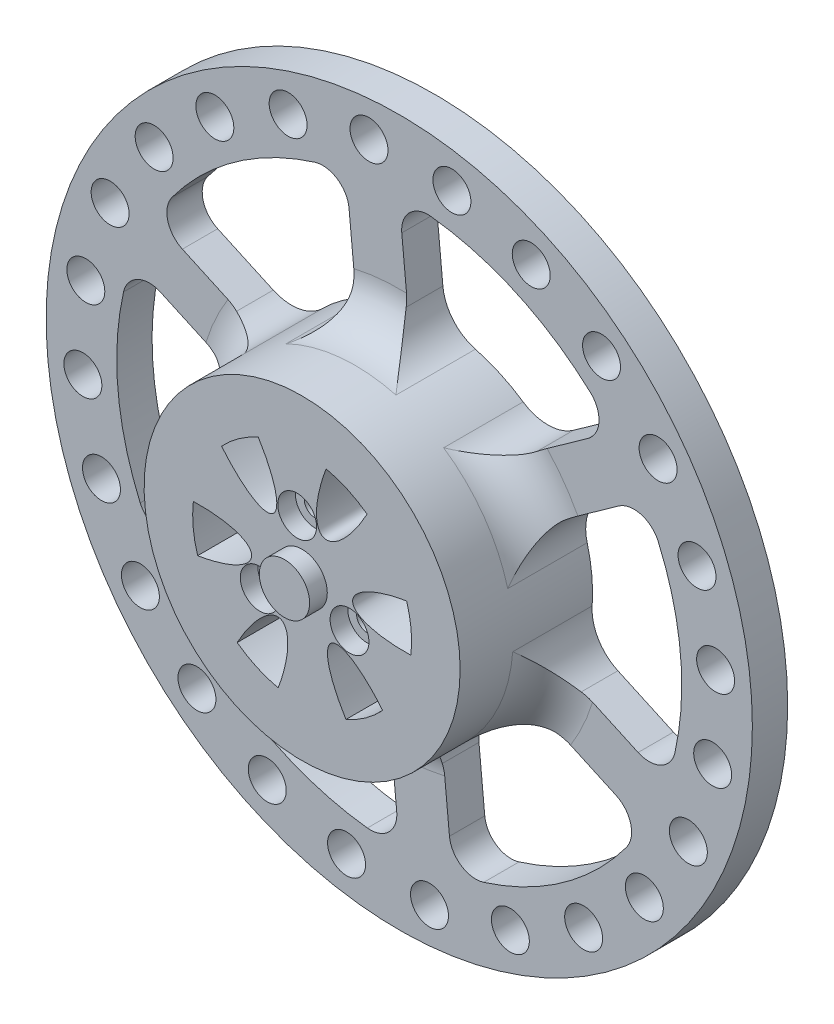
ISO-10303-21;
HEADER;
FILE_DESCRIPTION(('STEP AP214'),'2;1');
FILE_NAME('part.step','',(''),(''),'','','');
FILE_SCHEMA(('AUTOMOTIVE_DESIGN { 1 0 10303 214 1 1 1 1 }'));
ENDSEC;
DATA;
#1=APPLICATION_CONTEXT('core data for automotive mechanical design processes');
#2=APPLICATION_PROTOCOL_DEFINITION('international standard','automotive_design',2000,#1);
#3=PRODUCT_CONTEXT('',#1,'mechanical');
#4=PRODUCT('Part','Part','',(#3));
#5=PRODUCT_RELATED_PRODUCT_CATEGORY('part','',(#4));
#6=PRODUCT_DEFINITION_FORMATION('','',#4);
#7=PRODUCT_DEFINITION_CONTEXT('part definition',#1,'design');
#8=PRODUCT_DEFINITION('design','',#6,#7);
#9=PRODUCT_DEFINITION_SHAPE('','',#8);
#10=(LENGTH_UNIT() NAMED_UNIT(*) SI_UNIT(.MILLI.,.METRE.));
#11=(NAMED_UNIT(*) PLANE_ANGLE_UNIT() SI_UNIT($,.RADIAN.));
#12=(NAMED_UNIT(*) SI_UNIT($,.STERADIAN.) SOLID_ANGLE_UNIT());
#13=UNCERTAINTY_MEASURE_WITH_UNIT(LENGTH_MEASURE(1.E-05),#10,'distance_accuracy_value','');
#14=(GEOMETRIC_REPRESENTATION_CONTEXT(3) GLOBAL_UNCERTAINTY_ASSIGNED_CONTEXT((#13)) GLOBAL_UNIT_ASSIGNED_CONTEXT((#10,
#11,#12)) REPRESENTATION_CONTEXT('',''));
#15=CARTESIAN_POINT('',(0.,0.,0.));
#16=DIRECTION('',(0.,0.,1.));
#17=DIRECTION('',(1.,0.,0.));
#18=AXIS2_PLACEMENT_3D('',#15,#16,#17);
#19=CARTESIAN_POINT('',(0.,0.,0.));
#20=DIRECTION('',(0.,0.,1.));
#21=DIRECTION('',(1.,0.,0.));
#22=AXIS2_PLACEMENT_3D('',#19,#20,#21);
#23=PLANE('',#22);
#24=CARTESIAN_POINT('',(-3.42750330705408,35.8364649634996,0.));
#25=DIRECTION('',(0.,0.,-1.));
#26=DIRECTION('',(-1.,0.,0.));
#27=AXIS2_PLACEMENT_3D('',#24,#25,#26);
#28=CIRCLE('',#27,2.15);
#29=CARTESIAN_POINT('',(-5.57750330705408,35.8364649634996,0.));
#30=VERTEX_POINT('',#29);
#31=EDGE_CURVE('E1162',#30,#30,#28,.T.);
#32=ORIENTED_EDGE('',*,*,#31,.F.);
#33=EDGE_LOOP('',(#32));
#34=FACE_BOUND('',#33,.T.);
#35=CARTESIAN_POINT('',(-12.585873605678,33.72826389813,0.));
#36=DIRECTION('',(0.,0.,-1.));
#37=DIRECTION('',(-1.,0.,0.));
#38=AXIS2_PLACEMENT_3D('',#35,#36,#37);
#39=CIRCLE('',#38,2.15);
#40=CARTESIAN_POINT('',(-14.7358736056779,33.72826389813,0.));
#41=VERTEX_POINT('',#40);
#42=EDGE_CURVE('E1157',#41,#41,#39,.T.);
#43=ORIENTED_EDGE('',*,*,#42,.F.);
#44=EDGE_LOOP('',(#43));
#45=FACE_BOUND('',#44,.T.);
#46=CARTESIAN_POINT('',(-20.8865374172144,29.3215373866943,0.));
#47=DIRECTION('',(0.,0.,-1.));
#48=DIRECTION('',(-1.,0.,0.));
#49=AXIS2_PLACEMENT_3D('',#46,#47,#48);
#50=CIRCLE('',#49,2.15);
#51=CARTESIAN_POINT('',(-23.0365374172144,29.3215373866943,0.));
#52=VERTEX_POINT('',#51);
#53=EDGE_CURVE('E1152',#52,#52,#50,.T.);
#54=ORIENTED_EDGE('',*,*,#53,.F.);
#55=EDGE_LOOP('',(#54));
#56=FACE_BOUND('',#55,.T.);
#57=CARTESIAN_POINT('',(-32.7490406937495,14.9499275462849,0.));
#58=DIRECTION('',(0.,0.,-1.));
#59=DIRECTION('',(-1.,0.,0.));
#60=AXIS2_PLACEMENT_3D('',#57,#58,#59);
#61=CIRCLE('',#60,2.15);
#62=CARTESIAN_POINT('',(-34.8990406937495,14.9499275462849,0.));
#63=VERTEX_POINT('',#62);
#64=EDGE_CURVE('E1142',#63,#63,#61,.T.);
#65=ORIENTED_EDGE('',*,*,#64,.F.);
#66=EDGE_LOOP('',(#65));
#67=FACE_BOUND('',#66,.T.);
#68=CARTESIAN_POINT('',(-35.502470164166,5.96444567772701,0.));
#69=DIRECTION('',(0.,0.,-1.));
#70=DIRECTION('',(-1.,0.,0.));
#71=AXIS2_PLACEMENT_3D('',#68,#69,#70);
#72=CIRCLE('',#71,2.15);
#73=CARTESIAN_POINT('',(-37.652470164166,5.96444567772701,0.));
#74=VERTEX_POINT('',#73);
#75=EDGE_CURVE('E1137',#74,#74,#72,.T.);
#76=ORIENTED_EDGE('',*,*,#75,.F.);
#77=EDGE_LOOP('',(#76));
#78=FACE_BOUND('',#77,.T.);
#79=CARTESIAN_POINT('',(-35.8364649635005,-3.42750330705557,0.));
#80=DIRECTION('',(0.,0.,-1.));
#81=DIRECTION('',(-1.,0.,0.));
#82=AXIS2_PLACEMENT_3D('',#79,#80,#81);
#83=CIRCLE('',#82,2.15);
#84=CARTESIAN_POINT('',(-37.9864649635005,-3.42750330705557,0.));
#85=VERTEX_POINT('',#84);
#86=EDGE_CURVE('E1132',#85,#85,#83,.T.);
#87=ORIENTED_EDGE('',*,*,#86,.F.);
#88=EDGE_LOOP('',(#87));
#89=FACE_BOUND('',#88,.T.);
#90=CARTESIAN_POINT('',(-33.7282638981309,-12.5858736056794,0.));
#91=DIRECTION('',(0.,0.,-1.));
#92=DIRECTION('',(-1.,0.,0.));
#93=AXIS2_PLACEMENT_3D('',#90,#91,#92);
#94=CIRCLE('',#93,2.15);
#95=CARTESIAN_POINT('',(-35.8782638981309,-12.5858736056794,0.));
#96=VERTEX_POINT('',#95);
#97=EDGE_CURVE('E1131',#96,#96,#94,.T.);
#98=ORIENTED_EDGE('',*,*,#97,.F.);
#99=EDGE_LOOP('',(#98));
#100=FACE_BOUND('',#99,.T.);
#101=CARTESIAN_POINT('',(-29.3215373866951,-20.8865374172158,0.));
#102=DIRECTION('',(0.,0.,-1.));
#103=DIRECTION('',(-1.,0.,0.));
#104=AXIS2_PLACEMENT_3D('',#101,#102,#103);
#105=CIRCLE('',#104,2.15);
#106=CARTESIAN_POINT('',(-31.4715373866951,-20.8865374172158,0.));
#107=VERTEX_POINT('',#106);
#108=EDGE_CURVE('E1126',#107,#107,#105,.T.);
#109=ORIENTED_EDGE('',*,*,#108,.F.);
#110=EDGE_LOOP('',(#109));
#111=FACE_BOUND('',#110,.T.);
#112=CARTESIAN_POINT('',(-22.9165965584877,-27.7638182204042,0.));
#113=DIRECTION('',(0.,0.,-1.));
#114=DIRECTION('',(-1.,0.,0.));
#115=AXIS2_PLACEMENT_3D('',#112,#113,#114);
#116=CIRCLE('',#115,2.15);
#117=CARTESIAN_POINT('',(-25.0665965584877,-27.7638182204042,0.));
#118=VERTEX_POINT('',#117);
#119=EDGE_CURVE('E1125',#118,#118,#116,.T.);
#120=ORIENTED_EDGE('',*,*,#119,.F.);
#121=EDGE_LOOP('',(#120));
#122=FACE_BOUND('',#121,.T.);
#123=CARTESIAN_POINT('',(-14.9499275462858,-32.749040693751,0.));
#124=DIRECTION('',(0.,0.,-1.));
#125=DIRECTION('',(-1.,0.,0.));
#126=AXIS2_PLACEMENT_3D('',#123,#124,#125);
#127=CIRCLE('',#126,2.15);
#128=CARTESIAN_POINT('',(-17.0999275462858,-32.749040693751,0.));
#129=VERTEX_POINT('',#128);
#130=EDGE_CURVE('E1120',#129,#129,#127,.T.);
#131=ORIENTED_EDGE('',*,*,#130,.F.);
#132=EDGE_LOOP('',(#131));
#133=FACE_BOUND('',#132,.T.);
#134=CARTESIAN_POINT('',(-5.96444567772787,-35.5024701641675,0.));
#135=DIRECTION('',(0.,0.,-1.));
#136=DIRECTION('',(-1.,0.,0.));
#137=AXIS2_PLACEMENT_3D('',#134,#135,#136);
#138=CIRCLE('',#137,2.15);
#139=CARTESIAN_POINT('',(-8.11444567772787,-35.5024701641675,0.));
#140=VERTEX_POINT('',#139);
#141=EDGE_CURVE('E1115',#140,#140,#138,.T.);
#142=ORIENTED_EDGE('',*,*,#141,.F.);
#143=EDGE_LOOP('',(#142));
#144=FACE_BOUND('',#143,.T.);
#145=CARTESIAN_POINT('',(3.42750330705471,-35.836464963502,0.));
#146=DIRECTION('',(0.,0.,-1.));
#147=DIRECTION('',(-1.,0.,0.));
#148=AXIS2_PLACEMENT_3D('',#145,#146,#147);
#149=CIRCLE('',#148,2.15);
#150=CARTESIAN_POINT('',(1.27750330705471,-35.836464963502,0.));
#151=VERTEX_POINT('',#150);
#152=EDGE_CURVE('E1110',#151,#151,#149,.T.);
#153=ORIENTED_EDGE('',*,*,#152,.F.);
#154=EDGE_LOOP('',(#153));
#155=FACE_BOUND('',#154,.T.);
#156=CARTESIAN_POINT('',(12.5858736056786,-33.7282638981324,0.));
#157=DIRECTION('',(0.,0.,-1.));
#158=DIRECTION('',(-1.,0.,0.));
#159=AXIS2_PLACEMENT_3D('',#156,#157,#158);
#160=CIRCLE('',#159,2.15);
#161=CARTESIAN_POINT('',(10.4358736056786,-33.7282638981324,0.));
#162=VERTEX_POINT('',#161);
#163=EDGE_CURVE('E1105',#162,#162,#160,.T.);
#164=ORIENTED_EDGE('',*,*,#163,.F.);
#165=EDGE_LOOP('',(#164));
#166=FACE_BOUND('',#165,.T.);
#167=CARTESIAN_POINT('',(20.886537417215,-29.3215373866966,0.));
#168=DIRECTION('',(0.,0.,-1.));
#169=DIRECTION('',(-1.,0.,0.));
#170=AXIS2_PLACEMENT_3D('',#167,#168,#169);
#171=CIRCLE('',#170,2.15);
#172=CARTESIAN_POINT('',(18.736537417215,-29.3215373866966,0.));
#173=VERTEX_POINT('',#172);
#174=EDGE_CURVE('E1104',#173,#173,#171,.T.);
#175=ORIENTED_EDGE('',*,*,#174,.F.);
#176=EDGE_LOOP('',(#175));
#177=FACE_BOUND('',#176,.T.);
#178=CARTESIAN_POINT('',(27.7638182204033,-22.9165965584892,0.));
#179=DIRECTION('',(0.,0.,-1.));
#180=DIRECTION('',(-1.,0.,0.));
#181=AXIS2_PLACEMENT_3D('',#178,#179,#180);
#182=CIRCLE('',#181,2.15);
#183=CARTESIAN_POINT('',(25.6138182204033,-22.9165965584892,0.));
#184=VERTEX_POINT('',#183);
#185=EDGE_CURVE('E1099',#184,#184,#182,.T.);
#186=ORIENTED_EDGE('',*,*,#185,.F.);
#187=EDGE_LOOP('',(#186));
#188=FACE_BOUND('',#187,.T.);
#189=CARTESIAN_POINT('',(32.7490406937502,-14.9499275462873,0.));
#190=DIRECTION('',(0.,0.,-1.));
#191=DIRECTION('',(-1.,0.,0.));
#192=AXIS2_PLACEMENT_3D('',#189,#190,#191);
#193=CIRCLE('',#192,2.15);
#194=CARTESIAN_POINT('',(30.5990406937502,-14.9499275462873,0.));
#195=VERTEX_POINT('',#194);
#196=EDGE_CURVE('E1094',#195,#195,#193,.T.);
#197=ORIENTED_EDGE('',*,*,#196,.F.);
#198=EDGE_LOOP('',(#197));
#199=FACE_BOUND('',#198,.T.);
#200=CARTESIAN_POINT('',(35.5024701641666,-5.96444567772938,0.));
#201=DIRECTION('',(0.,0.,-1.));
#202=DIRECTION('',(-1.,0.,0.));
#203=AXIS2_PLACEMENT_3D('',#200,#201,#202);
#204=CIRCLE('',#203,2.15);
#205=CARTESIAN_POINT('',(33.3524701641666,-5.96444567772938,0.));
#206=VERTEX_POINT('',#205);
#207=EDGE_CURVE('E1093',#206,#206,#204,.T.);
#208=ORIENTED_EDGE('',*,*,#207,.F.);
#209=EDGE_LOOP('',(#208));
#210=FACE_BOUND('',#209,.T.);
#211=CARTESIAN_POINT('',(35.8364649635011,3.42750330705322,0.));
#212=DIRECTION('',(0.,0.,-1.));
#213=DIRECTION('',(-1.,0.,0.));
#214=AXIS2_PLACEMENT_3D('',#211,#212,#213);
#215=CIRCLE('',#214,2.15);
#216=CARTESIAN_POINT('',(33.6864649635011,3.42750330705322,0.));
#217=VERTEX_POINT('',#216);
#218=EDGE_CURVE('E1088',#217,#217,#215,.T.);
#219=ORIENTED_EDGE('',*,*,#218,.F.);
#220=EDGE_LOOP('',(#219));
#221=FACE_BOUND('',#220,.T.);
#222=CARTESIAN_POINT('',(33.7282638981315,12.5858736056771,0.));
#223=DIRECTION('',(0.,0.,-1.));
#224=DIRECTION('',(-1.,0.,0.));
#225=AXIS2_PLACEMENT_3D('',#222,#223,#224);
#226=CIRCLE('',#225,2.15);
#227=CARTESIAN_POINT('',(31.5782638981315,12.5858736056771,0.));
#228=VERTEX_POINT('',#227);
#229=EDGE_CURVE('E1083',#228,#228,#226,.T.);
#230=ORIENTED_EDGE('',*,*,#229,.F.);
#231=EDGE_LOOP('',(#230));
#232=FACE_BOUND('',#231,.T.);
#233=CARTESIAN_POINT('',(29.3215373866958,20.8865374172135,0.));
#234=DIRECTION('',(0.,0.,-1.));
#235=DIRECTION('',(-1.,0.,0.));
#236=AXIS2_PLACEMENT_3D('',#233,#234,#235);
#237=CIRCLE('',#236,2.15);
#238=CARTESIAN_POINT('',(27.1715373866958,20.8865374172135,0.));
#239=VERTEX_POINT('',#238);
#240=EDGE_CURVE('E1078',#239,#239,#237,.T.);
#241=ORIENTED_EDGE('',*,*,#240,.F.);
#242=EDGE_LOOP('',(#241));
#243=FACE_BOUND('',#242,.T.);
#244=CARTESIAN_POINT('',(22.9165965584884,27.7638182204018,0.));
#245=DIRECTION('',(0.,0.,-1.));
#246=DIRECTION('',(-1.,0.,0.));
#247=AXIS2_PLACEMENT_3D('',#244,#245,#246);
#248=CIRCLE('',#247,2.15);
#249=CARTESIAN_POINT('',(20.7665965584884,27.7638182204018,0.));
#250=VERTEX_POINT('',#249);
#251=EDGE_CURVE('E1073',#250,#250,#248,.T.);
#252=ORIENTED_EDGE('',*,*,#251,.F.);
#253=EDGE_LOOP('',(#252));
#254=FACE_BOUND('',#253,.T.);
#255=CARTESIAN_POINT('',(14.9499275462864,32.7490406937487,0.));
#256=DIRECTION('',(0.,0.,-1.));
#257=DIRECTION('',(-1.,0.,0.));
#258=AXIS2_PLACEMENT_3D('',#255,#256,#257);
#259=CIRCLE('',#258,2.15);
#260=CARTESIAN_POINT('',(12.7999275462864,32.7490406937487,0.));
#261=VERTEX_POINT('',#260);
#262=EDGE_CURVE('E1068',#261,#261,#259,.T.);
#263=ORIENTED_EDGE('',*,*,#262,.F.);
#264=EDGE_LOOP('',(#263));
#265=FACE_BOUND('',#264,.T.);
#266=CARTESIAN_POINT('',(5.96444567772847,35.5024701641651,0.));
#267=DIRECTION('',(0.,0.,-1.));
#268=DIRECTION('',(-1.,0.,0.));
#269=AXIS2_PLACEMENT_3D('',#266,#267,#268);
#270=CIRCLE('',#269,2.15);
#271=CARTESIAN_POINT('',(3.81444567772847,35.5024701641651,0.));
#272=VERTEX_POINT('',#271);
#273=EDGE_CURVE('E1063',#272,#272,#270,.T.);
#274=ORIENTED_EDGE('',*,*,#273,.F.);
#275=EDGE_LOOP('',(#274));
#276=FACE_BOUND('',#275,.T.);
#277=DIRECTION('',(0.814487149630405,0.580181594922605,0.));
#278=VECTOR('',#277,1.);
#279=CARTESIAN_POINT('',(1.74054478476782,-2.44346144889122,0.));
#280=LINE('',#279,#278);
#281=CARTESIAN_POINT('',(19.2171312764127,10.005591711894,0.));
#282=VERTEX_POINT('',#281);
#283=CARTESIAN_POINT('',(24.8495992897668,14.0177535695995,0.));
#284=VERTEX_POINT('',#283);
#285=EDGE_CURVE('E1610',#282,#284,#280,.T.);
#286=ORIENTED_EDGE('',*,*,#285,.F.);
#287=CARTESIAN_POINT('',(22.1180392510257,5.93315596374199,0.));
#288=DIRECTION('',(0.,0.,1.));
#289=DIRECTION('',(1.,0.,0.));
#290=AXIS2_PLACEMENT_3D('',#287,#288,#289);
#291=CIRCLE('',#290,5.);
#292=CARTESIAN_POINT('',(17.2887730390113,4.63770706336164,0.));
#293=VERTEX_POINT('',#292);
#294=EDGE_CURVE('E1866',#282,#293,#291,.T.);
#295=ORIENTED_EDGE('',*,*,#294,.T.);
#296=CARTESIAN_POINT('',(0.,0.,0.));
#297=DIRECTION('',(0.,0.,-1.));
#298=DIRECTION('',(-1.,0.,0.));
#299=AXIS2_PLACEMENT_3D('',#296,#297,#298);
#300=CIRCLE('',#299,17.9);
#301=CARTESIAN_POINT('',(17.8544258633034,-1.27650973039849,0.));
#302=VERTEX_POINT('',#301);
#303=EDGE_CURVE('E1613',#293,#302,#300,.T.);
#304=ORIENTED_EDGE('',*,*,#303,.T.);
#305=CARTESIAN_POINT('',(22.8416956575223,-1.63307669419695,0.));
#306=DIRECTION('',(0.,0.,1.));
#307=DIRECTION('',(1.,0.,0.));
#308=AXIS2_PLACEMENT_3D('',#305,#306,#307);
#309=CIRCLE('',#308,5.);
#310=CARTESIAN_POINT('',(20.7653168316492,-6.18155456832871,0.));
#311=VERTEX_POINT('',#310);
#312=EDGE_CURVE('E1872',#302,#311,#309,.T.);
#313=ORIENTED_EDGE('',*,*,#312,.T.);
#314=DIRECTION('',(0.909695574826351,-0.415275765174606,0.));
#315=VECTOR('',#314,1.);
#316=CARTESIAN_POINT('',(1.24582729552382,2.72908672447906,0.));
#317=LINE('',#316,#315);
#318=CARTESIAN_POINT('',(27.0561849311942,-9.05333402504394,0.));
#319=VERTEX_POINT('',#318);
#320=EDGE_CURVE('E1579',#311,#319,#317,.T.);
#321=ORIENTED_EDGE('',*,*,#320,.T.);
#322=CARTESIAN_POINT('',(28.3020122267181,-6.32424730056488,0.));
#323=DIRECTION('',(0.,0.,1.));
#324=DIRECTION('',(1.,0.,0.));
#325=AXIS2_PLACEMENT_3D('',#322,#323,#324);
#326=CIRCLE('',#325,3.);
#327=CARTESIAN_POINT('',(31.2298065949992,-6.97847977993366,0.));
#328=VERTEX_POINT('',#327);
#329=EDGE_CURVE('E1292',#319,#328,#326,.T.);
#330=ORIENTED_EDGE('',*,*,#329,.T.);
#331=CARTESIAN_POINT('',(0.,0.,0.));
#332=DIRECTION('',(0.,0.,-1.));
#333=DIRECTION('',(-1.,0.,0.));
#334=AXIS2_PLACEMENT_3D('',#331,#332,#333);
#335=CIRCLE('',#334,32.);
#336=CARTESIAN_POINT('',(29.3408486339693,12.7716326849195,0.));
#337=VERTEX_POINT('',#336);
#338=EDGE_CURVE('E1606',#337,#328,#335,.T.);
#339=ORIENTED_EDGE('',*,*,#338,.F.);
#340=CARTESIAN_POINT('',(26.5901440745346,11.5742921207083,0.));
#341=DIRECTION('',(0.,0.,1.));
#342=DIRECTION('',(1.,0.,0.));
#343=AXIS2_PLACEMENT_3D('',#340,#341,#342);
#344=CIRCLE('',#343,3.);
#345=EDGE_CURVE('E1298',#337,#284,#344,.T.);
#346=ORIENTED_EDGE('',*,*,#345,.T.);
#347=EDGE_LOOP('',(#286,#295,#304,#313,#321,#330,#339,#346));
#348=FACE_BOUND('',#347,.T.);
#349=DIRECTION('',(0.0952084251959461,-0.995457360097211,0.));
#350=VECTOR('',#349,1.);
#351=CARTESIAN_POINT('',(-2.98637208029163,-0.285625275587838,0.));
#352=LINE('',#351,#350);
#353=CARTESIAN_POINT('',(-0.943469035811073,-21.6453197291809,0.));
#354=VERTEX_POINT('',#353);
#355=CARTESIAN_POINT('',(-0.285068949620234,-28.5292610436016,0.));
#356=VERTEX_POINT('',#355);
#357=EDGE_CURVE('E1588',#354,#356,#352,.T.);
#358=ORIENTED_EDGE('',*,*,#357,.F.);
#359=CARTESIAN_POINT('',(-5.92075583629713,-22.1213618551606,0.));
#360=DIRECTION('',(0.,0.,1.));
#361=DIRECTION('',(1.,0.,0.));
#362=AXIS2_PLACEMENT_3D('',#359,#360,#361);
#363=CIRCLE('',#362,5.);
#364=CARTESIAN_POINT('',(-4.62801438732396,-17.2913701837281,0.));
#365=VERTEX_POINT('',#364);
#366=EDGE_CURVE('E1881',#354,#365,#363,.T.);
#367=ORIENTED_EDGE('',*,*,#366,.T.);
#368=CARTESIAN_POINT('',(0.,0.,0.));
#369=DIRECTION('',(0.,0.,-1.));
#370=DIRECTION('',(-1.,0.,0.));
#371=AXIS2_PLACEMENT_3D('',#368,#369,#370);
#372=CIRCLE('',#371,17.9);
#373=CARTESIAN_POINT('',(-10.0327027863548,-14.8241315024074,0.));
#374=VERTEX_POINT('',#373);
#375=EDGE_CURVE('E1591',#365,#374,#372,.T.);
#376=ORIENTED_EDGE('',*,*,#375,.T.);
#377=CARTESIAN_POINT('',(-12.835133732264,-18.9649503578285,0.));
#378=DIRECTION('',(0.,0.,1.));
#379=DIRECTION('',(1.,0.,0.));
#380=AXIS2_PLACEMENT_3D('',#377,#378,#379);
#381=CIRCLE('',#380,5.);
#382=CARTESIAN_POINT('',(-15.736041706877,-14.8925146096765,0.));
#383=VERTEX_POINT('',#382);
#384=EDGE_CURVE('E1878',#374,#383,#381,.T.);
#385=ORIENTED_EDGE('',*,*,#384,.T.);
#386=DIRECTION('',(-0.814487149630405,-0.580181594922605,0.));
#387=VECTOR('',#386,1.);
#388=CARTESIAN_POINT('',(1.74054478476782,-2.44346144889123,0.));
#389=LINE('',#388,#387);
#390=CARTESIAN_POINT('',(-21.3685097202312,-18.904676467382,0.));
#391=VERTEX_POINT('',#390);
#392=EDGE_CURVE('E1580',#383,#391,#389,.T.);
#393=ORIENTED_EDGE('',*,*,#392,.T.);
#394=CARTESIAN_POINT('',(-19.6279649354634,-21.3481379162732,0.));
#395=DIRECTION('',(0.,0.,1.));
#396=DIRECTION('',(1.,0.,0.));
#397=AXIS2_PLACEMENT_3D('',#394,#395,#396);
#398=CIRCLE('',#397,3.);
#399=CARTESIAN_POINT('',(-21.6584440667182,-23.5565659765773,0.));
#400=VERTEX_POINT('',#399);
#401=EDGE_CURVE('E1266',#391,#400,#398,.T.);
#402=ORIENTED_EDGE('',*,*,#401,.T.);
#403=CARTESIAN_POINT('',(0.,0.,0.));
#404=DIRECTION('',(0.,0.,-1.));
#405=DIRECTION('',(-1.,0.,0.));
#406=AXIS2_PLACEMENT_3D('',#403,#404,#405);
#407=CIRCLE('',#406,32.);
#408=CARTESIAN_POINT('',(-3.60986596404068,-31.7957366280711,0.));
#409=VERTEX_POINT('',#408);
#410=EDGE_CURVE('E1584',#409,#400,#407,.T.);
#411=ORIENTED_EDGE('',*,*,#410,.F.);
#412=CARTESIAN_POINT('',(-3.27144102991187,-28.8148863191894,0.));
#413=DIRECTION('',(0.,0.,1.));
#414=DIRECTION('',(1.,0.,0.));
#415=AXIS2_PLACEMENT_3D('',#412,#413,#414);
#416=CIRCLE('',#415,3.);
#417=EDGE_CURVE('E1272',#409,#356,#416,.T.);
#418=ORIENTED_EDGE('',*,*,#417,.T.);
#419=EDGE_LOOP('',(#358,#367,#376,#385,#393,#402,#411,#418));
#420=FACE_BOUND('',#419,.T.);
#421=DIRECTION('',(-0.0952084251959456,0.995457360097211,0.));
#422=VECTOR('',#421,1.);
#423=CARTESIAN_POINT('',(2.98637208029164,0.285625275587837,0.));
#424=LINE('',#423,#422);
#425=CARTESIAN_POINT('',(0.943469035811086,21.6453197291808,0.));
#426=VERTEX_POINT('',#425);
#427=CARTESIAN_POINT('',(0.28506894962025,28.5292610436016,0.));
#428=VERTEX_POINT('',#427);
#429=EDGE_CURVE('E1572',#426,#428,#424,.T.);
#430=ORIENTED_EDGE('',*,*,#429,.F.);
#431=CARTESIAN_POINT('',(5.92075583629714,22.1213618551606,0.));
#432=DIRECTION('',(0.,0.,1.));
#433=DIRECTION('',(1.,0.,0.));
#434=AXIS2_PLACEMENT_3D('',#431,#432,#433);
#435=CIRCLE('',#434,5.);
#436=CARTESIAN_POINT('',(4.62801438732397,17.2913701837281,0.));
#437=VERTEX_POINT('',#436);
#438=EDGE_CURVE('E1863',#426,#437,#435,.T.);
#439=ORIENTED_EDGE('',*,*,#438,.T.);
#440=CARTESIAN_POINT('',(0.,0.,0.));
#441=DIRECTION('',(0.,0.,-1.));
#442=DIRECTION('',(-1.,0.,0.));
#443=AXIS2_PLACEMENT_3D('',#440,#441,#442);
#444=CIRCLE('',#443,17.9);
#445=CARTESIAN_POINT('',(10.0327027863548,14.8241315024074,0.));
#446=VERTEX_POINT('',#445);
#447=EDGE_CURVE('E1575',#437,#446,#444,.T.);
#448=ORIENTED_EDGE('',*,*,#447,.T.);
#449=CARTESIAN_POINT('',(12.835133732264,18.9649503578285,0.));
#450=DIRECTION('',(0.,0.,1.));
#451=DIRECTION('',(1.,0.,0.));
#452=AXIS2_PLACEMENT_3D('',#449,#450,#451);
#453=CIRCLE('',#452,5.);
#454=CARTESIAN_POINT('',(15.736041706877,14.8925146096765,0.));
#455=VERTEX_POINT('',#454);
#456=EDGE_CURVE('E1860',#446,#455,#453,.T.);
#457=ORIENTED_EDGE('',*,*,#456,.T.);
#458=DIRECTION('',(0.814487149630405,0.580181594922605,0.));
#459=VECTOR('',#458,1.);
#460=CARTESIAN_POINT('',(-1.74054478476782,2.44346144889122,0.));
#461=LINE('',#460,#459);
#462=CARTESIAN_POINT('',(21.3685097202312,18.904676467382,0.));
#463=VERTEX_POINT('',#462);
#464=EDGE_CURVE('E1565',#455,#463,#461,.T.);
#465=ORIENTED_EDGE('',*,*,#464,.T.);
#466=CARTESIAN_POINT('',(19.6279649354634,21.3481379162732,0.));
#467=DIRECTION('',(0.,0.,1.));
#468=DIRECTION('',(1.,0.,0.));
#469=AXIS2_PLACEMENT_3D('',#466,#467,#468);
#470=CIRCLE('',#469,3.);
#471=CARTESIAN_POINT('',(21.6584440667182,23.5565659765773,0.));
#472=VERTEX_POINT('',#471);
#473=EDGE_CURVE('E1305',#463,#472,#470,.T.);
#474=ORIENTED_EDGE('',*,*,#473,.T.);
#475=CARTESIAN_POINT('',(0.,0.,0.));
#476=DIRECTION('',(0.,0.,-1.));
#477=DIRECTION('',(-1.,0.,0.));
#478=AXIS2_PLACEMENT_3D('',#475,#476,#477);
#479=CIRCLE('',#478,32.);
#480=CARTESIAN_POINT('',(3.6098659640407,31.7957366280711,0.));
#481=VERTEX_POINT('',#480);
#482=EDGE_CURVE('E1568',#481,#472,#479,.T.);
#483=ORIENTED_EDGE('',*,*,#482,.F.);
#484=CARTESIAN_POINT('',(3.27144102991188,28.8148863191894,0.));
#485=DIRECTION('',(0.,0.,1.));
#486=DIRECTION('',(1.,0.,0.));
#487=AXIS2_PLACEMENT_3D('',#484,#485,#486);
#488=CIRCLE('',#487,3.);
#489=EDGE_CURVE('E1317',#481,#428,#488,.T.);
#490=ORIENTED_EDGE('',*,*,#489,.T.);
#491=EDGE_LOOP('',(#430,#439,#448,#457,#465,#474,#483,#490));
#492=FACE_BOUND('',#491,.T.);
#493=CARTESIAN_POINT('',(0.,0.,0.));
#494=DIRECTION('',(0.,0.,1.));
#495=DIRECTION('',(1.,0.,0.));
#496=AXIS2_PLACEMENT_3D('',#493,#494,#495);
#497=CIRCLE('',#496,14.05);
#498=CARTESIAN_POINT('',(-14.05,0.,0.));
#499=VERTEX_POINT('',#498);
#500=EDGE_CURVE('E940',#499,#499,#497,.T.);
#501=ORIENTED_EDGE('',*,*,#500,.T.);
#502=EDGE_LOOP('',(#501));
#503=FACE_BOUND('',#502,.T.);
#504=CARTESIAN_POINT('',(0.,0.,0.));
#505=DIRECTION('',(0.,0.,1.));
#506=DIRECTION('',(1.,0.,0.));
#507=AXIS2_PLACEMENT_3D('',#504,#505,#506);
#508=CIRCLE('',#507,40.);
#509=CARTESIAN_POINT('',(40.,0.,0.));
#510=VERTEX_POINT('',#509);
#511=EDGE_CURVE('E963',#510,#510,#508,.T.);
#512=ORIENTED_EDGE('',*,*,#511,.F.);
#513=EDGE_LOOP('',(#512));
#514=FACE_BOUND('',#513,.T.);
#515=DIRECTION('',(-0.909695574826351,0.415275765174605,0.));
#516=VECTOR('',#515,1.);
#517=CARTESIAN_POINT('',(1.24582729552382,2.72908672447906,0.));
#518=LINE('',#517,#516);
#519=CARTESIAN_POINT('',(-18.2736622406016,11.6397280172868,0.));
#520=VERTEX_POINT('',#519);
#521=CARTESIAN_POINT('',(-24.5645303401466,14.511507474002,0.));
#522=VERTEX_POINT('',#521);
#523=EDGE_CURVE('E1636',#520,#522,#518,.T.);
#524=ORIENTED_EDGE('',*,*,#523,.F.);
#525=CARTESIAN_POINT('',(-16.1972834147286,16.1882058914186,0.));
#526=DIRECTION('',(0.,0.,1.));
#527=DIRECTION('',(1.,0.,0.));
#528=AXIS2_PLACEMENT_3D('',#525,#526,#527);
#529=CIRCLE('',#528,5.);
#530=CARTESIAN_POINT('',(-12.6607586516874,12.6536631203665,0.));
#531=VERTEX_POINT('',#530);
#532=EDGE_CURVE('E1887',#520,#531,#529,.T.);
#533=ORIENTED_EDGE('',*,*,#532,.T.);
#534=CARTESIAN_POINT('',(0.,0.,0.));
#535=DIRECTION('',(0.,0.,-1.));
#536=DIRECTION('',(-1.,0.,0.));
#537=AXIS2_PLACEMENT_3D('',#534,#535,#536);
#538=CIRCLE('',#537,17.9);
#539=CARTESIAN_POINT('',(-7.8217230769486,16.1006412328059,0.));
#540=VERTEX_POINT('',#539);
#541=EDGE_CURVE('E1044',#531,#540,#538,.T.);
#542=ORIENTED_EDGE('',*,*,#541,.T.);
#543=CARTESIAN_POINT('',(-10.0065619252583,20.5980270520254,0.));
#544=DIRECTION('',(0.,0.,1.));
#545=DIRECTION('',(1.,0.,0.));
#546=AXIS2_PLACEMENT_3D('',#543,#544,#545);
#547=CIRCLE('',#546,5.);
#548=CARTESIAN_POINT('',(-5.02927512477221,21.0740691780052,0.));
#549=VERTEX_POINT('',#548);
#550=EDGE_CURVE('E1884',#540,#549,#547,.T.);
#551=ORIENTED_EDGE('',*,*,#550,.T.);
#552=DIRECTION('',(-0.0952084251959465,0.995457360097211,0.));
#553=VECTOR('',#552,1.);
#554=CARTESIAN_POINT('',(-2.98637208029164,-0.28562527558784,0.));
#555=LINE('',#554,#553);
#556=CARTESIAN_POINT('',(-5.68767521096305,27.9580104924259,0.));
#557=VERTEX_POINT('',#556);
#558=EDGE_CURVE('E1603',#549,#557,#555,.T.);
#559=ORIENTED_EDGE('',*,*,#558,.T.);
#560=CARTESIAN_POINT('',(-8.67404729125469,27.6723852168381,0.));
#561=DIRECTION('',(0.,0.,1.));
#562=DIRECTION('',(1.,0.,0.));
#563=AXIS2_PLACEMENT_3D('',#560,#561,#562);
#564=CIRCLE('',#563,3.);
#565=CARTESIAN_POINT('',(-9.57136252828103,30.535045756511,0.));
#566=VERTEX_POINT('',#565);
#567=EDGE_CURVE('E1311',#557,#566,#564,.T.);
#568=ORIENTED_EDGE('',*,*,#567,.T.);
#569=CARTESIAN_POINT('',(0.,0.,0.));
#570=DIRECTION('',(0.,0.,-1.));
#571=DIRECTION('',(-1.,0.,0.));
#572=AXIS2_PLACEMENT_3D('',#569,#570,#571);
#573=CIRCLE('',#572,32.);
#574=CARTESIAN_POINT('',(-25.7309826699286,19.0241039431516,0.));
#575=VERTEX_POINT('',#574);
#576=EDGE_CURVE('E1632',#575,#566,#573,.T.);
#577=ORIENTED_EDGE('',*,*,#576,.F.);
#578=CARTESIAN_POINT('',(-23.3187030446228,17.2405941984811,0.));
#579=DIRECTION('',(0.,0.,1.));
#580=DIRECTION('',(1.,0.,0.));
#581=AXIS2_PLACEMENT_3D('',#578,#579,#580);
#582=CIRCLE('',#581,3.);
#583=EDGE_CURVE('E1246',#575,#522,#582,.T.);
#584=ORIENTED_EDGE('',*,*,#583,.T.);
#585=EDGE_LOOP('',(#524,#533,#542,#551,#559,#568,#577,#584));
#586=FACE_BOUND('',#585,.T.);
#587=DIRECTION('',(-0.814487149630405,-0.580181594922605,0.));
#588=VECTOR('',#587,1.);
#589=CARTESIAN_POINT('',(-1.74054478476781,2.44346144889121,0.));
#590=LINE('',#589,#588);
#591=CARTESIAN_POINT('',(-19.2171312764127,-10.005591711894,0.));
#592=VERTEX_POINT('',#591);
#593=CARTESIAN_POINT('',(-24.8495992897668,-14.0177535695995,0.));
#594=VERTEX_POINT('',#593);
#595=EDGE_CURVE('E1499',#592,#594,#590,.T.);
#596=ORIENTED_EDGE('',*,*,#595,.F.);
#597=CARTESIAN_POINT('',(-22.1180392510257,-5.933155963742,0.));
#598=DIRECTION('',(0.,0.,1.));
#599=DIRECTION('',(1.,0.,0.));
#600=AXIS2_PLACEMENT_3D('',#597,#598,#599);
#601=CIRCLE('',#600,5.);
#602=CARTESIAN_POINT('',(-17.2887730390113,-4.63770706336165,0.));
#603=VERTEX_POINT('',#602);
#604=EDGE_CURVE('E158',#592,#603,#601,.T.);
#605=ORIENTED_EDGE('',*,*,#604,.T.);
#606=CARTESIAN_POINT('',(0.,0.,0.));
#607=DIRECTION('',(0.,0.,-1.));
#608=DIRECTION('',(-1.,0.,0.));
#609=AXIS2_PLACEMENT_3D('',#606,#607,#608);
#610=CIRCLE('',#609,17.9);
#611=CARTESIAN_POINT('',(-17.8544258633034,1.27650973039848,0.));
#612=VERTEX_POINT('',#611);
#613=EDGE_CURVE('E1599',#603,#612,#610,.T.);
#614=ORIENTED_EDGE('',*,*,#613,.T.);
#615=CARTESIAN_POINT('',(-22.8416956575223,1.63307669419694,0.));
#616=DIRECTION('',(0.,0.,1.));
#617=DIRECTION('',(1.,0.,0.));
#618=AXIS2_PLACEMENT_3D('',#615,#616,#617);
#619=CIRCLE('',#618,5.);
#620=CARTESIAN_POINT('',(-20.7653168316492,6.1815545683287,0.));
#621=VERTEX_POINT('',#620);
#622=EDGE_CURVE('E15',#612,#621,#619,.T.);
#623=ORIENTED_EDGE('',*,*,#622,.T.);
#624=DIRECTION('',(-0.909695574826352,0.415275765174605,0.));
#625=VECTOR('',#624,1.);
#626=CARTESIAN_POINT('',(-1.24582729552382,-2.72908672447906,0.));
#627=LINE('',#626,#625);
#628=CARTESIAN_POINT('',(-27.0561849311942,9.05333402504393,0.));
#629=VERTEX_POINT('',#628);
#630=EDGE_CURVE('E1443',#621,#629,#627,.T.);
#631=ORIENTED_EDGE('',*,*,#630,.T.);
#632=CARTESIAN_POINT('',(-28.3020122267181,6.32424730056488,0.));
#633=DIRECTION('',(0.,0.,1.));
#634=DIRECTION('',(1.,0.,0.));
#635=AXIS2_PLACEMENT_3D('',#632,#633,#634);
#636=CIRCLE('',#635,3.);
#637=CARTESIAN_POINT('',(-31.2298065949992,6.97847977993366,0.));
#638=VERTEX_POINT('',#637);
#639=EDGE_CURVE('E1253',#629,#638,#636,.T.);
#640=ORIENTED_EDGE('',*,*,#639,.T.);
#641=CARTESIAN_POINT('',(0.,0.,0.));
#642=DIRECTION('',(0.,0.,-1.));
#643=DIRECTION('',(-1.,0.,0.));
#644=AXIS2_PLACEMENT_3D('',#641,#642,#643);
#645=CIRCLE('',#644,32.);
#646=CARTESIAN_POINT('',(-29.3408486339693,-12.7716326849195,0.));
#647=VERTEX_POINT('',#646);
#648=EDGE_CURVE('E1493',#647,#638,#645,.T.);
#649=ORIENTED_EDGE('',*,*,#648,.F.);
#650=CARTESIAN_POINT('',(-26.5901440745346,-11.5742921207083,0.));
#651=DIRECTION('',(0.,0.,1.));
#652=DIRECTION('',(1.,0.,0.));
#653=AXIS2_PLACEMENT_3D('',#650,#651,#652);
#654=CIRCLE('',#653,3.);
#655=EDGE_CURVE('E1259',#647,#594,#654,.T.);
#656=ORIENTED_EDGE('',*,*,#655,.T.);
#657=EDGE_LOOP('',(#596,#605,#614,#623,#631,#640,#649,#656));
#658=FACE_BOUND('',#657,.T.);
#659=DIRECTION('',(0.909695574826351,-0.415275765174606,0.));
#660=VECTOR('',#659,1.);
#661=CARTESIAN_POINT('',(-1.24582729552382,-2.72908672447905,0.));
#662=LINE('',#661,#660);
#663=CARTESIAN_POINT('',(18.2736622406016,-11.6397280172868,0.));
#664=VERTEX_POINT('',#663);
#665=CARTESIAN_POINT('',(24.5645303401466,-14.5115074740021,0.));
#666=VERTEX_POINT('',#665);
#667=EDGE_CURVE('E1624',#664,#666,#662,.T.);
#668=ORIENTED_EDGE('',*,*,#667,.F.);
#669=CARTESIAN_POINT('',(16.1972834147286,-16.1882058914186,0.));
#670=DIRECTION('',(0.,0.,1.));
#671=DIRECTION('',(1.,0.,0.));
#672=AXIS2_PLACEMENT_3D('',#669,#670,#671);
#673=CIRCLE('',#672,5.);
#674=CARTESIAN_POINT('',(12.6607586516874,-12.6536631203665,0.));
#675=VERTEX_POINT('',#674);
#676=EDGE_CURVE('E1869',#664,#675,#673,.T.);
#677=ORIENTED_EDGE('',*,*,#676,.T.);
#678=CARTESIAN_POINT('',(0.,0.,0.));
#679=DIRECTION('',(0.,0.,-1.));
#680=DIRECTION('',(-1.,0.,0.));
#681=AXIS2_PLACEMENT_3D('',#678,#679,#680);
#682=CIRCLE('',#681,17.9);
#683=CARTESIAN_POINT('',(7.8217230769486,-16.1006412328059,0.));
#684=VERTEX_POINT('',#683);
#685=EDGE_CURVE('E1583',#675,#684,#682,.T.);
#686=ORIENTED_EDGE('',*,*,#685,.T.);
#687=CARTESIAN_POINT('',(10.0065619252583,-20.5980270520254,0.));
#688=DIRECTION('',(0.,0.,1.));
#689=DIRECTION('',(1.,0.,0.));
#690=AXIS2_PLACEMENT_3D('',#687,#688,#689);
#691=CIRCLE('',#690,5.);
#692=CARTESIAN_POINT('',(5.02927512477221,-21.0740691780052,0.));
#693=VERTEX_POINT('',#692);
#694=EDGE_CURVE('E1875',#684,#693,#691,.T.);
#695=ORIENTED_EDGE('',*,*,#694,.T.);
#696=DIRECTION('',(0.0952084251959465,-0.995457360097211,0.));
#697=VECTOR('',#696,1.);
#698=CARTESIAN_POINT('',(2.98637208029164,0.28562527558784,0.));
#699=LINE('',#698,#697);
#700=CARTESIAN_POINT('',(5.68767521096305,-27.9580104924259,0.));
#701=VERTEX_POINT('',#700);
#702=EDGE_CURVE('E1617',#693,#701,#699,.T.);
#703=ORIENTED_EDGE('',*,*,#702,.T.);
#704=CARTESIAN_POINT('',(8.67404729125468,-27.6723852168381,0.));
#705=DIRECTION('',(0.,0.,1.));
#706=DIRECTION('',(1.,0.,0.));
#707=AXIS2_PLACEMENT_3D('',#704,#705,#706);
#708=CIRCLE('',#707,3.);
#709=CARTESIAN_POINT('',(9.57136252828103,-30.535045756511,0.));
#710=VERTEX_POINT('',#709);
#711=EDGE_CURVE('E1279',#701,#710,#708,.T.);
#712=ORIENTED_EDGE('',*,*,#711,.T.);
#713=CARTESIAN_POINT('',(0.,0.,0.));
#714=DIRECTION('',(0.,0.,-1.));
#715=DIRECTION('',(-1.,0.,0.));
#716=AXIS2_PLACEMENT_3D('',#713,#714,#715);
#717=CIRCLE('',#716,32.);
#718=CARTESIAN_POINT('',(25.7309826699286,-19.0241039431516,0.));
#719=VERTEX_POINT('',#718);
#720=EDGE_CURVE('E1620',#719,#710,#717,.T.);
#721=ORIENTED_EDGE('',*,*,#720,.F.);
#722=CARTESIAN_POINT('',(23.3187030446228,-17.2405941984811,0.));
#723=DIRECTION('',(0.,0.,1.));
#724=DIRECTION('',(1.,0.,0.));
#725=AXIS2_PLACEMENT_3D('',#722,#723,#724);
#726=CIRCLE('',#725,3.);
#727=EDGE_CURVE('E1285',#719,#666,#726,.T.);
#728=ORIENTED_EDGE('',*,*,#727,.T.);
#729=EDGE_LOOP('',(#668,#677,#686,#695,#703,#712,#721,#728));
#730=FACE_BOUND('',#729,.T.);
#731=CARTESIAN_POINT('',(-27.7638182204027,22.9165965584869,0.));
#732=DIRECTION('',(0.,0.,-1.));
#733=DIRECTION('',(-1.,0.,0.));
#734=AXIS2_PLACEMENT_3D('',#731,#732,#733);
#735=CIRCLE('',#734,2.15);
#736=CARTESIAN_POINT('',(-29.9138182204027,22.9165965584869,0.));
#737=VERTEX_POINT('',#736);
#738=EDGE_CURVE('E1147',#737,#737,#735,.T.);
#739=ORIENTED_EDGE('',*,*,#738,.F.);
#740=EDGE_LOOP('',(#739));
#741=FACE_BOUND('',#740,.T.);
#742=ADVANCED_FACE('F148',(#34,#45,#56,#67,#78,#89,#100,#111,#122,#133,#144,#155,#166,#177,#188,
#199,#210,#221,#232,#243,#254,#265,#276,#348,#420,#492,#503,#514,#586,#658,#730,#741),#23,.F.);
#743=CARTESIAN_POINT('',(0.,0.,4.));
#744=DIRECTION('',(0.,0.,1.));
#745=DIRECTION('',(1.,0.,0.));
#746=AXIS2_PLACEMENT_3D('',#743,#744,#745);
#747=PLANE('',#746);
#748=CARTESIAN_POINT('',(-3.42750330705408,35.8364649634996,4.));
#749=DIRECTION('',(0.,0.,1.));
#750=DIRECTION('',(1.,0.,0.));
#751=AXIS2_PLACEMENT_3D('',#748,#749,#750);
#752=CIRCLE('',#751,2.15);
#753=CARTESIAN_POINT('',(-1.27750330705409,35.8364649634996,4.));
#754=VERTEX_POINT('',#753);
#755=EDGE_CURVE('E1158',#754,#754,#752,.T.);
#756=ORIENTED_EDGE('',*,*,#755,.F.);
#757=EDGE_LOOP('',(#756));
#758=FACE_BOUND('',#757,.T.);
#759=CARTESIAN_POINT('',(-12.585873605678,33.72826389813,4.));
#760=DIRECTION('',(0.,0.,1.));
#761=DIRECTION('',(1.,0.,0.));
#762=AXIS2_PLACEMENT_3D('',#759,#760,#761);
#763=CIRCLE('',#762,2.15);
#764=CARTESIAN_POINT('',(-10.435873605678,33.72826389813,4.));
#765=VERTEX_POINT('',#764);
#766=EDGE_CURVE('E1153',#765,#765,#763,.T.);
#767=ORIENTED_EDGE('',*,*,#766,.F.);
#768=EDGE_LOOP('',(#767));
#769=FACE_BOUND('',#768,.T.);
#770=CARTESIAN_POINT('',(-20.8865374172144,29.3215373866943,4.));
#771=DIRECTION('',(0.,0.,1.));
#772=DIRECTION('',(1.,0.,0.));
#773=AXIS2_PLACEMENT_3D('',#770,#771,#772);
#774=CIRCLE('',#773,2.15);
#775=CARTESIAN_POINT('',(-18.7365374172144,29.3215373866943,4.));
#776=VERTEX_POINT('',#775);
#777=EDGE_CURVE('E1148',#776,#776,#774,.T.);
#778=ORIENTED_EDGE('',*,*,#777,.F.);
#779=EDGE_LOOP('',(#778));
#780=FACE_BOUND('',#779,.T.);
#781=CARTESIAN_POINT('',(-27.7638182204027,22.9165965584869,4.));
#782=DIRECTION('',(0.,0.,1.));
#783=DIRECTION('',(1.,0.,0.));
#784=AXIS2_PLACEMENT_3D('',#781,#782,#783);
#785=CIRCLE('',#784,2.15);
#786=CARTESIAN_POINT('',(-25.6138182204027,22.9165965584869,4.));
#787=VERTEX_POINT('',#786);
#788=EDGE_CURVE('E1143',#787,#787,#785,.T.);
#789=ORIENTED_EDGE('',*,*,#788,.F.);
#790=EDGE_LOOP('',(#789));
#791=FACE_BOUND('',#790,.T.);
#792=CARTESIAN_POINT('',(-32.7490406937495,14.9499275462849,4.));
#793=DIRECTION('',(0.,0.,1.));
#794=DIRECTION('',(1.,0.,0.));
#795=AXIS2_PLACEMENT_3D('',#792,#793,#794);
#796=CIRCLE('',#795,2.15);
#797=CARTESIAN_POINT('',(-30.5990406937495,14.9499275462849,4.));
#798=VERTEX_POINT('',#797);
#799=EDGE_CURVE('E1138',#798,#798,#796,.T.);
#800=ORIENTED_EDGE('',*,*,#799,.F.);
#801=EDGE_LOOP('',(#800));
#802=FACE_BOUND('',#801,.T.);
#803=CARTESIAN_POINT('',(-35.502470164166,5.96444567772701,4.));
#804=DIRECTION('',(0.,0.,1.));
#805=DIRECTION('',(1.,0.,0.));
#806=AXIS2_PLACEMENT_3D('',#803,#804,#805);
#807=CIRCLE('',#806,2.15);
#808=CARTESIAN_POINT('',(-33.352470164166,5.96444567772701,4.));
#809=VERTEX_POINT('',#808);
#810=EDGE_CURVE('E1133',#809,#809,#807,.T.);
#811=ORIENTED_EDGE('',*,*,#810,.F.);
#812=EDGE_LOOP('',(#811));
#813=FACE_BOUND('',#812,.T.);
#814=CARTESIAN_POINT('',(-35.8364649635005,-3.42750330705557,4.));
#815=DIRECTION('',(0.,0.,1.));
#816=DIRECTION('',(1.,0.,0.));
#817=AXIS2_PLACEMENT_3D('',#814,#815,#816);
#818=CIRCLE('',#817,2.15);
#819=CARTESIAN_POINT('',(-33.6864649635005,-3.42750330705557,4.));
#820=VERTEX_POINT('',#819);
#821=EDGE_CURVE('E1127',#820,#820,#818,.T.);
#822=ORIENTED_EDGE('',*,*,#821,.F.);
#823=EDGE_LOOP('',(#822));
#824=FACE_BOUND('',#823,.T.);
#825=CARTESIAN_POINT('',(-33.7282638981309,-12.5858736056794,4.));
#826=DIRECTION('',(0.,0.,1.));
#827=DIRECTION('',(1.,0.,0.));
#828=AXIS2_PLACEMENT_3D('',#825,#826,#827);
#829=CIRCLE('',#828,2.15);
#830=CARTESIAN_POINT('',(-31.5782638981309,-12.5858736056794,4.));
#831=VERTEX_POINT('',#830);
#832=EDGE_CURVE('E1732',#831,#831,#829,.T.);
#833=ORIENTED_EDGE('',*,*,#832,.F.);
#834=EDGE_LOOP('',(#833));
#835=FACE_BOUND('',#834,.T.);
#836=CARTESIAN_POINT('',(-29.3215373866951,-20.8865374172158,4.));
#837=DIRECTION('',(0.,0.,1.));
#838=DIRECTION('',(1.,0.,0.));
#839=AXIS2_PLACEMENT_3D('',#836,#837,#838);
#840=CIRCLE('',#839,2.15);
#841=CARTESIAN_POINT('',(-27.1715373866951,-20.8865374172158,4.));
#842=VERTEX_POINT('',#841);
#843=EDGE_CURVE('E1121',#842,#842,#840,.T.);
#844=ORIENTED_EDGE('',*,*,#843,.F.);
#845=EDGE_LOOP('',(#844));
#846=FACE_BOUND('',#845,.T.);
#847=CARTESIAN_POINT('',(-22.9165965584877,-27.7638182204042,4.));
#848=DIRECTION('',(0.,0.,1.));
#849=DIRECTION('',(1.,0.,0.));
#850=AXIS2_PLACEMENT_3D('',#847,#848,#849);
#851=CIRCLE('',#850,2.15);
#852=CARTESIAN_POINT('',(-20.7665965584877,-27.7638182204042,4.));
#853=VERTEX_POINT('',#852);
#854=EDGE_CURVE('E1722',#853,#853,#851,.T.);
#855=ORIENTED_EDGE('',*,*,#854,.F.);
#856=EDGE_LOOP('',(#855));
#857=FACE_BOUND('',#856,.T.);
#858=CARTESIAN_POINT('',(-14.9499275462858,-32.749040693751,4.));
#859=DIRECTION('',(0.,0.,1.));
#860=DIRECTION('',(1.,0.,0.));
#861=AXIS2_PLACEMENT_3D('',#858,#859,#860);
#862=CIRCLE('',#861,2.15);
#863=CARTESIAN_POINT('',(-12.7999275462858,-32.749040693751,4.));
#864=VERTEX_POINT('',#863);
#865=EDGE_CURVE('E1116',#864,#864,#862,.T.);
#866=ORIENTED_EDGE('',*,*,#865,.F.);
#867=EDGE_LOOP('',(#866));
#868=FACE_BOUND('',#867,.T.);
#869=CARTESIAN_POINT('',(-5.96444567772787,-35.5024701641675,4.));
#870=DIRECTION('',(0.,0.,1.));
#871=DIRECTION('',(1.,0.,0.));
#872=AXIS2_PLACEMENT_3D('',#869,#870,#871);
#873=CIRCLE('',#872,2.15);
#874=CARTESIAN_POINT('',(-3.81444567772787,-35.5024701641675,4.));
#875=VERTEX_POINT('',#874);
#876=EDGE_CURVE('E1111',#875,#875,#873,.T.);
#877=ORIENTED_EDGE('',*,*,#876,.F.);
#878=EDGE_LOOP('',(#877));
#879=FACE_BOUND('',#878,.T.);
#880=CARTESIAN_POINT('',(3.42750330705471,-35.836464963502,4.));
#881=DIRECTION('',(0.,0.,1.));
#882=DIRECTION('',(1.,0.,0.));
#883=AXIS2_PLACEMENT_3D('',#880,#881,#882);
#884=CIRCLE('',#883,2.15);
#885=CARTESIAN_POINT('',(5.57750330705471,-35.836464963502,4.));
#886=VERTEX_POINT('',#885);
#887=EDGE_CURVE('E1106',#886,#886,#884,.T.);
#888=ORIENTED_EDGE('',*,*,#887,.F.);
#889=EDGE_LOOP('',(#888));
#890=FACE_BOUND('',#889,.T.);
#891=CARTESIAN_POINT('',(12.5858736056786,-33.7282638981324,4.));
#892=DIRECTION('',(0.,0.,1.));
#893=DIRECTION('',(1.,0.,0.));
#894=AXIS2_PLACEMENT_3D('',#891,#892,#893);
#895=CIRCLE('',#894,2.15);
#896=CARTESIAN_POINT('',(14.7358736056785,-33.7282638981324,4.));
#897=VERTEX_POINT('',#896);
#898=EDGE_CURVE('E1100',#897,#897,#895,.T.);
#899=ORIENTED_EDGE('',*,*,#898,.F.);
#900=EDGE_LOOP('',(#899));
#901=FACE_BOUND('',#900,.T.);
#902=CARTESIAN_POINT('',(20.886537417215,-29.3215373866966,4.));
#903=DIRECTION('',(0.,0.,1.));
#904=DIRECTION('',(1.,0.,0.));
#905=AXIS2_PLACEMENT_3D('',#902,#903,#904);
#906=CIRCLE('',#905,2.15);
#907=CARTESIAN_POINT('',(23.036537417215,-29.3215373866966,4.));
#908=VERTEX_POINT('',#907);
#909=EDGE_CURVE('E1703',#908,#908,#906,.T.);
#910=ORIENTED_EDGE('',*,*,#909,.F.);
#911=EDGE_LOOP('',(#910));
#912=FACE_BOUND('',#911,.T.);
#913=CARTESIAN_POINT('',(27.7638182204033,-22.9165965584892,4.));
#914=DIRECTION('',(0.,0.,1.));
#915=DIRECTION('',(1.,0.,0.));
#916=AXIS2_PLACEMENT_3D('',#913,#914,#915);
#917=CIRCLE('',#916,2.15);
#918=CARTESIAN_POINT('',(29.9138182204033,-22.9165965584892,4.));
#919=VERTEX_POINT('',#918);
#920=EDGE_CURVE('E1095',#919,#919,#917,.T.);
#921=ORIENTED_EDGE('',*,*,#920,.F.);
#922=EDGE_LOOP('',(#921));
#923=FACE_BOUND('',#922,.T.);
#924=CARTESIAN_POINT('',(32.7490406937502,-14.9499275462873,4.));
#925=DIRECTION('',(0.,0.,1.));
#926=DIRECTION('',(1.,0.,0.));
#927=AXIS2_PLACEMENT_3D('',#924,#925,#926);
#928=CIRCLE('',#927,2.15);
#929=CARTESIAN_POINT('',(34.8990406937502,-14.9499275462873,4.));
#930=VERTEX_POINT('',#929);
#931=EDGE_CURVE('E1089',#930,#930,#928,.T.);
#932=ORIENTED_EDGE('',*,*,#931,.F.);
#933=EDGE_LOOP('',(#932));
#934=FACE_BOUND('',#933,.T.);
#935=CARTESIAN_POINT('',(35.5024701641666,-5.96444567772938,4.));
#936=DIRECTION('',(0.,0.,1.));
#937=DIRECTION('',(1.,0.,0.));
#938=AXIS2_PLACEMENT_3D('',#935,#936,#937);
#939=CIRCLE('',#938,2.15);
#940=CARTESIAN_POINT('',(37.6524701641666,-5.96444567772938,4.));
#941=VERTEX_POINT('',#940);
#942=EDGE_CURVE('E1690',#941,#941,#939,.T.);
#943=ORIENTED_EDGE('',*,*,#942,.F.);
#944=EDGE_LOOP('',(#943));
#945=FACE_BOUND('',#944,.T.);
#946=CARTESIAN_POINT('',(35.8364649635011,3.42750330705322,4.));
#947=DIRECTION('',(0.,0.,1.));
#948=DIRECTION('',(1.,0.,0.));
#949=AXIS2_PLACEMENT_3D('',#946,#947,#948);
#950=CIRCLE('',#949,2.15);
#951=CARTESIAN_POINT('',(37.9864649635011,3.42750330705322,4.));
#952=VERTEX_POINT('',#951);
#953=EDGE_CURVE('E1084',#952,#952,#950,.T.);
#954=ORIENTED_EDGE('',*,*,#953,.F.);
#955=EDGE_LOOP('',(#954));
#956=FACE_BOUND('',#955,.T.);
#957=CARTESIAN_POINT('',(33.7282638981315,12.5858736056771,4.));
#958=DIRECTION('',(0.,0.,1.));
#959=DIRECTION('',(1.,0.,0.));
#960=AXIS2_PLACEMENT_3D('',#957,#958,#959);
#961=CIRCLE('',#960,2.15);
#962=CARTESIAN_POINT('',(35.8782638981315,12.5858736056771,4.));
#963=VERTEX_POINT('',#962);
#964=EDGE_CURVE('E1079',#963,#963,#961,.T.);
#965=ORIENTED_EDGE('',*,*,#964,.F.);
#966=EDGE_LOOP('',(#965));
#967=FACE_BOUND('',#966,.T.);
#968=CARTESIAN_POINT('',(29.3215373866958,20.8865374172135,4.));
#969=DIRECTION('',(0.,0.,1.));
#970=DIRECTION('',(1.,0.,0.));
#971=AXIS2_PLACEMENT_3D('',#968,#969,#970);
#972=CIRCLE('',#971,2.15);
#973=CARTESIAN_POINT('',(31.4715373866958,20.8865374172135,4.));
#974=VERTEX_POINT('',#973);
#975=EDGE_CURVE('E1074',#974,#974,#972,.T.);
#976=ORIENTED_EDGE('',*,*,#975,.F.);
#977=EDGE_LOOP('',(#976));
#978=FACE_BOUND('',#977,.T.);
#979=CARTESIAN_POINT('',(22.9165965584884,27.7638182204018,4.));
#980=DIRECTION('',(0.,0.,1.));
#981=DIRECTION('',(1.,0.,0.));
#982=AXIS2_PLACEMENT_3D('',#979,#980,#981);
#983=CIRCLE('',#982,2.15);
#984=CARTESIAN_POINT('',(25.0665965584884,27.7638182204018,4.));
#985=VERTEX_POINT('',#984);
#986=EDGE_CURVE('E1069',#985,#985,#983,.T.);
#987=ORIENTED_EDGE('',*,*,#986,.F.);
#988=EDGE_LOOP('',(#987));
#989=FACE_BOUND('',#988,.T.);
#990=CARTESIAN_POINT('',(14.9499275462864,32.7490406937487,4.));
#991=DIRECTION('',(0.,0.,1.));
#992=DIRECTION('',(1.,0.,0.));
#993=AXIS2_PLACEMENT_3D('',#990,#991,#992);
#994=CIRCLE('',#993,2.15);
#995=CARTESIAN_POINT('',(17.0999275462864,32.7490406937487,4.));
#996=VERTEX_POINT('',#995);
#997=EDGE_CURVE('E1064',#996,#996,#994,.T.);
#998=ORIENTED_EDGE('',*,*,#997,.F.);
#999=EDGE_LOOP('',(#998));
#1000=FACE_BOUND('',#999,.T.);
#1001=CARTESIAN_POINT('',(5.96444567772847,35.5024701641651,4.));
#1002=DIRECTION('',(0.,0.,1.));
#1003=DIRECTION('',(1.,0.,0.));
#1004=AXIS2_PLACEMENT_3D('',#1001,#1002,#1003);
#1005=CIRCLE('',#1004,2.15);
#1006=CARTESIAN_POINT('',(8.11444567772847,35.5024701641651,4.));
#1007=VERTEX_POINT('',#1006);
#1008=EDGE_CURVE('E1058',#1007,#1007,#1005,.T.);
#1009=ORIENTED_EDGE('',*,*,#1008,.F.);
#1010=EDGE_LOOP('',(#1009));
#1011=FACE_BOUND('',#1010,.T.);
#1012=CARTESIAN_POINT('',(0.,0.,4.));
#1013=DIRECTION('',(0.,0.,1.));
#1014=DIRECTION('',(1.,0.,0.));
#1015=AXIS2_PLACEMENT_3D('',#1012,#1013,#1014);
#1016=CIRCLE('',#1015,40.);
#1017=CARTESIAN_POINT('',(40.,0.,4.));
#1018=VERTEX_POINT('',#1017);
#1019=EDGE_CURVE('E957',#1018,#1018,#1016,.T.);
#1020=ORIENTED_EDGE('',*,*,#1019,.T.);
#1021=EDGE_LOOP('',(#1020));
#1022=FACE_BOUND('',#1021,.T.);
#1023=DIRECTION('',(0.814487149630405,0.580181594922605,0.));
#1024=VECTOR('',#1023,1.);
#1025=CARTESIAN_POINT('',(1.74054478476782,-2.44346144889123,4.));
#1026=LINE('',#1025,#1024);
#1027=CARTESIAN_POINT('',(-21.3685097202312,-18.904676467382,4.));
#1028=VERTEX_POINT('',#1027);
#1029=CARTESIAN_POINT('',(-16.7504662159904,-15.6151170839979,4.));
#1030=VERTEX_POINT('',#1029);
#1031=EDGE_CURVE('E1517',#1028,#1030,#1026,.T.);
#1032=ORIENTED_EDGE('',*,*,#1031,.T.);
#1033=CARTESIAN_POINT('',(0.,0.,4.));
#1034=DIRECTION('',(0.,0.,1.));
#1035=DIRECTION('',(1.,0.,0.));
#1036=AXIS2_PLACEMENT_3D('',#1033,#1034,#1035);
#1037=CIRCLE('',#1036,22.9);
#1038=CARTESIAN_POINT('',(-20.231555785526,-10.7281941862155,4.));
#1039=VERTEX_POINT('',#1038);
#1040=EDGE_CURVE('E1399',#1030,#1039,#1037,.F.);
#1041=ORIENTED_EDGE('',*,*,#1040,.T.);
#1042=DIRECTION('',(0.814487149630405,0.580181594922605,0.));
#1043=VECTOR('',#1042,1.);
#1044=CARTESIAN_POINT('',(-1.74054478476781,2.44346144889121,4.));
#1045=LINE('',#1044,#1043);
#1046=CARTESIAN_POINT('',(-24.8495992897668,-14.0177535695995,4.));
#1047=VERTEX_POINT('',#1046);
#1048=EDGE_CURVE('E1509',#1047,#1039,#1045,.T.);
#1049=ORIENTED_EDGE('',*,*,#1048,.F.);
#1050=CARTESIAN_POINT('',(-26.5901440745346,-11.5742921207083,4.));
#1051=DIRECTION('',(0.,0.,1.));
#1052=DIRECTION('',(1.,0.,0.));
#1053=AXIS2_PLACEMENT_3D('',#1050,#1051,#1052);
#1054=CIRCLE('',#1053,3.);
#1055=CARTESIAN_POINT('',(-29.3408486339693,-12.7716326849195,4.));
#1056=VERTEX_POINT('',#1055);
#1057=EDGE_CURVE('E1263',#1047,#1056,#1054,.F.);
#1058=ORIENTED_EDGE('',*,*,#1057,.T.);
#1059=CARTESIAN_POINT('',(0.,0.,4.));
#1060=DIRECTION('',(0.,0.,1.));
#1061=DIRECTION('',(1.,0.,0.));
#1062=AXIS2_PLACEMENT_3D('',#1059,#1060,#1061);
#1063=CIRCLE('',#1062,32.);
#1064=CARTESIAN_POINT('',(-31.2298065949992,6.97847977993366,4.));
#1065=VERTEX_POINT('',#1064);
#1066=EDGE_CURVE('E1027',#1065,#1056,#1063,.T.);
#1067=ORIENTED_EDGE('',*,*,#1066,.F.);
#1068=CARTESIAN_POINT('',(-28.3020122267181,6.32424730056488,4.));
#1069=DIRECTION('',(0.,0.,1.));
#1070=DIRECTION('',(1.,0.,0.));
#1071=AXIS2_PLACEMENT_3D('',#1068,#1069,#1070);
#1072=CIRCLE('',#1071,3.);
#1073=CARTESIAN_POINT('',(-27.0561849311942,9.05333402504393,4.));
#1074=VERTEX_POINT('',#1073);
#1075=EDGE_CURVE('E1256',#1065,#1074,#1072,.F.);
#1076=ORIENTED_EDGE('',*,*,#1075,.T.);
#1077=DIRECTION('',(0.909695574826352,-0.415275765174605,0.));
#1078=VECTOR('',#1077,1.);
#1079=CARTESIAN_POINT('',(-1.24582729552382,-2.72908672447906,4.));
#1080=LINE('',#1079,#1078);
#1081=CARTESIAN_POINT('',(-21.8983211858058,6.6987707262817,4.));
#1082=VERTEX_POINT('',#1081);
#1083=EDGE_CURVE('E1506',#1074,#1082,#1080,.T.);
#1084=ORIENTED_EDGE('',*,*,#1083,.T.);
#1085=CARTESIAN_POINT('',(0.,0.,4.));
#1086=DIRECTION('',(0.,0.,1.));
#1087=DIRECTION('',(1.,0.,0.));
#1088=AXIS2_PLACEMENT_3D('',#1085,#1086,#1087);
#1089=CIRCLE('',#1088,22.9);
#1090=CARTESIAN_POINT('',(-19.4066665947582,12.1569441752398,4.));
#1091=VERTEX_POINT('',#1090);
#1092=EDGE_CURVE('E1396',#1082,#1091,#1089,.F.);
#1093=ORIENTED_EDGE('',*,*,#1092,.T.);
#1094=DIRECTION('',(0.909695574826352,-0.415275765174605,0.));
#1095=VECTOR('',#1094,1.);
#1096=CARTESIAN_POINT('',(1.24582729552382,2.72908672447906,4.));
#1097=LINE('',#1096,#1095);
#1098=CARTESIAN_POINT('',(-24.5645303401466,14.5115074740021,4.));
#1099=VERTEX_POINT('',#1098);
#1100=EDGE_CURVE('E1551',#1099,#1091,#1097,.T.);
#1101=ORIENTED_EDGE('',*,*,#1100,.F.);
#1102=CARTESIAN_POINT('',(-23.3187030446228,17.2405941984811,4.));
#1103=DIRECTION('',(0.,0.,1.));
#1104=DIRECTION('',(1.,0.,0.));
#1105=AXIS2_PLACEMENT_3D('',#1102,#1103,#1104);
#1106=CIRCLE('',#1105,3.);
#1107=CARTESIAN_POINT('',(-25.7309826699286,19.0241039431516,4.));
#1108=VERTEX_POINT('',#1107);
#1109=EDGE_CURVE('E1250',#1099,#1108,#1106,.F.);
#1110=ORIENTED_EDGE('',*,*,#1109,.T.);
#1111=CARTESIAN_POINT('',(0.,0.,4.));
#1112=DIRECTION('',(0.,0.,1.));
#1113=DIRECTION('',(1.,0.,0.));
#1114=AXIS2_PLACEMENT_3D('',#1111,#1112,#1113);
#1115=CIRCLE('',#1114,32.);
#1116=CARTESIAN_POINT('',(-9.57136252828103,30.535045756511,4.));
#1117=VERTEX_POINT('',#1116);
#1118=EDGE_CURVE('E1019',#1117,#1108,#1115,.T.);
#1119=ORIENTED_EDGE('',*,*,#1118,.F.);
#1120=CARTESIAN_POINT('',(-8.67404729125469,27.6723852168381,4.));
#1121=DIRECTION('',(0.,0.,1.));
#1122=DIRECTION('',(1.,0.,0.));
#1123=AXIS2_PLACEMENT_3D('',#1120,#1121,#1122);
#1124=CIRCLE('',#1123,3.);
#1125=CARTESIAN_POINT('',(-5.68767521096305,27.9580104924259,4.));
#1126=VERTEX_POINT('',#1125);
#1127=EDGE_CURVE('E1314',#1117,#1126,#1124,.F.);
#1128=ORIENTED_EDGE('',*,*,#1127,.T.);
#1129=DIRECTION('',(0.0952084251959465,-0.995457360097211,0.));
#1130=VECTOR('',#1129,1.);
#1131=CARTESIAN_POINT('',(-2.98637208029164,-0.28562527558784,4.));
#1132=LINE('',#1131,#1130);
#1133=CARTESIAN_POINT('',(-5.14785496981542,22.3138878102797,4.));
#1134=VERTEX_POINT('',#1133);
#1135=EDGE_CURVE('E1546',#1126,#1134,#1132,.T.);
#1136=ORIENTED_EDGE('',*,*,#1135,.T.);
#1137=CARTESIAN_POINT('',(0.,0.,4.));
#1138=DIRECTION('',(0.,0.,1.));
#1139=DIRECTION('',(1.,0.,0.));
#1140=AXIS2_PLACEMENT_3D('',#1137,#1138,#1139);
#1141=CIRCLE('',#1140,22.9);
#1142=CARTESIAN_POINT('',(0.824889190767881,22.8851383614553,4.));
#1143=VERTEX_POINT('',#1142);
#1144=EDGE_CURVE('E1393',#1134,#1143,#1141,.F.);
#1145=ORIENTED_EDGE('',*,*,#1144,.T.);
#1146=DIRECTION('',(0.0952084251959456,-0.995457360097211,0.));
#1147=VECTOR('',#1146,1.);
#1148=CARTESIAN_POINT('',(2.98637208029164,0.285625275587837,4.));
#1149=LINE('',#1148,#1147);
#1150=CARTESIAN_POINT('',(0.28506894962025,28.5292610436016,4.));
#1151=VERTEX_POINT('',#1150);
#1152=EDGE_CURVE('E1561',#1151,#1143,#1149,.T.);
#1153=ORIENTED_EDGE('',*,*,#1152,.F.);
#1154=CARTESIAN_POINT('',(3.27144102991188,28.8148863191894,4.));
#1155=DIRECTION('',(0.,0.,1.));
#1156=DIRECTION('',(1.,0.,0.));
#1157=AXIS2_PLACEMENT_3D('',#1154,#1155,#1156);
#1158=CIRCLE('',#1157,3.);
#1159=CARTESIAN_POINT('',(3.6098659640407,31.7957366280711,4.));
#1160=VERTEX_POINT('',#1159);
#1161=EDGE_CURVE('E1321',#1151,#1160,#1158,.F.);
#1162=ORIENTED_EDGE('',*,*,#1161,.T.);
#1163=CARTESIAN_POINT('',(0.,0.,4.));
#1164=DIRECTION('',(0.,0.,1.));
#1165=DIRECTION('',(1.,0.,0.));
#1166=AXIS2_PLACEMENT_3D('',#1163,#1164,#1165);
#1167=CIRCLE('',#1166,32.);
#1168=CARTESIAN_POINT('',(21.6584440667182,23.5565659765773,4.));
#1169=VERTEX_POINT('',#1168);
#1170=EDGE_CURVE('E1015',#1169,#1160,#1167,.T.);
#1171=ORIENTED_EDGE('',*,*,#1170,.F.);
#1172=CARTESIAN_POINT('',(19.6279649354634,21.3481379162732,4.));
#1173=DIRECTION('',(0.,0.,1.));
#1174=DIRECTION('',(1.,0.,0.));
#1175=AXIS2_PLACEMENT_3D('',#1172,#1173,#1174);
#1176=CIRCLE('',#1175,3.);
#1177=CARTESIAN_POINT('',(21.3685097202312,18.904676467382,4.));
#1178=VERTEX_POINT('',#1177);
#1179=EDGE_CURVE('E1308',#1169,#1178,#1176,.F.);
#1180=ORIENTED_EDGE('',*,*,#1179,.T.);
#1181=DIRECTION('',(-0.814487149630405,-0.580181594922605,0.));
#1182=VECTOR('',#1181,1.);
#1183=CARTESIAN_POINT('',(-1.74054478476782,2.44346144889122,4.));
#1184=LINE('',#1183,#1182);
#1185=CARTESIAN_POINT('',(16.7504662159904,15.6151170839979,4.));
#1186=VERTEX_POINT('',#1185);
#1187=EDGE_CURVE('E1557',#1178,#1186,#1184,.T.);
#1188=ORIENTED_EDGE('',*,*,#1187,.T.);
#1189=CARTESIAN_POINT('',(0.,0.,4.));
#1190=DIRECTION('',(0.,0.,1.));
#1191=DIRECTION('',(1.,0.,0.));
#1192=AXIS2_PLACEMENT_3D('',#1189,#1190,#1191);
#1193=CIRCLE('',#1192,22.9);
#1194=CARTESIAN_POINT('',(20.231555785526,10.7281941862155,4.));
#1195=VERTEX_POINT('',#1194);
#1196=EDGE_CURVE('E1390',#1186,#1195,#1193,.F.);
#1197=ORIENTED_EDGE('',*,*,#1196,.T.);
#1198=DIRECTION('',(-0.814487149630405,-0.580181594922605,0.));
#1199=VECTOR('',#1198,1.);
#1200=CARTESIAN_POINT('',(1.74054478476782,-2.44346144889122,4.));
#1201=LINE('',#1200,#1199);
#1202=CARTESIAN_POINT('',(24.8495992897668,14.0177535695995,4.));
#1203=VERTEX_POINT('',#1202);
#1204=EDGE_CURVE('E1508',#1203,#1195,#1201,.T.);
#1205=ORIENTED_EDGE('',*,*,#1204,.F.);
#1206=CARTESIAN_POINT('',(26.5901440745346,11.5742921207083,4.));
#1207=DIRECTION('',(0.,0.,1.));
#1208=DIRECTION('',(1.,0.,0.));
#1209=AXIS2_PLACEMENT_3D('',#1206,#1207,#1208);
#1210=CIRCLE('',#1209,3.);
#1211=CARTESIAN_POINT('',(29.3408486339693,12.7716326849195,4.));
#1212=VERTEX_POINT('',#1211);
#1213=EDGE_CURVE('E1302',#1203,#1212,#1210,.F.);
#1214=ORIENTED_EDGE('',*,*,#1213,.T.);
#1215=CARTESIAN_POINT('',(0.,0.,4.));
#1216=DIRECTION('',(0.,0.,1.));
#1217=DIRECTION('',(1.,0.,0.));
#1218=AXIS2_PLACEMENT_3D('',#1215,#1216,#1217);
#1219=CIRCLE('',#1218,32.);
#1220=CARTESIAN_POINT('',(31.2298065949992,-6.97847977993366,4.));
#1221=VERTEX_POINT('',#1220);
#1222=EDGE_CURVE('E1031',#1221,#1212,#1219,.T.);
#1223=ORIENTED_EDGE('',*,*,#1222,.F.);
#1224=CARTESIAN_POINT('',(28.3020122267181,-6.32424730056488,4.));
#1225=DIRECTION('',(0.,0.,1.));
#1226=DIRECTION('',(1.,0.,0.));
#1227=AXIS2_PLACEMENT_3D('',#1224,#1225,#1226);
#1228=CIRCLE('',#1227,3.);
#1229=CARTESIAN_POINT('',(27.0561849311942,-9.05333402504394,4.));
#1230=VERTEX_POINT('',#1229);
#1231=EDGE_CURVE('E1295',#1221,#1230,#1228,.F.);
#1232=ORIENTED_EDGE('',*,*,#1231,.T.);
#1233=DIRECTION('',(-0.909695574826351,0.415275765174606,0.));
#1234=VECTOR('',#1233,1.);
#1235=CARTESIAN_POINT('',(1.24582729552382,2.72908672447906,4.));
#1236=LINE('',#1235,#1234);
#1237=CARTESIAN_POINT('',(21.8983211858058,-6.69877072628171,4.));
#1238=VERTEX_POINT('',#1237);
#1239=EDGE_CURVE('E1514',#1230,#1238,#1236,.T.);
#1240=ORIENTED_EDGE('',*,*,#1239,.T.);
#1241=CARTESIAN_POINT('',(0.,0.,4.));
#1242=DIRECTION('',(0.,0.,1.));
#1243=DIRECTION('',(1.,0.,0.));
#1244=AXIS2_PLACEMENT_3D('',#1241,#1242,#1243);
#1245=CIRCLE('',#1244,22.9);
#1246=CARTESIAN_POINT('',(19.4066665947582,-12.1569441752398,4.));
#1247=VERTEX_POINT('',#1246);
#1248=EDGE_CURVE('E1384',#1238,#1247,#1245,.F.);
#1249=ORIENTED_EDGE('',*,*,#1248,.T.);
#1250=DIRECTION('',(-0.909695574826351,0.415275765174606,0.));
#1251=VECTOR('',#1250,1.);
#1252=CARTESIAN_POINT('',(-1.24582729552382,-2.72908672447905,4.));
#1253=LINE('',#1252,#1251);
#1254=CARTESIAN_POINT('',(24.5645303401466,-14.5115074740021,4.));
#1255=VERTEX_POINT('',#1254);
#1256=EDGE_CURVE('E1524',#1255,#1247,#1253,.T.);
#1257=ORIENTED_EDGE('',*,*,#1256,.F.);
#1258=CARTESIAN_POINT('',(23.3187030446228,-17.2405941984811,4.));
#1259=DIRECTION('',(0.,0.,1.));
#1260=DIRECTION('',(1.,0.,0.));
#1261=AXIS2_PLACEMENT_3D('',#1258,#1259,#1260);
#1262=CIRCLE('',#1261,3.);
#1263=CARTESIAN_POINT('',(25.7309826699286,-19.0241039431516,4.));
#1264=VERTEX_POINT('',#1263);
#1265=EDGE_CURVE('E1289',#1255,#1264,#1262,.F.);
#1266=ORIENTED_EDGE('',*,*,#1265,.T.);
#1267=CARTESIAN_POINT('',(0.,0.,4.));
#1268=DIRECTION('',(0.,0.,1.));
#1269=DIRECTION('',(1.,0.,0.));
#1270=AXIS2_PLACEMENT_3D('',#1267,#1268,#1269);
#1271=CIRCLE('',#1270,32.);
#1272=CARTESIAN_POINT('',(9.57136252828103,-30.535045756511,4.));
#1273=VERTEX_POINT('',#1272);
#1274=EDGE_CURVE('E1035',#1273,#1264,#1271,.T.);
#1275=ORIENTED_EDGE('',*,*,#1274,.F.);
#1276=CARTESIAN_POINT('',(8.67404729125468,-27.6723852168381,4.));
#1277=DIRECTION('',(0.,0.,1.));
#1278=DIRECTION('',(1.,0.,0.));
#1279=AXIS2_PLACEMENT_3D('',#1276,#1277,#1278);
#1280=CIRCLE('',#1279,3.);
#1281=CARTESIAN_POINT('',(5.68767521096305,-27.9580104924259,4.));
#1282=VERTEX_POINT('',#1281);
#1283=EDGE_CURVE('E1282',#1273,#1282,#1280,.F.);
#1284=ORIENTED_EDGE('',*,*,#1283,.T.);
#1285=DIRECTION('',(-0.0952084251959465,0.995457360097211,0.));
#1286=VECTOR('',#1285,1.);
#1287=CARTESIAN_POINT('',(2.98637208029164,0.28562527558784,4.));
#1288=LINE('',#1287,#1286);
#1289=CARTESIAN_POINT('',(5.14785496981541,-22.3138878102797,4.));
#1290=VERTEX_POINT('',#1289);
#1291=EDGE_CURVE('E668',#1282,#1290,#1288,.T.);
#1292=ORIENTED_EDGE('',*,*,#1291,.T.);
#1293=CARTESIAN_POINT('',(0.,0.,4.));
#1294=DIRECTION('',(0.,0.,1.));
#1295=DIRECTION('',(1.,0.,0.));
#1296=AXIS2_PLACEMENT_3D('',#1293,#1294,#1295);
#1297=CIRCLE('',#1296,22.9);
#1298=CARTESIAN_POINT('',(-0.824889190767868,-22.8851383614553,4.));
#1299=VERTEX_POINT('',#1298);
#1300=EDGE_CURVE('E1387',#1290,#1299,#1297,.F.);
#1301=ORIENTED_EDGE('',*,*,#1300,.T.);
#1302=DIRECTION('',(-0.0952084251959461,0.995457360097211,0.));
#1303=VECTOR('',#1302,1.);
#1304=CARTESIAN_POINT('',(-2.98637208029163,-0.285625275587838,4.));
#1305=LINE('',#1304,#1303);
#1306=CARTESIAN_POINT('',(-0.285068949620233,-28.5292610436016,4.));
#1307=VERTEX_POINT('',#1306);
#1308=EDGE_CURVE('E1542',#1307,#1299,#1305,.T.);
#1309=ORIENTED_EDGE('',*,*,#1308,.F.);
#1310=CARTESIAN_POINT('',(-3.27144102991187,-28.8148863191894,4.));
#1311=DIRECTION('',(0.,0.,1.));
#1312=DIRECTION('',(1.,0.,0.));
#1313=AXIS2_PLACEMENT_3D('',#1310,#1311,#1312);
#1314=CIRCLE('',#1313,3.);
#1315=CARTESIAN_POINT('',(-3.60986596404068,-31.7957366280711,4.));
#1316=VERTEX_POINT('',#1315);
#1317=EDGE_CURVE('E1276',#1307,#1316,#1314,.F.);
#1318=ORIENTED_EDGE('',*,*,#1317,.T.);
#1319=CARTESIAN_POINT('',(0.,0.,4.));
#1320=DIRECTION('',(0.,0.,1.));
#1321=DIRECTION('',(1.,0.,0.));
#1322=AXIS2_PLACEMENT_3D('',#1319,#1320,#1321);
#1323=CIRCLE('',#1322,32.);
#1324=CARTESIAN_POINT('',(-21.6584440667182,-23.5565659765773,4.));
#1325=VERTEX_POINT('',#1324);
#1326=EDGE_CURVE('E1023',#1325,#1316,#1323,.T.);
#1327=ORIENTED_EDGE('',*,*,#1326,.F.);
#1328=CARTESIAN_POINT('',(-19.6279649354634,-21.3481379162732,4.));
#1329=DIRECTION('',(0.,0.,1.));
#1330=DIRECTION('',(1.,0.,0.));
#1331=AXIS2_PLACEMENT_3D('',#1328,#1329,#1330);
#1332=CIRCLE('',#1331,3.);
#1333=EDGE_CURVE('E1269',#1325,#1028,#1332,.F.);
#1334=ORIENTED_EDGE('',*,*,#1333,.T.);
#1335=EDGE_LOOP('',(#1032,#1041,#1049,#1058,#1067,#1076,#1084,#1093,#1101,#1110,#1119,#1128,
#1136,#1145,#1153,#1162,#1171,#1180,#1188,#1197,#1205,#1214,#1223,#1232,#1240,#1249,#1257,#1266,
#1275,#1284,#1292,#1301,#1309,#1318,#1327,#1334));
#1336=FACE_BOUND('',#1335,.T.);
#1337=ADVANCED_FACE('F691',(#758,#769,#780,#791,#802,#813,#824,#835,#846,#857,#868,#879,#890,
#901,#912,#923,#934,#945,#956,#967,#978,#989,#1000,#1011,#1022,#1336),#747,.T.);
#1338=CARTESIAN_POINT('',(0.,0.,54.315137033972));
#1339=DIRECTION('',(0.,0.,-1.));
#1340=DIRECTION('',(-1.,0.,0.));
#1341=AXIS2_PLACEMENT_3D('',#1338,#1339,#1340);
#1342=CYLINDRICAL_SURFACE('',#1341,14.05);
#1343=CARTESIAN_POINT('',(0.,0.,10.));
#1344=DIRECTION('',(0.,0.,1.));
#1345=DIRECTION('',(1.,0.,0.));
#1346=AXIS2_PLACEMENT_3D('',#1343,#1344,#1345);
#1347=CIRCLE('',#1346,14.05);
#1348=CARTESIAN_POINT('',(-14.05,0.,9.99999999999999));
#1349=VERTEX_POINT('',#1348);
#1350=EDGE_CURVE('E943',#1349,#1349,#1347,.T.);
#1351=CARTESIAN_POINT('',(-14.05,0.,0.));
#1352=CARTESIAN_POINT('',(-14.05,0.,0.104166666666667));
#1353=CARTESIAN_POINT('',(-14.05,0.,0.208333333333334));
#1354=CARTESIAN_POINT('',(-14.05,0.,0.416666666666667));
#1355=CARTESIAN_POINT('',(-14.05,0.,0.520833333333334));
#1356=CARTESIAN_POINT('',(-14.05,0.,0.729166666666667));
#1357=CARTESIAN_POINT('',(-14.05,0.,0.833333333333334));
#1358=CARTESIAN_POINT('',(-14.05,0.,1.04166666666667));
#1359=CARTESIAN_POINT('',(-14.05,0.,1.14583333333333));
#1360=CARTESIAN_POINT('',(-14.05,0.,1.35416666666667));
#1361=CARTESIAN_POINT('',(-14.05,0.,1.45833333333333));
#1362=CARTESIAN_POINT('',(-14.05,0.,1.66666666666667));
#1363=CARTESIAN_POINT('',(-14.05,0.,1.77083333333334));
#1364=CARTESIAN_POINT('',(-14.05,0.,1.97916666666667));
#1365=CARTESIAN_POINT('',(-14.05,0.,2.08333333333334));
#1366=CARTESIAN_POINT('',(-14.05,0.,2.29166666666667));
#1367=CARTESIAN_POINT('',(-14.05,0.,2.39583333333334));
#1368=CARTESIAN_POINT('',(-14.05,0.,2.60416666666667));
#1369=CARTESIAN_POINT('',(-14.05,0.,2.70833333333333));
#1370=CARTESIAN_POINT('',(-14.05,0.,2.91666666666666));
#1371=CARTESIAN_POINT('',(-14.05,0.,3.02083333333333));
#1372=CARTESIAN_POINT('',(-14.05,0.,3.22916666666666));
#1373=CARTESIAN_POINT('',(-14.05,0.,3.33333333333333));
#1374=CARTESIAN_POINT('',(-14.05,0.,3.54166666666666));
#1375=CARTESIAN_POINT('',(-14.05,0.,3.64583333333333));
#1376=CARTESIAN_POINT('',(-14.05,0.,3.85416666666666));
#1377=CARTESIAN_POINT('',(-14.05,0.,3.95833333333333));
#1378=CARTESIAN_POINT('',(-14.05,0.,4.16666666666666));
#1379=CARTESIAN_POINT('',(-14.05,0.,4.27083333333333));
#1380=CARTESIAN_POINT('',(-14.05,0.,4.47916666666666));
#1381=CARTESIAN_POINT('',(-14.05,0.,4.58333333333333));
#1382=CARTESIAN_POINT('',(-14.05,0.,4.79166666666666));
#1383=CARTESIAN_POINT('',(-14.05,0.,4.89583333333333));
#1384=CARTESIAN_POINT('',(-14.05,0.,5.10416666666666));
#1385=CARTESIAN_POINT('',(-14.05,0.,5.20833333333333));
#1386=CARTESIAN_POINT('',(-14.05,0.,5.41666666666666));
#1387=CARTESIAN_POINT('',(-14.05,0.,5.52083333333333));
#1388=CARTESIAN_POINT('',(-14.05,0.,5.72916666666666));
#1389=CARTESIAN_POINT('',(-14.05,0.,5.83333333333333));
#1390=CARTESIAN_POINT('',(-14.05,0.,6.04166666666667));
#1391=CARTESIAN_POINT('',(-14.05,0.,6.14583333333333));
#1392=CARTESIAN_POINT('',(-14.05,0.,6.35416666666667));
#1393=CARTESIAN_POINT('',(-14.05,0.,6.45833333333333));
#1394=CARTESIAN_POINT('',(-14.05,0.,6.66666666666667));
#1395=CARTESIAN_POINT('',(-14.05,0.,6.77083333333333));
#1396=CARTESIAN_POINT('',(-14.05,0.,6.97916666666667));
#1397=CARTESIAN_POINT('',(-14.05,0.,7.08333333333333));
#1398=CARTESIAN_POINT('',(-14.05,0.,7.29166666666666));
#1399=CARTESIAN_POINT('',(-14.05,0.,7.39583333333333));
#1400=CARTESIAN_POINT('',(-14.05,0.,7.60416666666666));
#1401=CARTESIAN_POINT('',(-14.05,0.,7.70833333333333));
#1402=CARTESIAN_POINT('',(-14.05,0.,7.91666666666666));
#1403=CARTESIAN_POINT('',(-14.05,0.,8.02083333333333));
#1404=CARTESIAN_POINT('',(-14.05,0.,8.22916666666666));
#1405=CARTESIAN_POINT('',(-14.05,0.,8.33333333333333));
#1406=CARTESIAN_POINT('',(-14.05,0.,8.54166666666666));
#1407=CARTESIAN_POINT('',(-14.05,0.,8.64583333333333));
#1408=CARTESIAN_POINT('',(-14.05,0.,8.85416666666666));
#1409=CARTESIAN_POINT('',(-14.05,0.,8.95833333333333));
#1410=CARTESIAN_POINT('',(-14.05,0.,9.16666666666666));
#1411=CARTESIAN_POINT('',(-14.05,0.,9.27083333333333));
#1412=CARTESIAN_POINT('',(-14.05,0.,9.47916666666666));
#1413=CARTESIAN_POINT('',(-14.05,0.,9.58333333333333));
#1414=CARTESIAN_POINT('',(-14.05,0.,9.79166666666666));
#1415=CARTESIAN_POINT('',(-14.05,0.,9.89583333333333));
#1416=CARTESIAN_POINT('',(-14.05,0.,9.99999999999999));
#1417=B_SPLINE_CURVE_WITH_KNOTS('',3,(#1351,#1352,#1353,#1354,#1355,#1356,#1357,#1358,#1359,
#1360,#1361,#1362,#1363,#1364,#1365,#1366,#1367,#1368,#1369,#1370,#1371,#1372,#1373,#1374,#1375,
#1376,#1377,#1378,#1379,#1380,#1381,#1382,#1383,#1384,#1385,#1386,#1387,#1388,#1389,#1390,#1391,
#1392,#1393,#1394,#1395,#1396,#1397,#1398,#1399,#1400,#1401,#1402,#1403,#1404,#1405,#1406,#1407,
#1408,#1409,#1410,#1411,#1412,#1413,#1414,#1415,#1416),.UNSPECIFIED.,.F.,.F.,(4,2,2,2,2,2,2,2,2,
2,2,2,2,2,2,2,2,2,2,2,2,2,2,2,2,2,2,2,2,2,2,2,4),(0.,0.3125,0.625000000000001,0.937500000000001,
1.25,1.5625,1.875,2.1875,2.5,2.8125,3.125,3.4375,3.75,4.0625,4.375,4.6875,5.,5.3125,5.625,
5.9375,6.25,6.5625,6.875,7.1875,7.49999999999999,7.8125,8.12499999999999,8.43749999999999,
8.74999999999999,9.06249999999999,9.37499999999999,9.68749999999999,9.99999999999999),.UNSPECIFIED.);
#1418=EDGE_CURVE('BSEAM694',#499,#1349,#1417,.T.);
#1419=ORIENTED_EDGE('',*,*,#500,.F.);
#1420=ORIENTED_EDGE('',*,*,#1350,.T.);
#1421=ORIENTED_EDGE('',*,*,#1418,.T.);
#1422=ORIENTED_EDGE('',*,*,#1418,.F.);
#1423=EDGE_LOOP('',(#1419,#1421,#1420,#1422));
#1424=FACE_BOUND('',#1423,.T.);
#1425=ADVANCED_FACE('F694',(#1424),#1342,.F.);
#1426=CARTESIAN_POINT('',(0.,0.,10.));
#1427=DIRECTION('',(0.,0.,1.));
#1428=DIRECTION('',(1.,0.,0.));
#1429=AXIS2_PLACEMENT_3D('',#1426,#1427,#1428);
#1430=PLANE('',#1429);
#1431=CARTESIAN_POINT('',(-0.561729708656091,5.87319842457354,10.));
#1432=DIRECTION('',(0.,0.,1.));
#1433=DIRECTION('',(1.,0.,0.));
#1434=AXIS2_PLACEMENT_3D('',#1431,#1432,#1433);
#1435=CIRCLE('',#1434,1.2);
#1436=CARTESIAN_POINT('',(0.638270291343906,5.87319842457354,10.));
#1437=VERTEX_POINT('',#1436);
#1438=EDGE_CURVE('E1052',#1437,#1437,#1435,.T.);
#1439=ORIENTED_EDGE('',*,*,#1438,.T.);
#1440=EDGE_LOOP('',(#1439));
#1441=FACE_BOUND('',#1440,.T.);
#1442=CARTESIAN_POINT('',(5.36720389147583,-2.45012701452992,10.));
#1443=DIRECTION('',(0.,0.,1.));
#1444=DIRECTION('',(1.,0.,0.));
#1445=AXIS2_PLACEMENT_3D('',#1442,#1443,#1444);
#1446=CIRCLE('',#1445,1.2);
#1447=CARTESIAN_POINT('',(6.56720389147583,-2.45012701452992,10.));
#1448=VERTEX_POINT('',#1447);
#1449=EDGE_CURVE('E1046',#1448,#1448,#1446,.T.);
#1450=ORIENTED_EDGE('',*,*,#1449,.T.);
#1451=EDGE_LOOP('',(#1450));
#1452=FACE_BOUND('',#1451,.T.);
#1453=CARTESIAN_POINT('',(-4.805474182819,-3.42307141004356,10.));
#1454=DIRECTION('',(0.,0.,1.));
#1455=DIRECTION('',(1.,0.,0.));
#1456=AXIS2_PLACEMENT_3D('',#1453,#1454,#1455);
#1457=CIRCLE('',#1456,1.2);
#1458=CARTESIAN_POINT('',(-3.605474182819,-3.42307141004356,10.));
#1459=VERTEX_POINT('',#1458);
#1460=EDGE_CURVE('E1040',#1459,#1459,#1457,.T.);
#1461=ORIENTED_EDGE('',*,*,#1460,.T.);
#1462=EDGE_LOOP('',(#1461));
#1463=FACE_BOUND('',#1462,.T.);
#1464=CARTESIAN_POINT('',(-7.92218794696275,11.121552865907,10.));
#1465=DIRECTION('',(0.,0.,-1.));
#1466=DIRECTION('',(0.580181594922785,-0.814487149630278,0.));
#1467=AXIS2_PLACEMENT_3D('',#1464,#1465,#1466);
#1468=ELLIPSE('',#1467,7.904669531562,2.6);
#1469=CARTESIAN_POINT('',(-4.9621602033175,11.3638446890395,10.));
#1470=VERTEX_POINT('',#1469);
#1471=CARTESIAN_POINT('',(-9.11845199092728,8.40320375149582,10.));
#1472=VERTEX_POINT('',#1471);
#1473=EDGE_CURVE('E667',#1470,#1472,#1468,.T.);
#1474=ORIENTED_EDGE('',*,*,#1473,.F.);
#1475=CARTESIAN_POINT('',(0.,0.,10.));
#1476=DIRECTION('',(0.,0.,-1.));
#1477=DIRECTION('',(-1.,0.,0.));
#1478=AXIS2_PLACEMENT_3D('',#1475,#1476,#1477);
#1479=CIRCLE('',#1478,12.4);
#1480=EDGE_CURVE('E664',#1472,#1470,#1479,.T.);
#1481=ORIENTED_EDGE('',*,*,#1480,.F.);
#1482=EDGE_LOOP('',(#1474,#1481));
#1483=FACE_BOUND('',#1482,.T.);
#1484=CARTESIAN_POINT('',(-13.5926412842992,-1.30003958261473,10.));
#1485=DIRECTION('',(0.,0.,-1.));
#1486=DIRECTION('',(-0.995457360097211,-0.0952084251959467,0.));
#1487=AXIS2_PLACEMENT_3D('',#1484,#1485,#1486);
#1488=ELLIPSE('',#1487,7.90466953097,2.6);
#1489=CARTESIAN_POINT('',(-12.3224582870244,1.38456555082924,10.));
#1490=VERTEX_POINT('',#1489);
#1491=CARTESIAN_POINT('',(-11.8366139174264,-3.69520919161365,10.));
#1492=VERTEX_POINT('',#1491);
#1493=EDGE_CURVE('E3073',#1490,#1492,#1488,.T.);
#1494=ORIENTED_EDGE('',*,*,#1493,.F.);
#1495=CARTESIAN_POINT('',(0.,0.,10.));
#1496=DIRECTION('',(0.,0.,-1.));
#1497=DIRECTION('',(-1.,0.,0.));
#1498=AXIS2_PLACEMENT_3D('',#1495,#1496,#1497);
#1499=CIRCLE('',#1498,12.4);
#1500=EDGE_CURVE('E642',#1492,#1490,#1499,.T.);
#1501=ORIENTED_EDGE('',*,*,#1500,.F.);
#1502=EDGE_LOOP('',(#1494,#1501));
#1503=FACE_BOUND('',#1502,.T.);
#1504=CARTESIAN_POINT('',(-5.67045333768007,-12.4215924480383,10.));
#1505=DIRECTION('',(0.,0.,-1.));
#1506=DIRECTION('',(-0.415275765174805,-0.909695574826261,0.));
#1507=AXIS2_PLACEMENT_3D('',#1504,#1505,#1506);
#1508=ELLIPSE('',#1507,7.90466953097,2.6);
#1509=CARTESIAN_POINT('',(-7.36029808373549,-9.97927913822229,10.));
#1510=VERTEX_POINT('',#1509);
#1511=CARTESIAN_POINT('',(-2.71816192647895,-12.0984129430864,10.));
#1512=VERTEX_POINT('',#1511);
#1513=EDGE_CURVE('E628',#1510,#1512,#1508,.T.);
#1514=ORIENTED_EDGE('',*,*,#1513,.F.);
#1515=CARTESIAN_POINT('',(0.,0.,10.));
#1516=DIRECTION('',(0.,0.,-1.));
#1517=DIRECTION('',(-1.,0.,0.));
#1518=AXIS2_PLACEMENT_3D('',#1515,#1516,#1517);
#1519=CIRCLE('',#1518,12.4);
#1520=EDGE_CURVE('E625',#1512,#1510,#1519,.T.);
#1521=ORIENTED_EDGE('',*,*,#1520,.F.);
#1522=EDGE_LOOP('',(#1514,#1521));
#1523=FACE_BOUND('',#1522,.T.);
#1524=CARTESIAN_POINT('',(7.92218794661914,-11.1215528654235,10.));
#1525=DIRECTION('',(0.,0.,-1.));
#1526=DIRECTION('',(-0.58018159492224,0.814487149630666,0.));
#1527=AXIS2_PLACEMENT_3D('',#1524,#1525,#1526);
#1528=ELLIPSE('',#1527,7.90466953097,2.6);
#1529=CARTESIAN_POINT('',(4.96216020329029,-11.3638446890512,10.));
#1530=VERTEX_POINT('',#1529);
#1531=CARTESIAN_POINT('',(9.11845199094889,-8.40320375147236,10.));
#1532=VERTEX_POINT('',#1531);
#1533=EDGE_CURVE('E3080',#1530,#1532,#1528,.T.);
#1534=ORIENTED_EDGE('',*,*,#1533,.F.);
#1535=CARTESIAN_POINT('',(0.,0.,10.));
#1536=DIRECTION('',(0.,0.,-1.));
#1537=DIRECTION('',(-1.,0.,0.));
#1538=AXIS2_PLACEMENT_3D('',#1535,#1536,#1537);
#1539=CIRCLE('',#1538,12.4);
#1540=EDGE_CURVE('E601',#1532,#1530,#1539,.T.);
#1541=ORIENTED_EDGE('',*,*,#1540,.F.);
#1542=EDGE_LOOP('',(#1534,#1541));
#1543=FACE_BOUND('',#1542,.T.);
#1544=CARTESIAN_POINT('',(13.5926412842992,1.30003958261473,10.));
#1545=DIRECTION('',(0.,0.,-1.));
#1546=DIRECTION('',(-0.995457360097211,-0.0952084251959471,0.));
#1547=AXIS2_PLACEMENT_3D('',#1544,#1545,#1546);
#1548=ELLIPSE('',#1547,7.90466953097,2.6);
#1549=CARTESIAN_POINT('',(12.3224582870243,-1.38456555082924,10.));
#1550=VERTEX_POINT('',#1549);
#1551=CARTESIAN_POINT('',(11.8366139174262,3.69520919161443,10.));
#1552=VERTEX_POINT('',#1551);
#1553=EDGE_CURVE('E580',#1550,#1552,#1548,.T.);
#1554=ORIENTED_EDGE('',*,*,#1553,.F.);
#1555=CARTESIAN_POINT('',(0.,0.,10.));
#1556=DIRECTION('',(0.,0.,-1.));
#1557=DIRECTION('',(-1.,0.,0.));
#1558=AXIS2_PLACEMENT_3D('',#1555,#1556,#1557);
#1559=CIRCLE('',#1558,12.4);
#1560=EDGE_CURVE('E569',#1552,#1550,#1559,.T.);
#1561=ORIENTED_EDGE('',*,*,#1560,.F.);
#1562=EDGE_LOOP('',(#1554,#1561));
#1563=FACE_BOUND('',#1562,.T.);
#1564=CARTESIAN_POINT('',(5.67045333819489,12.4215924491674,10.));
#1565=DIRECTION('',(0.,0.,-1.));
#1566=DIRECTION('',(0.415275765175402,0.909695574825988,0.));
#1567=AXIS2_PLACEMENT_3D('',#1564,#1565,#1566);
#1568=ELLIPSE('',#1567,7.90466953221,2.6);
#1569=CARTESIAN_POINT('',(7.36029808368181,9.97927913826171,10.));
#1570=VERTEX_POINT('',#1569);
#1571=CARTESIAN_POINT('',(2.71816192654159,12.0984129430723,10.));
#1572=VERTEX_POINT('',#1571);
#1573=EDGE_CURVE('E3106',#1570,#1572,#1568,.T.);
#1574=ORIENTED_EDGE('',*,*,#1573,.F.);
#1575=CARTESIAN_POINT('',(0.,0.,10.));
#1576=DIRECTION('',(0.,0.,-1.));
#1577=DIRECTION('',(-1.,0.,0.));
#1578=AXIS2_PLACEMENT_3D('',#1575,#1576,#1577);
#1579=CIRCLE('',#1578,12.4);
#1580=EDGE_CURVE('E576',#1572,#1570,#1579,.T.);
#1581=ORIENTED_EDGE('',*,*,#1580,.F.);
#1582=EDGE_LOOP('',(#1574,#1581));
#1583=FACE_BOUND('',#1582,.T.);
#1584=CARTESIAN_POINT('',(0.,0.,10.));
#1585=DIRECTION('',(0.,0.,1.));
#1586=DIRECTION('',(1.,0.,0.));
#1587=AXIS2_PLACEMENT_3D('',#1584,#1585,#1586);
#1588=CIRCLE('',#1587,4.55);
#1589=CARTESIAN_POINT('',(4.55,0.,10.));
#1590=VERTEX_POINT('',#1589);
#1591=EDGE_CURVE('E952',#1590,#1590,#1588,.F.);
#1592=ORIENTED_EDGE('',*,*,#1591,.F.);
#1593=EDGE_LOOP('',(#1592));
#1594=FACE_BOUND('',#1593,.T.);
#1595=ORIENTED_EDGE('',*,*,#1350,.F.);
#1596=EDGE_LOOP('',(#1595));
#1597=FACE_BOUND('',#1596,.T.);
#1598=ADVANCED_FACE('F585',(#1441,#1452,#1463,#1483,#1503,#1523,#1543,#1563,#1583,#1594,#1597),
#1430,.F.);
#1599=CARTESIAN_POINT('',(0.,0.,27.4450793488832));
#1600=DIRECTION('',(0.,0.,-1.));
#1601=DIRECTION('',(-1.,0.,0.));
#1602=AXIS2_PLACEMENT_3D('',#1599,#1600,#1601);
#1603=CYLINDRICAL_SURFACE('',#1602,4.55);
#1604=CARTESIAN_POINT('',(0.,0.,12.5));
#1605=DIRECTION('',(0.,0.,1.));
#1606=DIRECTION('',(1.,0.,0.));
#1607=AXIS2_PLACEMENT_3D('',#1604,#1605,#1606);
#1608=CIRCLE('',#1607,4.55);
#1609=CARTESIAN_POINT('',(4.55,0.,12.5));
#1610=VERTEX_POINT('',#1609);
#1611=EDGE_CURVE('E926',#1610,#1610,#1608,.T.);
#1612=ORIENTED_EDGE('',*,*,#1611,.T.);
#1613=EDGE_LOOP('',(#1612));
#1614=FACE_BOUND('',#1613,.T.);
#1615=ORIENTED_EDGE('',*,*,#1591,.T.);
#1616=EDGE_LOOP('',(#1615));
#1617=FACE_BOUND('',#1616,.T.);
#1618=ADVANCED_FACE('F707',(#1614,#1617),#1603,.F.);
#1619=CARTESIAN_POINT('',(0.,0.,12.5));
#1620=DIRECTION('',(0.,0.,1.));
#1621=DIRECTION('',(1.,0.,0.));
#1622=AXIS2_PLACEMENT_3D('',#1619,#1620,#1621);
#1623=PLANE('',#1622);
#1624=ORIENTED_EDGE('',*,*,#1611,.F.);
#1625=EDGE_LOOP('',(#1624));
#1626=FACE_BOUND('',#1625,.T.);
#1627=ADVANCED_FACE('F700',(#1626),#1623,.F.);
#1628=CARTESIAN_POINT('',(0.,0.,4.));
#1629=DIRECTION('',(0.,0.,-1.));
#1630=DIRECTION('',(-1.,0.,0.));
#1631=AXIS2_PLACEMENT_3D('',#1628,#1629,#1630);
#1632=CYLINDRICAL_SURFACE('',#1631,40.);
#1633=ORIENTED_EDGE('',*,*,#1019,.F.);
#1634=EDGE_LOOP('',(#1633));
#1635=FACE_BOUND('',#1634,.T.);
#1636=ORIENTED_EDGE('',*,*,#511,.T.);
#1637=EDGE_LOOP('',(#1636));
#1638=FACE_BOUND('',#1637,.T.);
#1639=ADVANCED_FACE('F696',(#1635,#1638),#1632,.T.);
#1640=CARTESIAN_POINT('',(0.,0.,17.));
#1641=DIRECTION('',(0.,0.,1.));
#1642=DIRECTION('',(1.,0.,0.));
#1643=AXIS2_PLACEMENT_3D('',#1640,#1641,#1642);
#1644=PLANE('',#1643);
#1645=CARTESIAN_POINT('',(0.,0.,17.));
#1646=DIRECTION('',(0.,0.,1.));
#1647=DIRECTION('',(1.,0.,0.));
#1648=AXIS2_PLACEMENT_3D('',#1645,#1646,#1647);
#1649=CIRCLE('',#1648,2.85);
#1650=CARTESIAN_POINT('',(2.85,0.,17.));
#1651=VERTEX_POINT('',#1650);
#1652=EDGE_CURVE('E954',#1651,#1651,#1649,.T.);
#1653=ORIENTED_EDGE('',*,*,#1652,.T.);
#1654=EDGE_LOOP('',(#1653));
#1655=FACE_BOUND('',#1654,.T.);
#1656=ADVANCED_FACE('F699',(#1655),#1644,.T.);
#1657=CARTESIAN_POINT('',(0.,0.,17.));
#1658=DIRECTION('',(0.,0.,-1.));
#1659=DIRECTION('',(-1.,0.,0.));
#1660=AXIS2_PLACEMENT_3D('',#1657,#1658,#1659);
#1661=CYLINDRICAL_SURFACE('',#1660,2.85);
#1662=ORIENTED_EDGE('',*,*,#1652,.F.);
#1663=EDGE_LOOP('',(#1662));
#1664=FACE_BOUND('',#1663,.T.);
#1665=CARTESIAN_POINT('',(0.,0.,15.));
#1666=DIRECTION('',(0.,0.,1.));
#1667=DIRECTION('',(1.,0.,0.));
#1668=AXIS2_PLACEMENT_3D('',#1665,#1666,#1667);
#1669=CIRCLE('',#1668,2.85);
#1670=CARTESIAN_POINT('',(2.85,0.,15.));
#1671=VERTEX_POINT('',#1670);
#1672=EDGE_CURVE('E152',#1671,#1671,#1669,.T.);
#1673=ORIENTED_EDGE('',*,*,#1672,.T.);
#1674=EDGE_LOOP('',(#1673));
#1675=FACE_BOUND('',#1674,.T.);
#1676=ADVANCED_FACE('F150',(#1664,#1675),#1661,.T.);
#1677=CARTESIAN_POINT('',(0.,0.,15.));
#1678=DIRECTION('',(0.,0.,1.));
#1679=DIRECTION('',(1.,0.,0.));
#1680=AXIS2_PLACEMENT_3D('',#1677,#1678,#1679);
#1681=PLANE('',#1680);
#1682=CARTESIAN_POINT('',(-0.561729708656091,5.87319842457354,15.));
#1683=DIRECTION('',(0.,0.,1.));
#1684=DIRECTION('',(1.,0.,0.));
#1685=AXIS2_PLACEMENT_3D('',#1682,#1683,#1684);
#1686=CIRCLE('',#1685,2.19999999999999);
#1687=CARTESIAN_POINT('',(1.6382702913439,5.87319842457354,15.));
#1688=VERTEX_POINT('',#1687);
#1689=EDGE_CURVE('E1062',#1688,#1688,#1686,.T.);
#1690=ORIENTED_EDGE('',*,*,#1689,.F.);
#1691=EDGE_LOOP('',(#1690));
#1692=FACE_BOUND('',#1691,.T.);
#1693=CARTESIAN_POINT('',(5.36720389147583,-2.45012701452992,15.));
#1694=DIRECTION('',(0.,0.,1.));
#1695=DIRECTION('',(1.,0.,0.));
#1696=AXIS2_PLACEMENT_3D('',#1693,#1694,#1695);
#1697=CIRCLE('',#1696,2.19999999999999);
#1698=CARTESIAN_POINT('',(7.56720389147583,-2.45012701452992,15.));
#1699=VERTEX_POINT('',#1698);
#1700=EDGE_CURVE('E1056',#1699,#1699,#1697,.T.);
#1701=ORIENTED_EDGE('',*,*,#1700,.F.);
#1702=EDGE_LOOP('',(#1701));
#1703=FACE_BOUND('',#1702,.T.);
#1704=CARTESIAN_POINT('',(-4.805474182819,-3.42307141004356,15.));
#1705=DIRECTION('',(0.,0.,1.));
#1706=DIRECTION('',(1.,0.,0.));
#1707=AXIS2_PLACEMENT_3D('',#1704,#1705,#1706);
#1708=CIRCLE('',#1707,2.19999999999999);
#1709=CARTESIAN_POINT('',(-2.605474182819,-3.42307141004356,15.));
#1710=VERTEX_POINT('',#1709);
#1711=EDGE_CURVE('E1050',#1710,#1710,#1708,.T.);
#1712=ORIENTED_EDGE('',*,*,#1711,.F.);
#1713=EDGE_LOOP('',(#1712));
#1714=FACE_BOUND('',#1713,.T.);
#1715=CARTESIAN_POINT('',(0.,0.,15.));
#1716=DIRECTION('',(0.,0.,1.));
#1717=DIRECTION('',(1.,0.,0.));
#1718=AXIS2_PLACEMENT_3D('',#1715,#1716,#1717);
#1719=CIRCLE('',#1718,12.4);
#1720=CARTESIAN_POINT('',(-4.96216020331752,11.3638446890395,15.));
#1721=VERTEX_POINT('',#1720);
#1722=CARTESIAN_POINT('',(-9.11845199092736,8.40320375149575,15.));
#1723=VERTEX_POINT('',#1722);
#1724=EDGE_CURVE('E1011',#1721,#1723,#1719,.T.);
#1725=ORIENTED_EDGE('',*,*,#1724,.F.);
#1726=CARTESIAN_POINT('',(-7.92218794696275,11.121552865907,15.));
#1727=DIRECTION('',(0.,0.,-1.));
#1728=DIRECTION('',(0.580181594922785,-0.814487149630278,0.));
#1729=AXIS2_PLACEMENT_3D('',#1726,#1727,#1728);
#1730=ELLIPSE('',#1729,7.904669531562,2.6);
#1731=EDGE_CURVE('E1008',#1723,#1721,#1730,.F.);
#1732=ORIENTED_EDGE('',*,*,#1731,.F.);
#1733=EDGE_LOOP('',(#1725,#1732));
#1734=FACE_BOUND('',#1733,.T.);
#1735=CARTESIAN_POINT('',(0.,0.,15.));
#1736=DIRECTION('',(0.,0.,1.));
#1737=DIRECTION('',(1.,0.,0.));
#1738=AXIS2_PLACEMENT_3D('',#1735,#1736,#1737);
#1739=CIRCLE('',#1738,12.4);
#1740=CARTESIAN_POINT('',(-12.3224582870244,1.38456555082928,15.));
#1741=VERTEX_POINT('',#1740);
#1742=CARTESIAN_POINT('',(-11.8366139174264,-3.69520919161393,15.));
#1743=VERTEX_POINT('',#1742);
#1744=EDGE_CURVE('E1004',#1741,#1743,#1739,.T.);
#1745=ORIENTED_EDGE('',*,*,#1744,.F.);
#1746=CARTESIAN_POINT('',(-13.5926412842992,-1.30003958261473,15.));
#1747=DIRECTION('',(0.,0.,-1.));
#1748=DIRECTION('',(-0.995457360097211,-0.0952084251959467,0.));
#1749=AXIS2_PLACEMENT_3D('',#1746,#1747,#1748);
#1750=ELLIPSE('',#1749,7.90466953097,2.6);
#1751=EDGE_CURVE('E1001',#1743,#1741,#1750,.F.);
#1752=ORIENTED_EDGE('',*,*,#1751,.F.);
#1753=EDGE_LOOP('',(#1745,#1752));
#1754=FACE_BOUND('',#1753,.T.);
#1755=CARTESIAN_POINT('',(0.,0.,15.));
#1756=DIRECTION('',(0.,0.,1.));
#1757=DIRECTION('',(1.,0.,0.));
#1758=AXIS2_PLACEMENT_3D('',#1755,#1756,#1757);
#1759=CIRCLE('',#1758,12.4);
#1760=CARTESIAN_POINT('',(-7.36029808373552,-9.97927913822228,15.));
#1761=VERTEX_POINT('',#1760);
#1762=CARTESIAN_POINT('',(-2.71816192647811,-12.0984129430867,15.));
#1763=VERTEX_POINT('',#1762);
#1764=EDGE_CURVE('E997',#1761,#1763,#1759,.T.);
#1765=ORIENTED_EDGE('',*,*,#1764,.F.);
#1766=CARTESIAN_POINT('',(-5.67045333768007,-12.4215924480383,15.));
#1767=DIRECTION('',(0.,0.,-1.));
#1768=DIRECTION('',(-0.415275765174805,-0.909695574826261,0.));
#1769=AXIS2_PLACEMENT_3D('',#1766,#1767,#1768);
#1770=ELLIPSE('',#1769,7.90466953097,2.6);
#1771=EDGE_CURVE('E994',#1763,#1761,#1770,.F.);
#1772=ORIENTED_EDGE('',*,*,#1771,.F.);
#1773=EDGE_LOOP('',(#1765,#1772));
#1774=FACE_BOUND('',#1773,.T.);
#1775=CARTESIAN_POINT('',(0.,0.,15.));
#1776=DIRECTION('',(0.,0.,1.));
#1777=DIRECTION('',(1.,0.,0.));
#1778=AXIS2_PLACEMENT_3D('',#1775,#1776,#1777);
#1779=CIRCLE('',#1778,12.4);
#1780=CARTESIAN_POINT('',(4.96216020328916,-11.3638446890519,15.));
#1781=VERTEX_POINT('',#1780);
#1782=CARTESIAN_POINT('',(9.11845199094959,-8.40320375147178,15.));
#1783=VERTEX_POINT('',#1782);
#1784=EDGE_CURVE('E990',#1781,#1783,#1779,.T.);
#1785=ORIENTED_EDGE('',*,*,#1784,.F.);
#1786=CARTESIAN_POINT('',(7.92218794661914,-11.1215528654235,15.));
#1787=DIRECTION('',(0.,0.,-1.));
#1788=DIRECTION('',(-0.58018159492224,0.814487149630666,0.));
#1789=AXIS2_PLACEMENT_3D('',#1786,#1787,#1788);
#1790=ELLIPSE('',#1789,7.90466953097,2.6);
#1791=EDGE_CURVE('E987',#1783,#1781,#1790,.F.);
#1792=ORIENTED_EDGE('',*,*,#1791,.F.);
#1793=EDGE_LOOP('',(#1785,#1792));
#1794=FACE_BOUND('',#1793,.T.);
#1795=CARTESIAN_POINT('',(0.,0.,15.));
#1796=DIRECTION('',(0.,0.,1.));
#1797=DIRECTION('',(1.,0.,0.));
#1798=AXIS2_PLACEMENT_3D('',#1795,#1796,#1797);
#1799=CIRCLE('',#1798,12.4);
#1800=CARTESIAN_POINT('',(12.3224582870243,-1.38456555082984,15.));
#1801=VERTEX_POINT('',#1800);
#1802=CARTESIAN_POINT('',(11.8366139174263,3.69520919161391,15.));
#1803=VERTEX_POINT('',#1802);
#1804=EDGE_CURVE('E572',#1801,#1803,#1799,.T.);
#1805=ORIENTED_EDGE('',*,*,#1804,.F.);
#1806=CARTESIAN_POINT('',(13.5926412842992,1.30003958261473,15.));
#1807=DIRECTION('',(0.,0.,-1.));
#1808=DIRECTION('',(-0.995457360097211,-0.0952084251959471,0.));
#1809=AXIS2_PLACEMENT_3D('',#1806,#1807,#1808);
#1810=ELLIPSE('',#1809,7.90466953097,2.6);
#1811=EDGE_CURVE('E982',#1803,#1801,#1810,.F.);
#1812=ORIENTED_EDGE('',*,*,#1811,.F.);
#1813=EDGE_LOOP('',(#1805,#1812));
#1814=FACE_BOUND('',#1813,.T.);
#1815=CARTESIAN_POINT('',(0.,0.,15.));
#1816=DIRECTION('',(0.,0.,1.));
#1817=DIRECTION('',(1.,0.,0.));
#1818=AXIS2_PLACEMENT_3D('',#1815,#1816,#1817);
#1819=CIRCLE('',#1818,12.4);
#1820=CARTESIAN_POINT('',(7.36029808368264,9.97927913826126,15.));
#1821=VERTEX_POINT('',#1820);
#1822=CARTESIAN_POINT('',(2.71816192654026,12.0984129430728,15.));
#1823=VERTEX_POINT('',#1822);
#1824=EDGE_CURVE('E978',#1821,#1823,#1819,.T.);
#1825=ORIENTED_EDGE('',*,*,#1824,.F.);
#1826=CARTESIAN_POINT('',(5.67045333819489,12.4215924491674,15.));
#1827=DIRECTION('',(0.,0.,-1.));
#1828=DIRECTION('',(0.415275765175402,0.909695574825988,0.));
#1829=AXIS2_PLACEMENT_3D('',#1826,#1827,#1828);
#1830=ELLIPSE('',#1829,7.90466953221,2.6);
#1831=EDGE_CURVE('E975',#1823,#1821,#1830,.F.);
#1832=ORIENTED_EDGE('',*,*,#1831,.F.);
#1833=EDGE_LOOP('',(#1825,#1832));
#1834=FACE_BOUND('',#1833,.T.);
#1835=ORIENTED_EDGE('',*,*,#1672,.F.);
#1836=EDGE_LOOP('',(#1835));
#1837=FACE_BOUND('',#1836,.T.);
#1838=CARTESIAN_POINT('',(0.,0.,15.));
#1839=DIRECTION('',(0.,0.,1.));
#1840=DIRECTION('',(1.,0.,0.));
#1841=AXIS2_PLACEMENT_3D('',#1838,#1839,#1840);
#1842=CIRCLE('',#1841,17.9);
#1843=CARTESIAN_POINT('',(17.9,0.,15.));
#1844=VERTEX_POINT('',#1843);
#1845=EDGE_CURVE('E946',#1844,#1844,#1842,.T.);
#1846=ORIENTED_EDGE('',*,*,#1845,.T.);
#1847=EDGE_LOOP('',(#1846));
#1848=FACE_BOUND('',#1847,.T.);
#1849=ADVANCED_FACE('F712',(#1692,#1703,#1714,#1734,#1754,#1774,#1794,#1814,#1834,#1837,#1848),
#1681,.T.);
#1850=CARTESIAN_POINT('',(0.,0.,15.));
#1851=DIRECTION('',(0.,0.,-1.));
#1852=DIRECTION('',(-1.,0.,0.));
#1853=AXIS2_PLACEMENT_3D('',#1850,#1851,#1852);
#1854=CYLINDRICAL_SURFACE('',#1853,17.9);
#1855=CARTESIAN_POINT('',(0.,0.,9.));
#1856=DIRECTION('',(0.,0.,1.));
#1857=DIRECTION('',(1.,0.,0.));
#1858=AXIS2_PLACEMENT_3D('',#1855,#1856,#1857);
#1859=CIRCLE('',#1858,17.9);
#1860=CARTESIAN_POINT('',(17.2887730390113,4.63770706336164,9.));
#1861=VERTEX_POINT('',#1860);
#1862=CARTESIAN_POINT('',(10.0327027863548,14.8241315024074,9.));
#1863=VERTEX_POINT('',#1862);
#1864=EDGE_CURVE('E1377',#1861,#1863,#1859,.T.);
#1865=ORIENTED_EDGE('',*,*,#1864,.T.);
#1866=DIRECTION('',(0.,0.,-1.));
#1867=VECTOR('',#1866,1.);
#1868=CARTESIAN_POINT('',(10.0327027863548,14.8241315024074,15.));
#1869=LINE('',#1868,#1867);
#1870=EDGE_CURVE('E1381',#1863,#446,#1869,.T.);
#1871=ORIENTED_EDGE('',*,*,#1870,.T.);
#1872=ORIENTED_EDGE('',*,*,#447,.F.);
#1873=DIRECTION('',(0.,0.,-1.));
#1874=VECTOR('',#1873,1.);
#1875=CARTESIAN_POINT('',(4.62801438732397,17.2913701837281,15.));
#1876=LINE('',#1875,#1874);
#1877=CARTESIAN_POINT('',(4.62801438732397,17.2913701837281,9.));
#1878=VERTEX_POINT('',#1877);
#1879=EDGE_CURVE('E1351',#437,#1878,#1876,.F.);
#1880=ORIENTED_EDGE('',*,*,#1879,.T.);
#1881=CARTESIAN_POINT('',(0.,0.,9.));
#1882=DIRECTION('',(0.,0.,1.));
#1883=DIRECTION('',(1.,0.,0.));
#1884=AXIS2_PLACEMENT_3D('',#1881,#1882,#1883);
#1885=CIRCLE('',#1884,17.9);
#1886=CARTESIAN_POINT('',(-7.8217230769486,16.1006412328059,9.));
#1887=VERTEX_POINT('',#1886);
#1888=EDGE_CURVE('E1347',#1878,#1887,#1885,.T.);
#1889=ORIENTED_EDGE('',*,*,#1888,.T.);
#1890=DIRECTION('',(0.,0.,-1.));
#1891=VECTOR('',#1890,1.);
#1892=CARTESIAN_POINT('',(-7.8217230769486,16.1006412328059,15.));
#1893=LINE('',#1892,#1891);
#1894=EDGE_CURVE('E1344',#1887,#540,#1893,.T.);
#1895=ORIENTED_EDGE('',*,*,#1894,.T.);
#1896=ORIENTED_EDGE('',*,*,#541,.F.);
#1897=DIRECTION('',(0.,0.,-1.));
#1898=VECTOR('',#1897,1.);
#1899=CARTESIAN_POINT('',(-12.6607586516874,12.6536631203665,15.));
#1900=LINE('',#1899,#1898);
#1901=CARTESIAN_POINT('',(-12.6607586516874,12.6536631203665,9.));
#1902=VERTEX_POINT('',#1901);
#1903=EDGE_CURVE('E1331',#531,#1902,#1900,.F.);
#1904=ORIENTED_EDGE('',*,*,#1903,.T.);
#1905=CARTESIAN_POINT('',(0.,0.,9.));
#1906=DIRECTION('',(0.,0.,1.));
#1907=DIRECTION('',(1.,0.,0.));
#1908=AXIS2_PLACEMENT_3D('',#1905,#1906,#1907);
#1909=CIRCLE('',#1908,17.9);
#1910=CARTESIAN_POINT('',(-17.8544258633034,1.27650973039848,9.));
#1911=VERTEX_POINT('',#1910);
#1912=EDGE_CURVE('E1327',#1902,#1911,#1909,.T.);
#1913=ORIENTED_EDGE('',*,*,#1912,.T.);
#1914=DIRECTION('',(0.,0.,-1.));
#1915=VECTOR('',#1914,1.);
#1916=CARTESIAN_POINT('',(-17.8544258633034,1.27650973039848,15.));
#1917=LINE('',#1916,#1915);
#1918=EDGE_CURVE('E1324',#1911,#612,#1917,.T.);
#1919=ORIENTED_EDGE('',*,*,#1918,.T.);
#1920=ORIENTED_EDGE('',*,*,#613,.F.);
#1921=DIRECTION('',(0.,0.,-1.));
#1922=VECTOR('',#1921,1.);
#1923=CARTESIAN_POINT('',(-17.2887730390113,-4.63770706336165,15.));
#1924=LINE('',#1923,#1922);
#1925=CARTESIAN_POINT('',(-17.2887730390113,-4.63770706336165,9.));
#1926=VERTEX_POINT('',#1925);
#1927=EDGE_CURVE('E1334',#603,#1926,#1924,.F.);
#1928=ORIENTED_EDGE('',*,*,#1927,.T.);
#1929=CARTESIAN_POINT('',(0.,0.,9.));
#1930=DIRECTION('',(0.,0.,1.));
#1931=DIRECTION('',(1.,0.,0.));
#1932=AXIS2_PLACEMENT_3D('',#1929,#1930,#1931);
#1933=CIRCLE('',#1932,17.9);
#1934=CARTESIAN_POINT('',(-10.0327027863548,-14.8241315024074,9.));
#1935=VERTEX_POINT('',#1934);
#1936=EDGE_CURVE('E1337',#1926,#1935,#1933,.T.);
#1937=ORIENTED_EDGE('',*,*,#1936,.T.);
#1938=DIRECTION('',(0.,0.,-1.));
#1939=VECTOR('',#1938,1.);
#1940=CARTESIAN_POINT('',(-10.0327027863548,-14.8241315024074,15.));
#1941=LINE('',#1940,#1939);
#1942=EDGE_CURVE('E1341',#1935,#374,#1941,.T.);
#1943=ORIENTED_EDGE('',*,*,#1942,.T.);
#1944=ORIENTED_EDGE('',*,*,#375,.F.);
#1945=DIRECTION('',(0.,0.,-1.));
#1946=VECTOR('',#1945,1.);
#1947=CARTESIAN_POINT('',(-4.62801438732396,-17.2913701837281,15.));
#1948=LINE('',#1947,#1946);
#1949=CARTESIAN_POINT('',(-4.62801438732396,-17.2913701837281,9.));
#1950=VERTEX_POINT('',#1949);
#1951=EDGE_CURVE('E1354',#365,#1950,#1948,.F.);
#1952=ORIENTED_EDGE('',*,*,#1951,.T.);
#1953=CARTESIAN_POINT('',(0.,0.,9.));
#1954=DIRECTION('',(0.,0.,1.));
#1955=DIRECTION('',(1.,0.,0.));
#1956=AXIS2_PLACEMENT_3D('',#1953,#1954,#1955);
#1957=CIRCLE('',#1956,17.9);
#1958=CARTESIAN_POINT('',(7.8217230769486,-16.1006412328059,9.));
#1959=VERTEX_POINT('',#1958);
#1960=EDGE_CURVE('E1357',#1950,#1959,#1957,.T.);
#1961=ORIENTED_EDGE('',*,*,#1960,.T.);
#1962=DIRECTION('',(0.,0.,-1.));
#1963=VECTOR('',#1962,1.);
#1964=CARTESIAN_POINT('',(7.8217230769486,-16.1006412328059,15.));
#1965=LINE('',#1964,#1963);
#1966=EDGE_CURVE('E1361',#1959,#684,#1965,.T.);
#1967=ORIENTED_EDGE('',*,*,#1966,.T.);
#1968=ORIENTED_EDGE('',*,*,#685,.F.);
#1969=DIRECTION('',(0.,0.,-1.));
#1970=VECTOR('',#1969,1.);
#1971=CARTESIAN_POINT('',(12.6607586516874,-12.6536631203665,15.));
#1972=LINE('',#1971,#1970);
#1973=CARTESIAN_POINT('',(12.6607586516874,-12.6536631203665,9.));
#1974=VERTEX_POINT('',#1973);
#1975=EDGE_CURVE('E1371',#675,#1974,#1972,.F.);
#1976=ORIENTED_EDGE('',*,*,#1975,.T.);
#1977=CARTESIAN_POINT('',(0.,0.,9.));
#1978=DIRECTION('',(0.,0.,1.));
#1979=DIRECTION('',(1.,0.,0.));
#1980=AXIS2_PLACEMENT_3D('',#1977,#1978,#1979);
#1981=CIRCLE('',#1980,17.9);
#1982=CARTESIAN_POINT('',(17.8544258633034,-1.27650973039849,9.));
#1983=VERTEX_POINT('',#1982);
#1984=EDGE_CURVE('E1367',#1974,#1983,#1981,.T.);
#1985=ORIENTED_EDGE('',*,*,#1984,.T.);
#1986=DIRECTION('',(0.,0.,-1.));
#1987=VECTOR('',#1986,1.);
#1988=CARTESIAN_POINT('',(17.8544258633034,-1.27650973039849,15.));
#1989=LINE('',#1988,#1987);
#1990=EDGE_CURVE('E1364',#1983,#302,#1989,.T.);
#1991=ORIENTED_EDGE('',*,*,#1990,.T.);
#1992=ORIENTED_EDGE('',*,*,#303,.F.);
#1993=DIRECTION('',(0.,0.,-1.));
#1994=VECTOR('',#1993,1.);
#1995=CARTESIAN_POINT('',(17.2887730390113,4.63770706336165,15.));
#1996=LINE('',#1995,#1994);
#1997=EDGE_CURVE('E1374',#293,#1861,#1996,.F.);
#1998=ORIENTED_EDGE('',*,*,#1997,.T.);
#1999=EDGE_LOOP('',(#1865,#1871,#1872,#1880,#1889,#1895,#1896,#1904,#1913,#1919,#1920,#1928,
#1937,#1943,#1944,#1952,#1961,#1967,#1968,#1976,#1985,#1991,#1992,#1998));
#2000=FACE_BOUND('',#1999,.T.);
#2001=ORIENTED_EDGE('',*,*,#1845,.F.);
#2002=EDGE_LOOP('',(#2001));
#2003=FACE_BOUND('',#2002,.T.);
#2004=ADVANCED_FACE('F689',(#2000,#2003),#1854,.T.);
#2005=CARTESIAN_POINT('',(0.,0.,17.));
#2006=DIRECTION('',(0.,0.,-1.));
#2007=DIRECTION('',(-1.,0.,0.));
#2008=AXIS2_PLACEMENT_3D('',#2005,#2006,#2007);
#2009=CYLINDRICAL_SURFACE('',#2008,12.4);
#2010=ORIENTED_EDGE('',*,*,#1824,.T.);
#2011=DIRECTION('',(0.,0.,-1.));
#2012=VECTOR('',#2011,1.);
#2013=CARTESIAN_POINT('',(2.71816192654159,12.0984129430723,17.));
#2014=LINE('',#2013,#2012);
#2015=EDGE_CURVE('E969',#1823,#1572,#2014,.T.);
#2016=ORIENTED_EDGE('',*,*,#2015,.T.);
#2017=ORIENTED_EDGE('',*,*,#1580,.T.);
#2018=DIRECTION('',(0.,0.,-1.));
#2019=VECTOR('',#2018,1.);
#2020=CARTESIAN_POINT('',(7.36029808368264,9.97927913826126,17.));
#2021=LINE('',#2020,#2019);
#2022=EDGE_CURVE('E972',#1821,#1570,#2021,.T.);
#2023=ORIENTED_EDGE('',*,*,#2022,.F.);
#2024=EDGE_LOOP('',(#2010,#2016,#2017,#2023));
#2025=FACE_BOUND('',#2024,.T.);
#2026=ADVANCED_FACE('F685',(#2025),#2009,.F.);
#2027=CARTESIAN_POINT('',(5.67045333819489,12.4215924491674,17.));
#2028=DIRECTION('',(0.,0.,-1.));
#2029=DIRECTION('',(0.415275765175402,0.909695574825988,0.));
#2030=AXIS2_PLACEMENT_3D('',#2027,#2028,#2029);
#2031=ELLIPSE('',#2030,7.90466953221,2.6);
#2032=DIRECTION('',(0.,0.,-1.));
#2033=VECTOR('',#2032,1.);
#2034=SURFACE_OF_LINEAR_EXTRUSION('',#2031,#2033);
#2035=ORIENTED_EDGE('',*,*,#1831,.T.);
#2036=ORIENTED_EDGE('',*,*,#2022,.T.);
#2037=ORIENTED_EDGE('',*,*,#1573,.T.);
#2038=ORIENTED_EDGE('',*,*,#2015,.F.);
#2039=EDGE_LOOP('',(#2035,#2036,#2037,#2038));
#2040=FACE_BOUND('',#2039,.T.);
#2041=ADVANCED_FACE('F682',(#2040),#2034,.F.);
#2042=CARTESIAN_POINT('',(0.,0.,17.));
#2043=DIRECTION('',(0.,0.,-1.));
#2044=DIRECTION('',(-1.,0.,0.));
#2045=AXIS2_PLACEMENT_3D('',#2042,#2043,#2044);
#2046=CYLINDRICAL_SURFACE('',#2045,12.4);
#2047=ORIENTED_EDGE('',*,*,#1804,.T.);
#2048=DIRECTION('',(0.,0.,-1.));
#2049=VECTOR('',#2048,1.);
#2050=CARTESIAN_POINT('',(11.8366139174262,3.69520919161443,17.));
#2051=LINE('',#2050,#2049);
#2052=EDGE_CURVE('E564',#1803,#1552,#2051,.T.);
#2053=ORIENTED_EDGE('',*,*,#2052,.T.);
#2054=ORIENTED_EDGE('',*,*,#1560,.T.);
#2055=DIRECTION('',(0.,0.,-1.));
#2056=VECTOR('',#2055,1.);
#2057=CARTESIAN_POINT('',(12.3224582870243,-1.38456555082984,17.));
#2058=LINE('',#2057,#2056);
#2059=EDGE_CURVE('E577',#1801,#1550,#2058,.T.);
#2060=ORIENTED_EDGE('',*,*,#2059,.F.);
#2061=EDGE_LOOP('',(#2047,#2053,#2054,#2060));
#2062=FACE_BOUND('',#2061,.T.);
#2063=ADVANCED_FACE('F566',(#2062),#2046,.F.);
#2064=CARTESIAN_POINT('',(13.5926412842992,1.30003958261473,17.));
#2065=DIRECTION('',(0.,0.,-1.));
#2066=DIRECTION('',(-0.995457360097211,-0.0952084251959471,0.));
#2067=AXIS2_PLACEMENT_3D('',#2064,#2065,#2066);
#2068=ELLIPSE('',#2067,7.90466953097,2.6);
#2069=DIRECTION('',(0.,0.,-1.));
#2070=VECTOR('',#2069,1.);
#2071=SURFACE_OF_LINEAR_EXTRUSION('',#2068,#2070);
#2072=ORIENTED_EDGE('',*,*,#1811,.T.);
#2073=ORIENTED_EDGE('',*,*,#2059,.T.);
#2074=ORIENTED_EDGE('',*,*,#1553,.T.);
#2075=ORIENTED_EDGE('',*,*,#2052,.F.);
#2076=EDGE_LOOP('',(#2072,#2073,#2074,#2075));
#2077=FACE_BOUND('',#2076,.T.);
#2078=ADVANCED_FACE('F581',(#2077),#2071,.F.);
#2079=CARTESIAN_POINT('',(0.,0.,17.));
#2080=DIRECTION('',(0.,0.,-1.));
#2081=DIRECTION('',(-1.,0.,0.));
#2082=AXIS2_PLACEMENT_3D('',#2079,#2080,#2081);
#2083=CYLINDRICAL_SURFACE('',#2082,12.4);
#2084=ORIENTED_EDGE('',*,*,#1784,.T.);
#2085=DIRECTION('',(0.,0.,-1.));
#2086=VECTOR('',#2085,1.);
#2087=CARTESIAN_POINT('',(9.11845199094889,-8.40320375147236,17.));
#2088=LINE('',#2087,#2086);
#2089=EDGE_CURVE('E588',#1783,#1532,#2088,.T.);
#2090=ORIENTED_EDGE('',*,*,#2089,.T.);
#2091=ORIENTED_EDGE('',*,*,#1540,.T.);
#2092=DIRECTION('',(0.,0.,-1.));
#2093=VECTOR('',#2092,1.);
#2094=CARTESIAN_POINT('',(4.96216020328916,-11.3638446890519,17.));
#2095=LINE('',#2094,#2093);
#2096=EDGE_CURVE('E591',#1781,#1530,#2095,.T.);
#2097=ORIENTED_EDGE('',*,*,#2096,.F.);
#2098=EDGE_LOOP('',(#2084,#2090,#2091,#2097));
#2099=FACE_BOUND('',#2098,.T.);
#2100=ADVANCED_FACE('F609',(#2099),#2083,.F.);
#2101=CARTESIAN_POINT('',(7.92218794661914,-11.1215528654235,17.));
#2102=DIRECTION('',(0.,0.,-1.));
#2103=DIRECTION('',(-0.58018159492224,0.814487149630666,0.));
#2104=AXIS2_PLACEMENT_3D('',#2101,#2102,#2103);
#2105=ELLIPSE('',#2104,7.90466953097,2.6);
#2106=DIRECTION('',(0.,0.,-1.));
#2107=VECTOR('',#2106,1.);
#2108=SURFACE_OF_LINEAR_EXTRUSION('',#2105,#2107);
#2109=ORIENTED_EDGE('',*,*,#1791,.T.);
#2110=ORIENTED_EDGE('',*,*,#2096,.T.);
#2111=ORIENTED_EDGE('',*,*,#1533,.T.);
#2112=ORIENTED_EDGE('',*,*,#2089,.F.);
#2113=EDGE_LOOP('',(#2109,#2110,#2111,#2112));
#2114=FACE_BOUND('',#2113,.T.);
#2115=ADVANCED_FACE('F604',(#2114),#2108,.F.);
#2116=CARTESIAN_POINT('',(0.,0.,17.));
#2117=DIRECTION('',(0.,0.,-1.));
#2118=DIRECTION('',(-1.,0.,0.));
#2119=AXIS2_PLACEMENT_3D('',#2116,#2117,#2118);
#2120=CYLINDRICAL_SURFACE('',#2119,12.4);
#2121=ORIENTED_EDGE('',*,*,#1764,.T.);
#2122=DIRECTION('',(0.,0.,-1.));
#2123=VECTOR('',#2122,1.);
#2124=CARTESIAN_POINT('',(-2.71816192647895,-12.0984129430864,17.));
#2125=LINE('',#2124,#2123);
#2126=EDGE_CURVE('E634',#1763,#1512,#2125,.T.);
#2127=ORIENTED_EDGE('',*,*,#2126,.T.);
#2128=ORIENTED_EDGE('',*,*,#1520,.T.);
#2129=DIRECTION('',(0.,0.,-1.));
#2130=VECTOR('',#2129,1.);
#2131=CARTESIAN_POINT('',(-7.36029808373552,-9.97927913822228,17.));
#2132=LINE('',#2131,#2130);
#2133=EDGE_CURVE('E633',#1761,#1510,#2132,.T.);
#2134=ORIENTED_EDGE('',*,*,#2133,.F.);
#2135=EDGE_LOOP('',(#2121,#2127,#2128,#2134));
#2136=FACE_BOUND('',#2135,.T.);
#2137=ADVANCED_FACE('F608',(#2136),#2120,.F.);
#2138=CARTESIAN_POINT('',(-5.67045333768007,-12.4215924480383,17.));
#2139=DIRECTION('',(0.,0.,-1.));
#2140=DIRECTION('',(-0.415275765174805,-0.909695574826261,0.));
#2141=AXIS2_PLACEMENT_3D('',#2138,#2139,#2140);
#2142=ELLIPSE('',#2141,7.90466953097,2.6);
#2143=DIRECTION('',(0.,0.,-1.));
#2144=VECTOR('',#2143,1.);
#2145=SURFACE_OF_LINEAR_EXTRUSION('',#2142,#2144);
#2146=ORIENTED_EDGE('',*,*,#1771,.T.);
#2147=ORIENTED_EDGE('',*,*,#2133,.T.);
#2148=ORIENTED_EDGE('',*,*,#1513,.T.);
#2149=ORIENTED_EDGE('',*,*,#2126,.F.);
#2150=EDGE_LOOP('',(#2146,#2147,#2148,#2149));
#2151=FACE_BOUND('',#2150,.T.);
#2152=ADVANCED_FACE('F615',(#2151),#2145,.F.);
#2153=CARTESIAN_POINT('',(0.,0.,17.));
#2154=DIRECTION('',(0.,0.,-1.));
#2155=DIRECTION('',(-1.,0.,0.));
#2156=AXIS2_PLACEMENT_3D('',#2153,#2154,#2155);
#2157=CYLINDRICAL_SURFACE('',#2156,12.4);
#2158=ORIENTED_EDGE('',*,*,#1744,.T.);
#2159=DIRECTION('',(0.,0.,-1.));
#2160=VECTOR('',#2159,1.);
#2161=CARTESIAN_POINT('',(-11.8366139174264,-3.69520919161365,17.));
#2162=LINE('',#2161,#2160);
#2163=EDGE_CURVE('E629',#1743,#1492,#2162,.T.);
#2164=ORIENTED_EDGE('',*,*,#2163,.T.);
#2165=ORIENTED_EDGE('',*,*,#1500,.T.);
#2166=DIRECTION('',(0.,0.,-1.));
#2167=VECTOR('',#2166,1.);
#2168=CARTESIAN_POINT('',(-12.3224582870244,1.38456555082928,17.));
#2169=LINE('',#2168,#2167);
#2170=EDGE_CURVE('E662',#1741,#1490,#2169,.T.);
#2171=ORIENTED_EDGE('',*,*,#2170,.F.);
#2172=EDGE_LOOP('',(#2158,#2164,#2165,#2171));
#2173=FACE_BOUND('',#2172,.T.);
#2174=ADVANCED_FACE('F619',(#2173),#2157,.F.);
#2175=CARTESIAN_POINT('',(-13.5926412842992,-1.30003958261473,17.));
#2176=DIRECTION('',(0.,0.,-1.));
#2177=DIRECTION('',(-0.995457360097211,-0.0952084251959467,0.));
#2178=AXIS2_PLACEMENT_3D('',#2175,#2176,#2177);
#2179=ELLIPSE('',#2178,7.90466953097,2.6);
#2180=DIRECTION('',(0.,0.,-1.));
#2181=VECTOR('',#2180,1.);
#2182=SURFACE_OF_LINEAR_EXTRUSION('',#2179,#2181);
#2183=ORIENTED_EDGE('',*,*,#1751,.T.);
#2184=ORIENTED_EDGE('',*,*,#2170,.T.);
#2185=ORIENTED_EDGE('',*,*,#1493,.T.);
#2186=ORIENTED_EDGE('',*,*,#2163,.F.);
#2187=EDGE_LOOP('',(#2183,#2184,#2185,#2186));
#2188=FACE_BOUND('',#2187,.T.);
#2189=ADVANCED_FACE('F644',(#2188),#2182,.F.);
#2190=CARTESIAN_POINT('',(0.,0.,17.));
#2191=DIRECTION('',(0.,0.,-1.));
#2192=DIRECTION('',(-1.,0.,0.));
#2193=AXIS2_PLACEMENT_3D('',#2190,#2191,#2192);
#2194=CYLINDRICAL_SURFACE('',#2193,12.4);
#2195=ORIENTED_EDGE('',*,*,#1724,.T.);
#2196=DIRECTION('',(0.,0.,-1.));
#2197=VECTOR('',#2196,1.);
#2198=CARTESIAN_POINT('',(-9.11845199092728,8.40320375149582,17.));
#2199=LINE('',#2198,#2197);
#2200=EDGE_CURVE('E673',#1723,#1472,#2199,.T.);
#2201=ORIENTED_EDGE('',*,*,#2200,.T.);
#2202=ORIENTED_EDGE('',*,*,#1480,.T.);
#2203=DIRECTION('',(0.,0.,-1.));
#2204=VECTOR('',#2203,1.);
#2205=CARTESIAN_POINT('',(-4.96216020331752,11.3638446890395,17.));
#2206=LINE('',#2205,#2204);
#2207=EDGE_CURVE('E672',#1721,#1470,#2206,.T.);
#2208=ORIENTED_EDGE('',*,*,#2207,.F.);
#2209=EDGE_LOOP('',(#2195,#2201,#2202,#2208));
#2210=FACE_BOUND('',#2209,.T.);
#2211=ADVANCED_FACE('F647',(#2210),#2194,.F.);
#2212=CARTESIAN_POINT('',(-7.92218794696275,11.121552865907,17.));
#2213=DIRECTION('',(0.,0.,-1.));
#2214=DIRECTION('',(0.580181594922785,-0.814487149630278,0.));
#2215=AXIS2_PLACEMENT_3D('',#2212,#2213,#2214);
#2216=ELLIPSE('',#2215,7.904669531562,2.6);
#2217=DIRECTION('',(0.,0.,-1.));
#2218=VECTOR('',#2217,1.);
#2219=SURFACE_OF_LINEAR_EXTRUSION('',#2216,#2218);
#2220=ORIENTED_EDGE('',*,*,#1731,.T.);
#2221=ORIENTED_EDGE('',*,*,#2207,.T.);
#2222=ORIENTED_EDGE('',*,*,#1473,.T.);
#2223=ORIENTED_EDGE('',*,*,#2200,.F.);
#2224=EDGE_LOOP('',(#2220,#2221,#2222,#2223));
#2225=FACE_BOUND('',#2224,.T.);
#2226=ADVANCED_FACE('F652',(#2225),#2219,.F.);
#2227=CARTESIAN_POINT('',(-1.74054478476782,2.44346144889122,17.));
#2228=DIRECTION('',(-0.580181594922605,0.814487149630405,0.));
#2229=DIRECTION('',(-0.814487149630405,-0.580181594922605,0.));
#2230=AXIS2_PLACEMENT_3D('',#2227,#2228,#2229);
#2231=PLANE('',#2230);
#2232=ORIENTED_EDGE('',*,*,#464,.F.);
#2233=DIRECTION('',(0.,0.,-1.));
#2234=VECTOR('',#2233,1.);
#2235=CARTESIAN_POINT('',(15.736041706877,14.8925146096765,17.));
#2236=LINE('',#2235,#2234);
#2237=CARTESIAN_POINT('',(15.736041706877,14.8925146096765,4.15470046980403));
#2238=VERTEX_POINT('',#2237);
#2239=EDGE_CURVE('E1402',#455,#2238,#2236,.F.);
#2240=ORIENTED_EDGE('',*,*,#2239,.T.);
#2241=CARTESIAN_POINT('',(15.736041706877,14.8925146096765,4.15470046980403));
#2242=CARTESIAN_POINT('',(15.8190067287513,14.9516128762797,4.12900158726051));
#2243=CARTESIAN_POINT('',(15.9026203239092,15.0111731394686,4.10646131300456));
#2244=CARTESIAN_POINT('',(16.070502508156,15.1307602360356,4.06784067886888));
#2245=CARTESIAN_POINT('',(16.1547674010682,15.1907844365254,4.05173609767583));
#2246=CARTESIAN_POINT('',(16.3239458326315,15.3112948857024,4.02593322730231));
#2247=CARTESIAN_POINT('',(16.4088593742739,15.3717811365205,4.01623496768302));
#2248=CARTESIAN_POINT('',(16.5793363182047,15.4932165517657,4.00325408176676));
#2249=CARTESIAN_POINT('',(16.6649009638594,15.554166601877,3.99999606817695));
#2250=CARTESIAN_POINT('',(16.7504662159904,15.6151170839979,4.));
#2251=B_SPLINE_CURVE_WITH_KNOTS('',3,(#2241,#2242,#2243,#2244,#2245,#2246,#2247,#2248,#2249,
#2250),.UNSPECIFIED.,.F.,.F.,(4,2,2,2,4),(0.,0.315109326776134,0.62902128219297,
0.942934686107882,1.25804547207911),.UNSPECIFIED.);
#2252=EDGE_CURVE('E1970',#2238,#1186,#2251,.T.);
#2253=ORIENTED_EDGE('',*,*,#2252,.T.);
#2254=ORIENTED_EDGE('',*,*,#1187,.F.);
#2255=DIRECTION('',(0.,0.,-1.));
#2256=VECTOR('',#2255,1.);
#2257=CARTESIAN_POINT('',(21.3685097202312,18.904676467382,17.));
#2258=LINE('',#2257,#2256);
#2259=EDGE_CURVE('E1228',#1178,#463,#2258,.T.);
#2260=ORIENTED_EDGE('',*,*,#2259,.T.);
#2261=EDGE_LOOP('',(#2232,#2240,#2253,#2254,#2260));
#2262=FACE_BOUND('',#2261,.T.);
#2263=ADVANCED_FACE('F656',(#2262),#2231,.T.);
#2264=CARTESIAN_POINT('',(0.,0.,17.));
#2265=DIRECTION('',(0.,0.,-1.));
#2266=DIRECTION('',(-1.,0.,0.));
#2267=AXIS2_PLACEMENT_3D('',#2264,#2265,#2266);
#2268=CYLINDRICAL_SURFACE('',#2267,32.);
#2269=ORIENTED_EDGE('',*,*,#482,.T.);
#2270=DIRECTION('',(0.,0.,-1.));
#2271=VECTOR('',#2270,1.);
#2272=CARTESIAN_POINT('',(21.6584440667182,23.5565659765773,17.));
#2273=LINE('',#2272,#2271);
#2274=EDGE_CURVE('E1236',#472,#1169,#2273,.F.);
#2275=ORIENTED_EDGE('',*,*,#2274,.T.);
#2276=ORIENTED_EDGE('',*,*,#1170,.T.);
#2277=DIRECTION('',(0.,0.,-1.));
#2278=VECTOR('',#2277,1.);
#2279=CARTESIAN_POINT('',(3.6098659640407,31.7957366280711,17.));
#2280=LINE('',#2279,#2278);
#2281=EDGE_CURVE('E1232',#1160,#481,#2280,.T.);
#2282=ORIENTED_EDGE('',*,*,#2281,.T.);
#2283=EDGE_LOOP('',(#2269,#2275,#2276,#2282));
#2284=FACE_BOUND('',#2283,.T.);
#2285=ADVANCED_FACE('F1987',(#2284),#2268,.F.);
#2286=CARTESIAN_POINT('',(2.98637208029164,0.285625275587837,17.));
#2287=DIRECTION('',(-0.995457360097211,-0.0952084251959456,0.));
#2288=DIRECTION('',(0.0952084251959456,-0.995457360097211,0.));
#2289=AXIS2_PLACEMENT_3D('',#2286,#2287,#2288);
#2290=PLANE('',#2289);
#2291=CARTESIAN_POINT('',(0.824889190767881,22.8851383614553,4.));
#2292=CARTESIAN_POINT('',(0.834891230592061,22.7805614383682,3.99999606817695));
#2293=CARTESIAN_POINT('',(0.844893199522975,22.6759852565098,4.00325408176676));
#2294=CARTESIAN_POINT('',(0.864820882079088,22.4676301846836,4.01623496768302));
#2295=CARTESIAN_POINT('',(0.874746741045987,22.3638497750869,4.02593322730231));
#2296=CARTESIAN_POINT('',(0.894522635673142,22.1570817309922,4.05173609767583));
#2297=CARTESIAN_POINT('',(0.904372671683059,22.0540940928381,4.06784067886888));
#2298=CARTESIAN_POINT('',(0.923997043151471,21.8489103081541,4.10646131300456));
#2299=CARTESIAN_POINT('',(0.933770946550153,21.7467186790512,4.12900158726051));
#2300=CARTESIAN_POINT('',(0.943469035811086,21.6453197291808,4.15470046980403));
#2301=B_SPLINE_CURVE_WITH_KNOTS('',3,(#2291,#2292,#2293,#2294,#2295,#2296,#2297,#2298,#2299,
#2300),.UNSPECIFIED.,.F.,.F.,(4,2,2,2,4),(0.,0.315110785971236,0.629024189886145,
0.942936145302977,1.25804547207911),.UNSPECIFIED.);
#2302=CARTESIAN_POINT('',(0.943469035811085,21.6453197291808,4.15470046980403));
#2303=VERTEX_POINT('',#2302);
#2304=EDGE_CURVE('E1818',#1143,#2303,#2301,.T.);
#2305=ORIENTED_EDGE('',*,*,#2304,.T.);
#2306=DIRECTION('',(0.,0.,1.));
#2307=VECTOR('',#2306,1.);
#2308=CARTESIAN_POINT('',(0.943469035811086,21.6453197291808,0.));
#2309=LINE('',#2308,#2307);
#2310=EDGE_CURVE('E1405',#2303,#426,#2309,.F.);
#2311=ORIENTED_EDGE('',*,*,#2310,.T.);
#2312=ORIENTED_EDGE('',*,*,#429,.T.);
#2313=DIRECTION('',(0.,0.,1.));
#2314=VECTOR('',#2313,1.);
#2315=CARTESIAN_POINT('',(0.28506894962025,28.5292610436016,4.));
#2316=LINE('',#2315,#2314);
#2317=EDGE_CURVE('E1243',#428,#1151,#2316,.T.);
#2318=ORIENTED_EDGE('',*,*,#2317,.T.);
#2319=ORIENTED_EDGE('',*,*,#1152,.T.);
#2320=EDGE_LOOP('',(#2305,#2311,#2312,#2318,#2319));
#2321=FACE_BOUND('',#2320,.T.);
#2322=ADVANCED_FACE('F1831',(#2321),#2290,.F.);
#2323=CARTESIAN_POINT('',(-2.98637208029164,-0.28562527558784,17.));
#2324=DIRECTION('',(-0.995457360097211,-0.0952084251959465,0.));
#2325=DIRECTION('',(0.0952084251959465,-0.995457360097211,0.));
#2326=AXIS2_PLACEMENT_3D('',#2323,#2324,#2325);
#2327=PLANE('',#2326);
#2328=ORIENTED_EDGE('',*,*,#558,.F.);
#2329=DIRECTION('',(0.,0.,-1.));
#2330=VECTOR('',#2329,1.);
#2331=CARTESIAN_POINT('',(-5.02927512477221,21.0740691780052,17.));
#2332=LINE('',#2331,#2330);
#2333=CARTESIAN_POINT('',(-5.02927512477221,21.0740691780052,4.15470046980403));
#2334=VERTEX_POINT('',#2333);
#2335=EDGE_CURVE('E1424',#549,#2334,#2332,.F.);
#2336=ORIENTED_EDGE('',*,*,#2335,.T.);
#2337=CARTESIAN_POINT('',(-5.02927512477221,21.0740691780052,4.15470046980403));
#2338=CARTESIAN_POINT('',(-5.03897321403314,21.1754681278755,4.12900158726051));
#2339=CARTESIAN_POINT('',(-5.04874711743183,21.2776597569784,4.10646131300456));
#2340=CARTESIAN_POINT('',(-5.06837148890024,21.4828435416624,4.06784067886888));
#2341=CARTESIAN_POINT('',(-5.07822152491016,21.5858311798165,4.05173609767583));
#2342=CARTESIAN_POINT('',(-5.09799741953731,21.7925992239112,4.02593322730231));
#2343=CARTESIAN_POINT('',(-5.10792327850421,21.8963796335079,4.01623496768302));
#2344=CARTESIAN_POINT('',(-5.12785096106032,22.1047347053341,4.00325408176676));
#2345=CARTESIAN_POINT('',(-5.13785292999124,22.2093108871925,3.99999606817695));
#2346=CARTESIAN_POINT('',(-5.14785496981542,22.3138878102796,4.));
#2347=B_SPLINE_CURVE_WITH_KNOTS('',3,(#2337,#2338,#2339,#2340,#2341,#2342,#2343,#2344,#2345,
#2346),.UNSPECIFIED.,.F.,.F.,(4,2,2,2,4),(0.,0.315109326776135,0.629021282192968,
0.942934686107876,1.25804547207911),.UNSPECIFIED.);
#2348=EDGE_CURVE('E1462',#2334,#1134,#2347,.T.);
#2349=ORIENTED_EDGE('',*,*,#2348,.T.);
#2350=ORIENTED_EDGE('',*,*,#1135,.F.);
#2351=DIRECTION('',(0.,0.,-1.));
#2352=VECTOR('',#2351,1.);
#2353=CARTESIAN_POINT('',(-5.68767521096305,27.9580104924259,17.));
#2354=LINE('',#2353,#2352);
#2355=EDGE_CURVE('E1239',#1126,#557,#2354,.T.);
#2356=ORIENTED_EDGE('',*,*,#2355,.T.);
#2357=EDGE_LOOP('',(#2328,#2336,#2349,#2350,#2356));
#2358=FACE_BOUND('',#2357,.T.);
#2359=ADVANCED_FACE('F1825',(#2358),#2327,.T.);
#2360=CARTESIAN_POINT('',(0.,0.,17.));
#2361=DIRECTION('',(0.,0.,-1.));
#2362=DIRECTION('',(-1.,0.,0.));
#2363=AXIS2_PLACEMENT_3D('',#2360,#2361,#2362);
#2364=CYLINDRICAL_SURFACE('',#2363,32.);
#2365=ORIENTED_EDGE('',*,*,#1118,.T.);
#2366=DIRECTION('',(0.,0.,-1.));
#2367=VECTOR('',#2366,1.);
#2368=CARTESIAN_POINT('',(-25.7309826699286,19.0241039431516,17.));
#2369=LINE('',#2368,#2367);
#2370=EDGE_CURVE('E1165',#1108,#575,#2369,.T.);
#2371=ORIENTED_EDGE('',*,*,#2370,.T.);
#2372=ORIENTED_EDGE('',*,*,#576,.T.);
#2373=DIRECTION('',(0.,0.,-1.));
#2374=VECTOR('',#2373,1.);
#2375=CARTESIAN_POINT('',(-9.57136252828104,30.535045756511,17.));
#2376=LINE('',#2375,#2374);
#2377=EDGE_CURVE('E1039',#566,#1117,#2376,.F.);
#2378=ORIENTED_EDGE('',*,*,#2377,.T.);
#2379=EDGE_LOOP('',(#2365,#2371,#2372,#2378));
#2380=FACE_BOUND('',#2379,.T.);
#2381=ADVANCED_FACE('F1830',(#2380),#2364,.F.);
#2382=CARTESIAN_POINT('',(1.24582729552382,2.72908672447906,17.));
#2383=DIRECTION('',(-0.415275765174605,-0.909695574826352,0.));
#2384=DIRECTION('',(0.909695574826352,-0.415275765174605,0.));
#2385=AXIS2_PLACEMENT_3D('',#2382,#2383,#2384);
#2386=PLANE('',#2385);
#2387=CARTESIAN_POINT('',(-19.4066665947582,12.1569441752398,4.));
#2388=CARTESIAN_POINT('',(-19.311099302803,12.1133177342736,3.99999606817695));
#2389=CARTESIAN_POINT('',(-19.2155326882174,12.0696916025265,4.00325408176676));
#2390=CARTESIAN_POINT('',(-19.0251280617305,11.9827719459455,4.01623496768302));
#2391=CARTESIAN_POINT('',(-18.9302886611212,11.9394777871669,4.02593322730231));
#2392=CARTESIAN_POINT('',(-18.7413343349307,11.8532201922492,4.05173609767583));
#2393=CARTESIAN_POINT('',(-18.6472194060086,11.810256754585,4.06784067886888));
#2394=CARTESIAN_POINT('',(-18.4597128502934,11.7246600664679,4.10646131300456));
#2395=CARTESIAN_POINT('',(-18.3663253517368,11.6820287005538,4.12900158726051));
#2396=CARTESIAN_POINT('',(-18.2736622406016,11.6397280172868,4.15470046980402));
#2397=B_SPLINE_CURVE_WITH_KNOTS('',3,(#2387,#2388,#2389,#2390,#2391,#2392,#2393,#2394,#2395,
#2396),.UNSPECIFIED.,.F.,.F.,(4,2,2,2,4),(0.,0.315110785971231,0.62902418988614,
0.942936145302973,1.2580454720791),.UNSPECIFIED.);
#2398=CARTESIAN_POINT('',(-18.2736622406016,11.6397280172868,4.15470046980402));
#2399=VERTEX_POINT('',#2398);
#2400=EDGE_CURVE('E1458',#1091,#2399,#2397,.T.);
#2401=ORIENTED_EDGE('',*,*,#2400,.T.);
#2402=DIRECTION('',(0.,0.,1.));
#2403=VECTOR('',#2402,1.);
#2404=CARTESIAN_POINT('',(-18.2736622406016,11.6397280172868,0.));
#2405=LINE('',#2404,#2403);
#2406=EDGE_CURVE('E1427',#2399,#520,#2405,.F.);
#2407=ORIENTED_EDGE('',*,*,#2406,.T.);
#2408=ORIENTED_EDGE('',*,*,#523,.T.);
#2409=DIRECTION('',(0.,0.,1.));
#2410=VECTOR('',#2409,1.);
#2411=CARTESIAN_POINT('',(-24.5645303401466,14.511507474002,4.));
#2412=LINE('',#2411,#2410);
#2413=EDGE_CURVE('E1169',#522,#1099,#2412,.T.);
#2414=ORIENTED_EDGE('',*,*,#2413,.T.);
#2415=ORIENTED_EDGE('',*,*,#1100,.T.);
#2416=EDGE_LOOP('',(#2401,#2407,#2408,#2414,#2415));
#2417=FACE_BOUND('',#2416,.T.);
#2418=ADVANCED_FACE('F821',(#2417),#2386,.F.);
#2419=CARTESIAN_POINT('',(1.74054478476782,-2.44346144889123,17.));
#2420=DIRECTION('',(0.580181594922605,-0.814487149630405,0.));
#2421=DIRECTION('',(0.814487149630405,0.580181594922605,0.));
#2422=AXIS2_PLACEMENT_3D('',#2419,#2420,#2421);
#2423=PLANE('',#2422);
#2424=ORIENTED_EDGE('',*,*,#392,.F.);
#2425=DIRECTION('',(0.,0.,-1.));
#2426=VECTOR('',#2425,1.);
#2427=CARTESIAN_POINT('',(-15.736041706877,-14.8925146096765,17.));
#2428=LINE('',#2427,#2426);
#2429=CARTESIAN_POINT('',(-15.736041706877,-14.8925146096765,4.15470046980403));
#2430=VERTEX_POINT('',#2429);
#2431=EDGE_CURVE('E1418',#383,#2430,#2428,.F.);
#2432=ORIENTED_EDGE('',*,*,#2431,.T.);
#2433=CARTESIAN_POINT('',(-15.736041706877,-14.8925146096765,4.15470046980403));
#2434=CARTESIAN_POINT('',(-15.8190067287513,-14.9516128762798,4.12900158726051));
#2435=CARTESIAN_POINT('',(-15.9026203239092,-15.0111731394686,4.10646131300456));
#2436=CARTESIAN_POINT('',(-16.070502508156,-15.1307602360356,4.06784067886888));
#2437=CARTESIAN_POINT('',(-16.1547674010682,-15.1907844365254,4.05173609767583));
#2438=CARTESIAN_POINT('',(-16.3239458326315,-15.3112948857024,4.02593322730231));
#2439=CARTESIAN_POINT('',(-16.4088593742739,-15.3717811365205,4.01623496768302));
#2440=CARTESIAN_POINT('',(-16.5793363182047,-15.4932165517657,4.00325408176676));
#2441=CARTESIAN_POINT('',(-16.6649009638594,-15.554166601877,3.99999606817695));
#2442=CARTESIAN_POINT('',(-16.7504662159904,-15.6151170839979,4.));
#2443=B_SPLINE_CURVE_WITH_KNOTS('',3,(#2433,#2434,#2435,#2436,#2437,#2438,#2439,#2440,#2441,
#2442),.UNSPECIFIED.,.F.,.F.,(4,2,2,2,4),(0.,0.315109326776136,0.629021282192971,
0.942934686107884,1.25804547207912),.UNSPECIFIED.);
#2444=EDGE_CURVE('E799',#2430,#1030,#2443,.T.);
#2445=ORIENTED_EDGE('',*,*,#2444,.T.);
#2446=ORIENTED_EDGE('',*,*,#1031,.F.);
#2447=DIRECTION('',(0.,0.,-1.));
#2448=VECTOR('',#2447,1.);
#2449=CARTESIAN_POINT('',(-21.3685097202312,-18.904676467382,17.));
#2450=LINE('',#2449,#2448);
#2451=EDGE_CURVE('E1186',#1028,#391,#2450,.T.);
#2452=ORIENTED_EDGE('',*,*,#2451,.T.);
#2453=EDGE_LOOP('',(#2424,#2432,#2445,#2446,#2452));
#2454=FACE_BOUND('',#2453,.T.);
#2455=ADVANCED_FACE('F816',(#2454),#2423,.T.);
#2456=CARTESIAN_POINT('',(0.,0.,17.));
#2457=DIRECTION('',(0.,0.,-1.));
#2458=DIRECTION('',(-1.,0.,0.));
#2459=AXIS2_PLACEMENT_3D('',#2456,#2457,#2458);
#2460=CYLINDRICAL_SURFACE('',#2459,32.);
#2461=ORIENTED_EDGE('',*,*,#410,.T.);
#2462=DIRECTION('',(0.,0.,-1.));
#2463=VECTOR('',#2462,1.);
#2464=CARTESIAN_POINT('',(-21.6584440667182,-23.5565659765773,17.));
#2465=LINE('',#2464,#2463);
#2466=EDGE_CURVE('E1194',#400,#1325,#2465,.F.);
#2467=ORIENTED_EDGE('',*,*,#2466,.T.);
#2468=ORIENTED_EDGE('',*,*,#1326,.T.);
#2469=DIRECTION('',(0.,0.,-1.));
#2470=VECTOR('',#2469,1.);
#2471=CARTESIAN_POINT('',(-3.60986596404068,-31.7957366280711,17.));
#2472=LINE('',#2471,#2470);
#2473=EDGE_CURVE('E1190',#1316,#409,#2472,.T.);
#2474=ORIENTED_EDGE('',*,*,#2473,.T.);
#2475=EDGE_LOOP('',(#2461,#2467,#2468,#2474));
#2476=FACE_BOUND('',#2475,.T.);
#2477=ADVANCED_FACE('F820',(#2476),#2460,.F.);
#2478=CARTESIAN_POINT('',(-2.98637208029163,-0.285625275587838,17.));
#2479=DIRECTION('',(0.995457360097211,0.0952084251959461,0.));
#2480=DIRECTION('',(-0.0952084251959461,0.995457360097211,0.));
#2481=AXIS2_PLACEMENT_3D('',#2478,#2479,#2480);
#2482=PLANE('',#2481);
#2483=CARTESIAN_POINT('',(-0.824889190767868,-22.8851383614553,4.));
#2484=CARTESIAN_POINT('',(-0.834891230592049,-22.7805614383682,3.99999606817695));
#2485=CARTESIAN_POINT('',(-0.844893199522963,-22.6759852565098,4.00325408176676));
#2486=CARTESIAN_POINT('',(-0.864820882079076,-22.4676301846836,4.01623496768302));
#2487=CARTESIAN_POINT('',(-0.874746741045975,-22.3638497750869,4.02593322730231));
#2488=CARTESIAN_POINT('',(-0.89452263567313,-22.1570817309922,4.05173609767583));
#2489=CARTESIAN_POINT('',(-0.904372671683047,-22.0540940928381,4.06784067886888));
#2490=CARTESIAN_POINT('',(-0.923997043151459,-21.8489103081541,4.10646131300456));
#2491=CARTESIAN_POINT('',(-0.933770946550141,-21.7467186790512,4.12900158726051));
#2492=CARTESIAN_POINT('',(-0.943469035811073,-21.6453197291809,4.15470046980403));
#2493=B_SPLINE_CURVE_WITH_KNOTS('',3,(#2483,#2484,#2485,#2486,#2487,#2488,#2489,#2490,#2491,
#2492),.UNSPECIFIED.,.F.,.F.,(4,2,2,2,4),(0.,0.315110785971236,0.629024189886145,
0.942936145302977,1.25804547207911),.UNSPECIFIED.);
#2494=CARTESIAN_POINT('',(-0.943469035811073,-21.6453197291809,4.15470046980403));
#2495=VERTEX_POINT('',#2494);
#2496=EDGE_CURVE('E838',#1299,#2495,#2493,.T.);
#2497=ORIENTED_EDGE('',*,*,#2496,.T.);
#2498=DIRECTION('',(0.,0.,1.));
#2499=VECTOR('',#2498,1.);
#2500=CARTESIAN_POINT('',(-0.943469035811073,-21.6453197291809,0.));
#2501=LINE('',#2500,#2499);
#2502=EDGE_CURVE('E1421',#2495,#354,#2501,.F.);
#2503=ORIENTED_EDGE('',*,*,#2502,.T.);
#2504=ORIENTED_EDGE('',*,*,#357,.T.);
#2505=DIRECTION('',(0.,0.,1.));
#2506=VECTOR('',#2505,1.);
#2507=CARTESIAN_POINT('',(-0.285068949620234,-28.5292610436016,4.));
#2508=LINE('',#2507,#2506);
#2509=EDGE_CURVE('E1197',#356,#1307,#2508,.T.);
#2510=ORIENTED_EDGE('',*,*,#2509,.T.);
#2511=ORIENTED_EDGE('',*,*,#1308,.T.);
#2512=EDGE_LOOP('',(#2497,#2503,#2504,#2510,#2511));
#2513=FACE_BOUND('',#2512,.T.);
#2514=ADVANCED_FACE('F828',(#2513),#2482,.F.);
#2515=CARTESIAN_POINT('',(-1.24582729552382,-2.72908672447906,17.));
#2516=DIRECTION('',(-0.415275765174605,-0.909695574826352,0.));
#2517=DIRECTION('',(0.909695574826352,-0.415275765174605,0.));
#2518=AXIS2_PLACEMENT_3D('',#2515,#2516,#2517);
#2519=PLANE('',#2518);
#2520=ORIENTED_EDGE('',*,*,#630,.F.);
#2521=DIRECTION('',(0.,0.,-1.));
#2522=VECTOR('',#2521,1.);
#2523=CARTESIAN_POINT('',(-20.7653168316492,6.1815545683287,17.));
#2524=LINE('',#2523,#2522);
#2525=CARTESIAN_POINT('',(-20.7653168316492,6.1815545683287,4.15470046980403));
#2526=VERTEX_POINT('',#2525);
#2527=EDGE_CURVE('E808',#621,#2526,#2524,.F.);
#2528=ORIENTED_EDGE('',*,*,#2527,.T.);
#2529=CARTESIAN_POINT('',(-20.7653168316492,6.1815545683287,4.15470046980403));
#2530=CARTESIAN_POINT('',(-20.8579799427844,6.22385525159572,4.12900158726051));
#2531=CARTESIAN_POINT('',(-20.951367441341,6.26648661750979,4.10646131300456));
#2532=CARTESIAN_POINT('',(-21.1388739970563,6.35208330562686,4.06784067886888));
#2533=CARTESIAN_POINT('',(-21.2329889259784,6.39504674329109,4.05173609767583));
#2534=CARTESIAN_POINT('',(-21.4219432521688,6.48130433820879,4.02593322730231));
#2535=CARTESIAN_POINT('',(-21.5167826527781,6.5245984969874,4.01623496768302));
#2536=CARTESIAN_POINT('',(-21.707187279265,6.61151815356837,4.00325408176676));
#2537=CARTESIAN_POINT('',(-21.8027538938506,6.65514428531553,3.99999606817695));
#2538=CARTESIAN_POINT('',(-21.8983211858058,6.6987707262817,4.));
#2539=B_SPLINE_CURVE_WITH_KNOTS('',3,(#2529,#2530,#2531,#2532,#2533,#2534,#2535,#2536,#2537,
#2538),.UNSPECIFIED.,.F.,.F.,(4,2,2,2,4),(0.,0.315109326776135,0.629021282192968,
0.942934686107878,1.25804547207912),.UNSPECIFIED.);
#2540=EDGE_CURVE('E1441',#2526,#1082,#2539,.T.);
#2541=ORIENTED_EDGE('',*,*,#2540,.T.);
#2542=ORIENTED_EDGE('',*,*,#1083,.F.);
#2543=DIRECTION('',(0.,0.,-1.));
#2544=VECTOR('',#2543,1.);
#2545=CARTESIAN_POINT('',(-27.0561849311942,9.05333402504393,17.));
#2546=LINE('',#2545,#2544);
#2547=EDGE_CURVE('E1172',#1074,#629,#2546,.T.);
#2548=ORIENTED_EDGE('',*,*,#2547,.T.);
#2549=EDGE_LOOP('',(#2520,#2528,#2541,#2542,#2548));
#2550=FACE_BOUND('',#2549,.T.);
#2551=ADVANCED_FACE('F833',(#2550),#2519,.T.);
#2552=CARTESIAN_POINT('',(0.,0.,17.));
#2553=DIRECTION('',(0.,0.,-1.));
#2554=DIRECTION('',(-1.,0.,0.));
#2555=AXIS2_PLACEMENT_3D('',#2552,#2553,#2554);
#2556=CYLINDRICAL_SURFACE('',#2555,32.);
#2557=ORIENTED_EDGE('',*,*,#648,.T.);
#2558=DIRECTION('',(0.,0.,-1.));
#2559=VECTOR('',#2558,1.);
#2560=CARTESIAN_POINT('',(-31.2298065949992,6.97847977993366,17.));
#2561=LINE('',#2560,#2559);
#2562=EDGE_CURVE('E1180',#638,#1065,#2561,.F.);
#2563=ORIENTED_EDGE('',*,*,#2562,.T.);
#2564=ORIENTED_EDGE('',*,*,#1066,.T.);
#2565=DIRECTION('',(0.,0.,-1.));
#2566=VECTOR('',#2565,1.);
#2567=CARTESIAN_POINT('',(-29.3408486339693,-12.7716326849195,17.));
#2568=LINE('',#2567,#2566);
#2569=EDGE_CURVE('E1176',#1056,#647,#2568,.T.);
#2570=ORIENTED_EDGE('',*,*,#2569,.T.);
#2571=EDGE_LOOP('',(#2557,#2563,#2564,#2570));
#2572=FACE_BOUND('',#2571,.T.);
#2573=ADVANCED_FACE('F1481',(#2572),#2556,.F.);
#2574=CARTESIAN_POINT('',(-1.74054478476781,2.44346144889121,17.));
#2575=DIRECTION('',(0.580181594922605,-0.814487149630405,0.));
#2576=DIRECTION('',(0.814487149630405,0.580181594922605,0.));
#2577=AXIS2_PLACEMENT_3D('',#2574,#2575,#2576);
#2578=PLANE('',#2577);
#2579=CARTESIAN_POINT('',(-20.231555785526,-10.7281941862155,4.));
#2580=CARTESIAN_POINT('',(-20.145990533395,-10.6672437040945,3.99999606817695));
#2581=CARTESIAN_POINT('',(-20.0604258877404,-10.6062936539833,4.00325408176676));
#2582=CARTESIAN_POINT('',(-19.8899489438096,-10.484858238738,4.01623496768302));
#2583=CARTESIAN_POINT('',(-19.8050354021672,-10.42437198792,4.02593322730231));
#2584=CARTESIAN_POINT('',(-19.6358569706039,-10.3038615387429,4.05173609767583));
#2585=CARTESIAN_POINT('',(-19.5515920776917,-10.2438373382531,4.06784067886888));
#2586=CARTESIAN_POINT('',(-19.3837098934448,-10.1242502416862,4.10646131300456));
#2587=CARTESIAN_POINT('',(-19.3000962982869,-10.0646899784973,4.12900158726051));
#2588=CARTESIAN_POINT('',(-19.2171312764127,-10.005591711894,4.15470046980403));
#2589=B_SPLINE_CURVE_WITH_KNOTS('',3,(#2579,#2580,#2581,#2582,#2583,#2584,#2585,#2586,#2587,
#2588),.UNSPECIFIED.,.F.,.F.,(4,2,2,2,4),(0.,0.315110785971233,0.629024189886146,
0.942936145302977,1.25804547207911),.UNSPECIFIED.);
#2590=CARTESIAN_POINT('',(-19.2171312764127,-10.005591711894,4.15470046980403));
#2591=VERTEX_POINT('',#2590);
#2592=EDGE_CURVE('E807',#1039,#2591,#2589,.T.);
#2593=ORIENTED_EDGE('',*,*,#2592,.T.);
#2594=DIRECTION('',(0.,0.,1.));
#2595=VECTOR('',#2594,1.);
#2596=CARTESIAN_POINT('',(-19.2171312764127,-10.005591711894,0.));
#2597=LINE('',#2596,#2595);
#2598=EDGE_CURVE('E1429',#2591,#592,#2597,.F.);
#2599=ORIENTED_EDGE('',*,*,#2598,.T.);
#2600=ORIENTED_EDGE('',*,*,#595,.T.);
#2601=DIRECTION('',(0.,0.,1.));
#2602=VECTOR('',#2601,1.);
#2603=CARTESIAN_POINT('',(-24.8495992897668,-14.0177535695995,4.));
#2604=LINE('',#2603,#2602);
#2605=EDGE_CURVE('E1183',#594,#1047,#2604,.T.);
#2606=ORIENTED_EDGE('',*,*,#2605,.T.);
#2607=ORIENTED_EDGE('',*,*,#1048,.T.);
#2608=EDGE_LOOP('',(#2593,#2599,#2600,#2606,#2607));
#2609=FACE_BOUND('',#2608,.T.);
#2610=ADVANCED_FACE('F823',(#2609),#2578,.F.);
#2611=CARTESIAN_POINT('',(1.24582729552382,2.72908672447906,17.));
#2612=DIRECTION('',(0.415275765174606,0.909695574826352,0.));
#2613=DIRECTION('',(-0.909695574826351,0.415275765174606,0.));
#2614=AXIS2_PLACEMENT_3D('',#2611,#2612,#2613);
#2615=PLANE('',#2614);
#2616=ORIENTED_EDGE('',*,*,#320,.F.);
#2617=DIRECTION('',(0.,0.,-1.));
#2618=VECTOR('',#2617,1.);
#2619=CARTESIAN_POINT('',(20.7653168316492,-6.18155456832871,17.));
#2620=LINE('',#2619,#2618);
#2621=CARTESIAN_POINT('',(20.7653168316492,-6.18155456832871,4.15470046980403));
#2622=VERTEX_POINT('',#2621);
#2623=EDGE_CURVE('E174',#311,#2622,#2620,.F.);
#2624=ORIENTED_EDGE('',*,*,#2623,.T.);
#2625=CARTESIAN_POINT('',(20.7653168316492,-6.18155456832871,4.15470046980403));
#2626=CARTESIAN_POINT('',(20.8579799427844,-6.22385525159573,4.12900158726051));
#2627=CARTESIAN_POINT('',(20.951367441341,-6.26648661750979,4.10646131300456));
#2628=CARTESIAN_POINT('',(21.1388739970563,-6.35208330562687,4.06784067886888));
#2629=CARTESIAN_POINT('',(21.2329889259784,-6.3950467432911,4.05173609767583));
#2630=CARTESIAN_POINT('',(21.4219432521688,-6.4813043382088,4.02593322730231));
#2631=CARTESIAN_POINT('',(21.5167826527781,-6.52459849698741,4.01623496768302));
#2632=CARTESIAN_POINT('',(21.707187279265,-6.61151815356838,4.00325408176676));
#2633=CARTESIAN_POINT('',(21.8027538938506,-6.65514428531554,3.99999606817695));
#2634=CARTESIAN_POINT('',(21.8983211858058,-6.69877072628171,4.));
#2635=B_SPLINE_CURVE_WITH_KNOTS('',3,(#2625,#2626,#2627,#2628,#2629,#2630,#2631,#2632,#2633,
#2634),.UNSPECIFIED.,.F.,.F.,(4,2,2,2,4),(0.,0.315109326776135,0.629021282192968,
0.942934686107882,1.25804547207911),.UNSPECIFIED.);
#2636=EDGE_CURVE('E848',#2622,#1238,#2635,.T.);
#2637=ORIENTED_EDGE('',*,*,#2636,.T.);
#2638=ORIENTED_EDGE('',*,*,#1239,.F.);
#2639=DIRECTION('',(0.,0.,-1.));
#2640=VECTOR('',#2639,1.);
#2641=CARTESIAN_POINT('',(27.0561849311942,-9.05333402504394,17.));
#2642=LINE('',#2641,#2640);
#2643=EDGE_CURVE('E1214',#1230,#319,#2642,.T.);
#2644=ORIENTED_EDGE('',*,*,#2643,.T.);
#2645=EDGE_LOOP('',(#2616,#2624,#2637,#2638,#2644));
#2646=FACE_BOUND('',#2645,.T.);
#2647=ADVANCED_FACE('F1490',(#2646),#2615,.T.);
#2648=CARTESIAN_POINT('',(0.,0.,17.));
#2649=DIRECTION('',(0.,0.,-1.));
#2650=DIRECTION('',(-1.,0.,0.));
#2651=AXIS2_PLACEMENT_3D('',#2648,#2649,#2650);
#2652=CYLINDRICAL_SURFACE('',#2651,32.);
#2653=ORIENTED_EDGE('',*,*,#338,.T.);
#2654=DIRECTION('',(0.,0.,-1.));
#2655=VECTOR('',#2654,1.);
#2656=CARTESIAN_POINT('',(31.2298065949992,-6.97847977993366,17.));
#2657=LINE('',#2656,#2655);
#2658=EDGE_CURVE('E1222',#328,#1221,#2657,.F.);
#2659=ORIENTED_EDGE('',*,*,#2658,.T.);
#2660=ORIENTED_EDGE('',*,*,#1222,.T.);
#2661=DIRECTION('',(0.,0.,-1.));
#2662=VECTOR('',#2661,1.);
#2663=CARTESIAN_POINT('',(29.3408486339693,12.7716326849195,17.));
#2664=LINE('',#2663,#2662);
#2665=EDGE_CURVE('E1218',#1212,#337,#2664,.T.);
#2666=ORIENTED_EDGE('',*,*,#2665,.T.);
#2667=EDGE_LOOP('',(#2653,#2659,#2660,#2666));
#2668=FACE_BOUND('',#2667,.T.);
#2669=ADVANCED_FACE('F1949',(#2668),#2652,.F.);
#2670=CARTESIAN_POINT('',(1.74054478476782,-2.44346144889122,17.));
#2671=DIRECTION('',(-0.580181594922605,0.814487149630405,0.));
#2672=DIRECTION('',(-0.814487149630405,-0.580181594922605,0.));
#2673=AXIS2_PLACEMENT_3D('',#2670,#2671,#2672);
#2674=PLANE('',#2673);
#2675=CARTESIAN_POINT('',(20.231555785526,10.7281941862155,4.));
#2676=CARTESIAN_POINT('',(20.145990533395,10.6672437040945,3.99999606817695));
#2677=CARTESIAN_POINT('',(20.0604258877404,10.6062936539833,4.00325408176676));
#2678=CARTESIAN_POINT('',(19.8899489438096,10.484858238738,4.01623496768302));
#2679=CARTESIAN_POINT('',(19.8050354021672,10.42437198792,4.02593322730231));
#2680=CARTESIAN_POINT('',(19.6358569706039,10.3038615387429,4.05173609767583));
#2681=CARTESIAN_POINT('',(19.5515920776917,10.2438373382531,4.06784067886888));
#2682=CARTESIAN_POINT('',(19.3837098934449,10.1242502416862,4.10646131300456));
#2683=CARTESIAN_POINT('',(19.3000962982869,10.0646899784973,4.12900158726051));
#2684=CARTESIAN_POINT('',(19.2171312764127,10.005591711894,4.15470046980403));
#2685=B_SPLINE_CURVE_WITH_KNOTS('',3,(#2675,#2676,#2677,#2678,#2679,#2680,#2681,#2682,#2683,
#2684),.UNSPECIFIED.,.F.,.F.,(4,2,2,2,4),(0.,0.315110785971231,0.629024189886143,
0.942936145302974,1.25804547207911),.UNSPECIFIED.);
#2686=CARTESIAN_POINT('',(19.2171312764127,10.005591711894,4.15470046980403));
#2687=VERTEX_POINT('',#2686);
#2688=EDGE_CURVE('E2030',#1195,#2687,#2685,.T.);
#2689=ORIENTED_EDGE('',*,*,#2688,.T.);
#2690=DIRECTION('',(0.,0.,1.));
#2691=VECTOR('',#2690,1.);
#2692=CARTESIAN_POINT('',(19.2171312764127,10.005591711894,0.));
#2693=LINE('',#2692,#2691);
#2694=EDGE_CURVE('E1408',#2687,#282,#2693,.F.);
#2695=ORIENTED_EDGE('',*,*,#2694,.T.);
#2696=ORIENTED_EDGE('',*,*,#285,.T.);
#2697=DIRECTION('',(0.,0.,1.));
#2698=VECTOR('',#2697,1.);
#2699=CARTESIAN_POINT('',(24.8495992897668,14.0177535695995,4.));
#2700=LINE('',#2699,#2698);
#2701=EDGE_CURVE('E1225',#284,#1203,#2700,.T.);
#2702=ORIENTED_EDGE('',*,*,#2701,.T.);
#2703=ORIENTED_EDGE('',*,*,#1204,.T.);
#2704=EDGE_LOOP('',(#2689,#2695,#2696,#2702,#2703));
#2705=FACE_BOUND('',#2704,.T.);
#2706=ADVANCED_FACE('F1482',(#2705),#2674,.F.);
#2707=CARTESIAN_POINT('',(2.98637208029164,0.28562527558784,17.));
#2708=DIRECTION('',(0.995457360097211,0.0952084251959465,0.));
#2709=DIRECTION('',(-0.0952084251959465,0.995457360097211,0.));
#2710=AXIS2_PLACEMENT_3D('',#2707,#2708,#2709);
#2711=PLANE('',#2710);
#2712=ORIENTED_EDGE('',*,*,#702,.F.);
#2713=DIRECTION('',(0.,0.,-1.));
#2714=VECTOR('',#2713,1.);
#2715=CARTESIAN_POINT('',(5.02927512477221,-21.0740691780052,17.));
#2716=LINE('',#2715,#2714);
#2717=CARTESIAN_POINT('',(5.02927512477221,-21.0740691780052,4.15470046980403));
#2718=VERTEX_POINT('',#2717);
#2719=EDGE_CURVE('E1415',#693,#2718,#2716,.F.);
#2720=ORIENTED_EDGE('',*,*,#2719,.T.);
#2721=CARTESIAN_POINT('',(5.02927512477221,-21.0740691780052,4.15470046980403));
#2722=CARTESIAN_POINT('',(5.03897321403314,-21.1754681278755,4.12900158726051));
#2723=CARTESIAN_POINT('',(5.04874711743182,-21.2776597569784,4.10646131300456));
#2724=CARTESIAN_POINT('',(5.06837148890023,-21.4828435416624,4.06784067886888));
#2725=CARTESIAN_POINT('',(5.07822152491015,-21.5858311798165,4.05173609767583));
#2726=CARTESIAN_POINT('',(5.09799741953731,-21.7925992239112,4.02593322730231));
#2727=CARTESIAN_POINT('',(5.10792327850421,-21.8963796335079,4.01623496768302));
#2728=CARTESIAN_POINT('',(5.12785096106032,-22.1047347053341,4.00325408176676));
#2729=CARTESIAN_POINT('',(5.13785292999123,-22.2093108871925,3.99999606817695));
#2730=CARTESIAN_POINT('',(5.14785496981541,-22.3138878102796,4.));
#2731=B_SPLINE_CURVE_WITH_KNOTS('',3,(#2721,#2722,#2723,#2724,#2725,#2726,#2727,#2728,#2729,
#2730),.UNSPECIFIED.,.F.,.F.,(4,2,2,2,4),(0.,0.315109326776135,0.629021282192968,
0.942934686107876,1.25804547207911),.UNSPECIFIED.);
#2732=EDGE_CURVE('E849',#2718,#1290,#2731,.T.);
#2733=ORIENTED_EDGE('',*,*,#2732,.T.);
#2734=ORIENTED_EDGE('',*,*,#1291,.F.);
#2735=DIRECTION('',(0.,0.,-1.));
#2736=VECTOR('',#2735,1.);
#2737=CARTESIAN_POINT('',(5.68767521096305,-27.9580104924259,17.));
#2738=LINE('',#2737,#2736);
#2739=EDGE_CURVE('E1200',#1282,#701,#2738,.T.);
#2740=ORIENTED_EDGE('',*,*,#2739,.T.);
#2741=EDGE_LOOP('',(#2712,#2720,#2733,#2734,#2740));
#2742=FACE_BOUND('',#2741,.T.);
#2743=ADVANCED_FACE('F1840',(#2742),#2711,.T.);
#2744=CARTESIAN_POINT('',(0.,0.,17.));
#2745=DIRECTION('',(0.,0.,-1.));
#2746=DIRECTION('',(-1.,0.,0.));
#2747=AXIS2_PLACEMENT_3D('',#2744,#2745,#2746);
#2748=CYLINDRICAL_SURFACE('',#2747,32.);
#2749=ORIENTED_EDGE('',*,*,#720,.T.);
#2750=DIRECTION('',(0.,0.,-1.));
#2751=VECTOR('',#2750,1.);
#2752=CARTESIAN_POINT('',(9.57136252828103,-30.535045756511,17.));
#2753=LINE('',#2752,#2751);
#2754=EDGE_CURVE('E1208',#710,#1273,#2753,.F.);
#2755=ORIENTED_EDGE('',*,*,#2754,.T.);
#2756=ORIENTED_EDGE('',*,*,#1274,.T.);
#2757=DIRECTION('',(0.,0.,-1.));
#2758=VECTOR('',#2757,1.);
#2759=CARTESIAN_POINT('',(25.7309826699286,-19.0241039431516,17.));
#2760=LINE('',#2759,#2758);
#2761=EDGE_CURVE('E1204',#1264,#719,#2760,.T.);
#2762=ORIENTED_EDGE('',*,*,#2761,.T.);
#2763=EDGE_LOOP('',(#2749,#2755,#2756,#2762));
#2764=FACE_BOUND('',#2763,.T.);
#2765=ADVANCED_FACE('F1844',(#2764),#2748,.F.);
#2766=CARTESIAN_POINT('',(-1.24582729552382,-2.72908672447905,17.));
#2767=DIRECTION('',(0.415275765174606,0.909695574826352,0.));
#2768=DIRECTION('',(-0.909695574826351,0.415275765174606,0.));
#2769=AXIS2_PLACEMENT_3D('',#2766,#2767,#2768);
#2770=PLANE('',#2769);
#2771=CARTESIAN_POINT('',(19.4066665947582,-12.1569441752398,4.));
#2772=CARTESIAN_POINT('',(19.311099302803,-12.1133177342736,3.99999606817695));
#2773=CARTESIAN_POINT('',(19.2155326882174,-12.0696916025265,4.00325408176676));
#2774=CARTESIAN_POINT('',(19.0251280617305,-11.9827719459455,4.01623496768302));
#2775=CARTESIAN_POINT('',(18.9302886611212,-11.9394777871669,4.02593322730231));
#2776=CARTESIAN_POINT('',(18.7413343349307,-11.8532201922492,4.05173609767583));
#2777=CARTESIAN_POINT('',(18.6472194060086,-11.810256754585,4.06784067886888));
#2778=CARTESIAN_POINT('',(18.4597128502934,-11.7246600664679,4.10646131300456));
#2779=CARTESIAN_POINT('',(18.3663253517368,-11.6820287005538,4.12900158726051));
#2780=CARTESIAN_POINT('',(18.2736622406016,-11.6397280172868,4.15470046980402));
#2781=B_SPLINE_CURVE_WITH_KNOTS('',3,(#2771,#2772,#2773,#2774,#2775,#2776,#2777,#2778,#2779,
#2780),.UNSPECIFIED.,.F.,.F.,(4,2,2,2,4),(0.,0.315110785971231,0.62902418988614,
0.942936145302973,1.2580454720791),.UNSPECIFIED.);
#2782=CARTESIAN_POINT('',(18.2736622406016,-11.6397280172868,4.15470046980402));
#2783=VERTEX_POINT('',#2782);
#2784=EDGE_CURVE('E1853',#1247,#2783,#2781,.T.);
#2785=ORIENTED_EDGE('',*,*,#2784,.T.);
#2786=DIRECTION('',(0.,0.,1.));
#2787=VECTOR('',#2786,1.);
#2788=CARTESIAN_POINT('',(18.2736622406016,-11.6397280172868,0.));
#2789=LINE('',#2788,#2787);
#2790=EDGE_CURVE('E166',#2783,#664,#2789,.F.);
#2791=ORIENTED_EDGE('',*,*,#2790,.T.);
#2792=ORIENTED_EDGE('',*,*,#667,.T.);
#2793=DIRECTION('',(0.,0.,1.));
#2794=VECTOR('',#2793,1.);
#2795=CARTESIAN_POINT('',(24.5645303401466,-14.5115074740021,4.));
#2796=LINE('',#2795,#2794);
#2797=EDGE_CURVE('E1211',#666,#1255,#2796,.T.);
#2798=ORIENTED_EDGE('',*,*,#2797,.T.);
#2799=ORIENTED_EDGE('',*,*,#1256,.T.);
#2800=EDGE_LOOP('',(#2785,#2791,#2792,#2798,#2799));
#2801=FACE_BOUND('',#2800,.T.);
#2802=ADVANCED_FACE('F1847',(#2801),#2770,.F.);
#2803=CARTESIAN_POINT('',(-4.805474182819,-3.42307141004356,15.));
#2804=DIRECTION('',(0.,0.,1.));
#2805=DIRECTION('',(1.,0.,0.));
#2806=AXIS2_PLACEMENT_3D('',#2803,#2804,#2805);
#2807=CYLINDRICAL_SURFACE('',#2806,1.2);
#2808=CARTESIAN_POINT('',(-4.805474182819,-3.42307141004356,13.));
#2809=DIRECTION('',(0.,0.,1.));
#2810=DIRECTION('',(1.,0.,0.));
#2811=AXIS2_PLACEMENT_3D('',#2808,#2809,#2810);
#2812=CIRCLE('',#2811,1.2);
#2813=CARTESIAN_POINT('',(-3.605474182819,-3.42307141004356,13.));
#2814=VERTEX_POINT('',#2813);
#2815=EDGE_CURVE('E1045',#2814,#2814,#2812,.T.);
#2816=ORIENTED_EDGE('',*,*,#2815,.T.);
#2817=EDGE_LOOP('',(#2816));
#2818=FACE_BOUND('',#2817,.T.);
#2819=ORIENTED_EDGE('',*,*,#1460,.F.);
#2820=EDGE_LOOP('',(#2819));
#2821=FACE_BOUND('',#2820,.T.);
#2822=ADVANCED_FACE('F1833',(#2818,#2821),#2807,.F.);
#2823=CARTESIAN_POINT('',(-3.605474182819,-3.42307141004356,13.));
#2824=DIRECTION('',(0.,0.,-1.));
#2825=DIRECTION('',(-1.,0.,0.));
#2826=AXIS2_PLACEMENT_3D('',#2823,#2824,#2825);
#2827=PLANE('',#2826);
#2828=ORIENTED_EDGE('',*,*,#2815,.F.);
#2829=EDGE_LOOP('',(#2828));
#2830=FACE_BOUND('',#2829,.T.);
#2831=CARTESIAN_POINT('',(-4.805474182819,-3.42307141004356,13.));
#2832=DIRECTION('',(0.,0.,1.));
#2833=DIRECTION('',(1.,0.,0.));
#2834=AXIS2_PLACEMENT_3D('',#2831,#2832,#2833);
#2835=CIRCLE('',#2834,2.2);
#2836=CARTESIAN_POINT('',(-2.605474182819,-3.42307141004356,13.));
#2837=VERTEX_POINT('',#2836);
#2838=EDGE_CURVE('E1645',#2837,#2837,#2835,.T.);
#2839=ORIENTED_EDGE('',*,*,#2838,.T.);
#2840=EDGE_LOOP('',(#2839));
#2841=FACE_BOUND('',#2840,.T.);
#2842=ADVANCED_FACE('F2404',(#2830,#2841),#2827,.F.);
#2843=CARTESIAN_POINT('',(-4.805474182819,-3.42307141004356,15.));
#2844=DIRECTION('',(0.,0.,1.));
#2845=DIRECTION('',(1.,0.,0.));
#2846=AXIS2_PLACEMENT_3D('',#2843,#2844,#2845);
#2847=CYLINDRICAL_SURFACE('',#2846,2.19999999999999);
#2848=ORIENTED_EDGE('',*,*,#2838,.F.);
#2849=EDGE_LOOP('',(#2848));
#2850=FACE_BOUND('',#2849,.T.);
#2851=ORIENTED_EDGE('',*,*,#1711,.T.);
#2852=EDGE_LOOP('',(#2851));
#2853=FACE_BOUND('',#2852,.T.);
#2854=ADVANCED_FACE('F2396',(#2850,#2853),#2847,.F.);
#2855=CARTESIAN_POINT('',(5.36720389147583,-2.45012701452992,15.));
#2856=DIRECTION('',(0.,0.,1.));
#2857=DIRECTION('',(1.,0.,0.));
#2858=AXIS2_PLACEMENT_3D('',#2855,#2856,#2857);
#2859=CYLINDRICAL_SURFACE('',#2858,1.2);
#2860=CARTESIAN_POINT('',(5.36720389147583,-2.45012701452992,13.));
#2861=DIRECTION('',(0.,0.,1.));
#2862=DIRECTION('',(1.,0.,0.));
#2863=AXIS2_PLACEMENT_3D('',#2860,#2861,#2862);
#2864=CIRCLE('',#2863,1.2);
#2865=CARTESIAN_POINT('',(6.56720389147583,-2.45012701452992,13.));
#2866=VERTEX_POINT('',#2865);
#2867=EDGE_CURVE('E1051',#2866,#2866,#2864,.T.);
#2868=ORIENTED_EDGE('',*,*,#2867,.T.);
#2869=EDGE_LOOP('',(#2868));
#2870=FACE_BOUND('',#2869,.T.);
#2871=ORIENTED_EDGE('',*,*,#1449,.F.);
#2872=EDGE_LOOP('',(#2871));
#2873=FACE_BOUND('',#2872,.T.);
#2874=ADVANCED_FACE('F2388',(#2870,#2873),#2859,.F.);
#2875=CARTESIAN_POINT('',(6.56720389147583,-2.45012701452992,13.));
#2876=DIRECTION('',(0.,0.,-1.));
#2877=DIRECTION('',(-1.,0.,0.));
#2878=AXIS2_PLACEMENT_3D('',#2875,#2876,#2877);
#2879=PLANE('',#2878);
#2880=ORIENTED_EDGE('',*,*,#2867,.F.);
#2881=EDGE_LOOP('',(#2880));
#2882=FACE_BOUND('',#2881,.T.);
#2883=CARTESIAN_POINT('',(5.36720389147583,-2.45012701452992,13.));
#2884=DIRECTION('',(0.,0.,1.));
#2885=DIRECTION('',(1.,0.,0.));
#2886=AXIS2_PLACEMENT_3D('',#2883,#2884,#2885);
#2887=CIRCLE('',#2886,2.2);
#2888=CARTESIAN_POINT('',(7.56720389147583,-2.45012701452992,13.));
#2889=VERTEX_POINT('',#2888);
#2890=EDGE_CURVE('E1655',#2889,#2889,#2887,.T.);
#2891=ORIENTED_EDGE('',*,*,#2890,.T.);
#2892=EDGE_LOOP('',(#2891));
#2893=FACE_BOUND('',#2892,.T.);
#2894=ADVANCED_FACE('F2380',(#2882,#2893),#2879,.F.);
#2895=CARTESIAN_POINT('',(5.36720389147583,-2.45012701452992,15.));
#2896=DIRECTION('',(0.,0.,1.));
#2897=DIRECTION('',(1.,0.,0.));
#2898=AXIS2_PLACEMENT_3D('',#2895,#2896,#2897);
#2899=CYLINDRICAL_SURFACE('',#2898,2.19999999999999);
#2900=ORIENTED_EDGE('',*,*,#2890,.F.);
#2901=EDGE_LOOP('',(#2900));
#2902=FACE_BOUND('',#2901,.T.);
#2903=ORIENTED_EDGE('',*,*,#1700,.T.);
#2904=EDGE_LOOP('',(#2903));
#2905=FACE_BOUND('',#2904,.T.);
#2906=ADVANCED_FACE('F2372',(#2902,#2905),#2899,.F.);
#2907=CARTESIAN_POINT('',(-0.561729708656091,5.87319842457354,15.));
#2908=DIRECTION('',(0.,0.,1.));
#2909=DIRECTION('',(1.,0.,0.));
#2910=AXIS2_PLACEMENT_3D('',#2907,#2908,#2909);
#2911=CYLINDRICAL_SURFACE('',#2910,1.2);
#2912=CARTESIAN_POINT('',(-0.561729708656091,5.87319842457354,13.));
#2913=DIRECTION('',(0.,0.,1.));
#2914=DIRECTION('',(1.,0.,0.));
#2915=AXIS2_PLACEMENT_3D('',#2912,#2913,#2914);
#2916=CIRCLE('',#2915,1.2);
#2917=CARTESIAN_POINT('',(0.638270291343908,5.87319842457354,13.));
#2918=VERTEX_POINT('',#2917);
#2919=EDGE_CURVE('E1057',#2918,#2918,#2916,.T.);
#2920=ORIENTED_EDGE('',*,*,#2919,.T.);
#2921=EDGE_LOOP('',(#2920));
#2922=FACE_BOUND('',#2921,.T.);
#2923=ORIENTED_EDGE('',*,*,#1438,.F.);
#2924=EDGE_LOOP('',(#2923));
#2925=FACE_BOUND('',#2924,.T.);
#2926=ADVANCED_FACE('F2364',(#2922,#2925),#2911,.F.);
#2927=CARTESIAN_POINT('',(0.638270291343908,5.87319842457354,13.));
#2928=DIRECTION('',(0.,0.,-1.));
#2929=DIRECTION('',(-1.,0.,0.));
#2930=AXIS2_PLACEMENT_3D('',#2927,#2928,#2929);
#2931=PLANE('',#2930);
#2932=ORIENTED_EDGE('',*,*,#2919,.F.);
#2933=EDGE_LOOP('',(#2932));
#2934=FACE_BOUND('',#2933,.T.);
#2935=CARTESIAN_POINT('',(-0.561729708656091,5.87319842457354,13.));
#2936=DIRECTION('',(0.,0.,1.));
#2937=DIRECTION('',(1.,0.,0.));
#2938=AXIS2_PLACEMENT_3D('',#2935,#2936,#2937);
#2939=CIRCLE('',#2938,2.2);
#2940=CARTESIAN_POINT('',(1.6382702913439,5.87319842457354,13.));
#2941=VERTEX_POINT('',#2940);
#2942=EDGE_CURVE('E1665',#2941,#2941,#2939,.T.);
#2943=ORIENTED_EDGE('',*,*,#2942,.T.);
#2944=EDGE_LOOP('',(#2943));
#2945=FACE_BOUND('',#2944,.T.);
#2946=ADVANCED_FACE('F2356',(#2934,#2945),#2931,.F.);
#2947=CARTESIAN_POINT('',(-0.561729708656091,5.87319842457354,15.));
#2948=DIRECTION('',(0.,0.,1.));
#2949=DIRECTION('',(1.,0.,0.));
#2950=AXIS2_PLACEMENT_3D('',#2947,#2948,#2949);
#2951=CYLINDRICAL_SURFACE('',#2950,2.19999999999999);
#2952=ORIENTED_EDGE('',*,*,#2942,.F.);
#2953=EDGE_LOOP('',(#2952));
#2954=FACE_BOUND('',#2953,.T.);
#2955=ORIENTED_EDGE('',*,*,#1689,.T.);
#2956=EDGE_LOOP('',(#2955));
#2957=FACE_BOUND('',#2956,.T.);
#2958=ADVANCED_FACE('F2348',(#2954,#2957),#2951,.F.);
#2959=CARTESIAN_POINT('',(5.96444567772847,35.5024701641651,0.));
#2960=DIRECTION('',(0.,0.,-1.));
#2961=DIRECTION('',(-1.,0.,0.));
#2962=AXIS2_PLACEMENT_3D('',#2959,#2960,#2961);
#2963=CYLINDRICAL_SURFACE('',#2962,2.15);
#2964=ORIENTED_EDGE('',*,*,#1008,.T.);
#2965=EDGE_LOOP('',(#2964));
#2966=FACE_BOUND('',#2965,.T.);
#2967=ORIENTED_EDGE('',*,*,#273,.T.);
#2968=EDGE_LOOP('',(#2967));
#2969=FACE_BOUND('',#2968,.T.);
#2970=ADVANCED_FACE('F2340',(#2966,#2969),#2963,.F.);
#2971=CARTESIAN_POINT('',(14.9499275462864,32.7490406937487,0.));
#2972=DIRECTION('',(0.,0.,-1.));
#2973=DIRECTION('',(-1.,0.,0.));
#2974=AXIS2_PLACEMENT_3D('',#2971,#2972,#2973);
#2975=CYLINDRICAL_SURFACE('',#2974,2.15);
#2976=ORIENTED_EDGE('',*,*,#997,.T.);
#2977=EDGE_LOOP('',(#2976));
#2978=FACE_BOUND('',#2977,.T.);
#2979=ORIENTED_EDGE('',*,*,#262,.T.);
#2980=EDGE_LOOP('',(#2979));
#2981=FACE_BOUND('',#2980,.T.);
#2982=ADVANCED_FACE('F2332',(#2978,#2981),#2975,.F.);
#2983=CARTESIAN_POINT('',(22.9165965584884,27.7638182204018,0.));
#2984=DIRECTION('',(0.,0.,-1.));
#2985=DIRECTION('',(-1.,0.,0.));
#2986=AXIS2_PLACEMENT_3D('',#2983,#2984,#2985);
#2987=CYLINDRICAL_SURFACE('',#2986,2.15);
#2988=ORIENTED_EDGE('',*,*,#986,.T.);
#2989=EDGE_LOOP('',(#2988));
#2990=FACE_BOUND('',#2989,.T.);
#2991=ORIENTED_EDGE('',*,*,#251,.T.);
#2992=EDGE_LOOP('',(#2991));
#2993=FACE_BOUND('',#2992,.T.);
#2994=ADVANCED_FACE('F2324',(#2990,#2993),#2987,.F.);
#2995=CARTESIAN_POINT('',(29.3215373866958,20.8865374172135,0.));
#2996=DIRECTION('',(0.,0.,-1.));
#2997=DIRECTION('',(-1.,0.,0.));
#2998=AXIS2_PLACEMENT_3D('',#2995,#2996,#2997);
#2999=CYLINDRICAL_SURFACE('',#2998,2.15);
#3000=ORIENTED_EDGE('',*,*,#975,.T.);
#3001=EDGE_LOOP('',(#3000));
#3002=FACE_BOUND('',#3001,.T.);
#3003=ORIENTED_EDGE('',*,*,#240,.T.);
#3004=EDGE_LOOP('',(#3003));
#3005=FACE_BOUND('',#3004,.T.);
#3006=ADVANCED_FACE('F2316',(#3002,#3005),#2999,.F.);
#3007=CARTESIAN_POINT('',(33.7282638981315,12.5858736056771,0.));
#3008=DIRECTION('',(0.,0.,-1.));
#3009=DIRECTION('',(-1.,0.,0.));
#3010=AXIS2_PLACEMENT_3D('',#3007,#3008,#3009);
#3011=CYLINDRICAL_SURFACE('',#3010,2.15);
#3012=ORIENTED_EDGE('',*,*,#964,.T.);
#3013=EDGE_LOOP('',(#3012));
#3014=FACE_BOUND('',#3013,.T.);
#3015=ORIENTED_EDGE('',*,*,#229,.T.);
#3016=EDGE_LOOP('',(#3015));
#3017=FACE_BOUND('',#3016,.T.);
#3018=ADVANCED_FACE('F2308',(#3014,#3017),#3011,.F.);
#3019=CARTESIAN_POINT('',(35.8364649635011,3.42750330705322,0.));
#3020=DIRECTION('',(0.,0.,-1.));
#3021=DIRECTION('',(-1.,0.,0.));
#3022=AXIS2_PLACEMENT_3D('',#3019,#3020,#3021);
#3023=CYLINDRICAL_SURFACE('',#3022,2.15);
#3024=ORIENTED_EDGE('',*,*,#953,.T.);
#3025=EDGE_LOOP('',(#3024));
#3026=FACE_BOUND('',#3025,.T.);
#3027=ORIENTED_EDGE('',*,*,#218,.T.);
#3028=EDGE_LOOP('',(#3027));
#3029=FACE_BOUND('',#3028,.T.);
#3030=ADVANCED_FACE('F2300',(#3026,#3029),#3023,.F.);
#3031=CARTESIAN_POINT('',(35.5024701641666,-5.96444567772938,0.));
#3032=DIRECTION('',(0.,0.,-1.));
#3033=DIRECTION('',(-1.,0.,0.));
#3034=AXIS2_PLACEMENT_3D('',#3031,#3032,#3033);
#3035=CYLINDRICAL_SURFACE('',#3034,2.15);
#3036=ORIENTED_EDGE('',*,*,#942,.T.);
#3037=EDGE_LOOP('',(#3036));
#3038=FACE_BOUND('',#3037,.T.);
#3039=ORIENTED_EDGE('',*,*,#207,.T.);
#3040=EDGE_LOOP('',(#3039));
#3041=FACE_BOUND('',#3040,.T.);
#3042=ADVANCED_FACE('F2292',(#3038,#3041),#3035,.F.);
#3043=CARTESIAN_POINT('',(32.7490406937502,-14.9499275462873,0.));
#3044=DIRECTION('',(0.,0.,-1.));
#3045=DIRECTION('',(-1.,0.,0.));
#3046=AXIS2_PLACEMENT_3D('',#3043,#3044,#3045);
#3047=CYLINDRICAL_SURFACE('',#3046,2.15);
#3048=ORIENTED_EDGE('',*,*,#931,.T.);
#3049=EDGE_LOOP('',(#3048));
#3050=FACE_BOUND('',#3049,.T.);
#3051=ORIENTED_EDGE('',*,*,#196,.T.);
#3052=EDGE_LOOP('',(#3051));
#3053=FACE_BOUND('',#3052,.T.);
#3054=ADVANCED_FACE('F2284',(#3050,#3053),#3047,.F.);
#3055=CARTESIAN_POINT('',(27.7638182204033,-22.9165965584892,0.));
#3056=DIRECTION('',(0.,0.,-1.));
#3057=DIRECTION('',(-1.,0.,0.));
#3058=AXIS2_PLACEMENT_3D('',#3055,#3056,#3057);
#3059=CYLINDRICAL_SURFACE('',#3058,2.15);
#3060=ORIENTED_EDGE('',*,*,#920,.T.);
#3061=EDGE_LOOP('',(#3060));
#3062=FACE_BOUND('',#3061,.T.);
#3063=ORIENTED_EDGE('',*,*,#185,.T.);
#3064=EDGE_LOOP('',(#3063));
#3065=FACE_BOUND('',#3064,.T.);
#3066=ADVANCED_FACE('F2276',(#3062,#3065),#3059,.F.);
#3067=CARTESIAN_POINT('',(20.886537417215,-29.3215373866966,0.));
#3068=DIRECTION('',(0.,0.,-1.));
#3069=DIRECTION('',(-1.,0.,0.));
#3070=AXIS2_PLACEMENT_3D('',#3067,#3068,#3069);
#3071=CYLINDRICAL_SURFACE('',#3070,2.15);
#3072=ORIENTED_EDGE('',*,*,#909,.T.);
#3073=EDGE_LOOP('',(#3072));
#3074=FACE_BOUND('',#3073,.T.);
#3075=ORIENTED_EDGE('',*,*,#174,.T.);
#3076=EDGE_LOOP('',(#3075));
#3077=FACE_BOUND('',#3076,.T.);
#3078=ADVANCED_FACE('F2268',(#3074,#3077),#3071,.F.);
#3079=CARTESIAN_POINT('',(12.5858736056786,-33.7282638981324,0.));
#3080=DIRECTION('',(0.,0.,-1.));
#3081=DIRECTION('',(-1.,0.,0.));
#3082=AXIS2_PLACEMENT_3D('',#3079,#3080,#3081);
#3083=CYLINDRICAL_SURFACE('',#3082,2.15);
#3084=ORIENTED_EDGE('',*,*,#898,.T.);
#3085=EDGE_LOOP('',(#3084));
#3086=FACE_BOUND('',#3085,.T.);
#3087=ORIENTED_EDGE('',*,*,#163,.T.);
#3088=EDGE_LOOP('',(#3087));
#3089=FACE_BOUND('',#3088,.T.);
#3090=ADVANCED_FACE('F2260',(#3086,#3089),#3083,.F.);
#3091=CARTESIAN_POINT('',(3.42750330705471,-35.836464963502,0.));
#3092=DIRECTION('',(0.,0.,-1.));
#3093=DIRECTION('',(-1.,0.,0.));
#3094=AXIS2_PLACEMENT_3D('',#3091,#3092,#3093);
#3095=CYLINDRICAL_SURFACE('',#3094,2.15);
#3096=ORIENTED_EDGE('',*,*,#887,.T.);
#3097=EDGE_LOOP('',(#3096));
#3098=FACE_BOUND('',#3097,.T.);
#3099=ORIENTED_EDGE('',*,*,#152,.T.);
#3100=EDGE_LOOP('',(#3099));
#3101=FACE_BOUND('',#3100,.T.);
#3102=ADVANCED_FACE('F2252',(#3098,#3101),#3095,.F.);
#3103=CARTESIAN_POINT('',(-5.96444567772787,-35.5024701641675,0.));
#3104=DIRECTION('',(0.,0.,-1.));
#3105=DIRECTION('',(-1.,0.,0.));
#3106=AXIS2_PLACEMENT_3D('',#3103,#3104,#3105);
#3107=CYLINDRICAL_SURFACE('',#3106,2.15);
#3108=ORIENTED_EDGE('',*,*,#876,.T.);
#3109=EDGE_LOOP('',(#3108));
#3110=FACE_BOUND('',#3109,.T.);
#3111=ORIENTED_EDGE('',*,*,#141,.T.);
#3112=EDGE_LOOP('',(#3111));
#3113=FACE_BOUND('',#3112,.T.);
#3114=ADVANCED_FACE('F2244',(#3110,#3113),#3107,.F.);
#3115=CARTESIAN_POINT('',(-14.9499275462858,-32.749040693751,0.));
#3116=DIRECTION('',(0.,0.,-1.));
#3117=DIRECTION('',(-1.,0.,0.));
#3118=AXIS2_PLACEMENT_3D('',#3115,#3116,#3117);
#3119=CYLINDRICAL_SURFACE('',#3118,2.15);
#3120=ORIENTED_EDGE('',*,*,#865,.T.);
#3121=EDGE_LOOP('',(#3120));
#3122=FACE_BOUND('',#3121,.T.);
#3123=ORIENTED_EDGE('',*,*,#130,.T.);
#3124=EDGE_LOOP('',(#3123));
#3125=FACE_BOUND('',#3124,.T.);
#3126=ADVANCED_FACE('F2236',(#3122,#3125),#3119,.F.);
#3127=CARTESIAN_POINT('',(-22.9165965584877,-27.7638182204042,0.));
#3128=DIRECTION('',(0.,0.,-1.));
#3129=DIRECTION('',(-1.,0.,0.));
#3130=AXIS2_PLACEMENT_3D('',#3127,#3128,#3129);
#3131=CYLINDRICAL_SURFACE('',#3130,2.15);
#3132=ORIENTED_EDGE('',*,*,#854,.T.);
#3133=EDGE_LOOP('',(#3132));
#3134=FACE_BOUND('',#3133,.T.);
#3135=ORIENTED_EDGE('',*,*,#119,.T.);
#3136=EDGE_LOOP('',(#3135));
#3137=FACE_BOUND('',#3136,.T.);
#3138=ADVANCED_FACE('F2228',(#3134,#3137),#3131,.F.);
#3139=CARTESIAN_POINT('',(-29.3215373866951,-20.8865374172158,0.));
#3140=DIRECTION('',(0.,0.,-1.));
#3141=DIRECTION('',(-1.,0.,0.));
#3142=AXIS2_PLACEMENT_3D('',#3139,#3140,#3141);
#3143=CYLINDRICAL_SURFACE('',#3142,2.15);
#3144=ORIENTED_EDGE('',*,*,#843,.T.);
#3145=EDGE_LOOP('',(#3144));
#3146=FACE_BOUND('',#3145,.T.);
#3147=ORIENTED_EDGE('',*,*,#108,.T.);
#3148=EDGE_LOOP('',(#3147));
#3149=FACE_BOUND('',#3148,.T.);
#3150=ADVANCED_FACE('F2220',(#3146,#3149),#3143,.F.);
#3151=CARTESIAN_POINT('',(-33.7282638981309,-12.5858736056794,0.));
#3152=DIRECTION('',(0.,0.,-1.));
#3153=DIRECTION('',(-1.,0.,0.));
#3154=AXIS2_PLACEMENT_3D('',#3151,#3152,#3153);
#3155=CYLINDRICAL_SURFACE('',#3154,2.15);
#3156=ORIENTED_EDGE('',*,*,#832,.T.);
#3157=EDGE_LOOP('',(#3156));
#3158=FACE_BOUND('',#3157,.T.);
#3159=ORIENTED_EDGE('',*,*,#97,.T.);
#3160=EDGE_LOOP('',(#3159));
#3161=FACE_BOUND('',#3160,.T.);
#3162=ADVANCED_FACE('F2212',(#3158,#3161),#3155,.F.);
#3163=CARTESIAN_POINT('',(-35.8364649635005,-3.42750330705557,0.));
#3164=DIRECTION('',(0.,0.,-1.));
#3165=DIRECTION('',(-1.,0.,0.));
#3166=AXIS2_PLACEMENT_3D('',#3163,#3164,#3165);
#3167=CYLINDRICAL_SURFACE('',#3166,2.15);
#3168=ORIENTED_EDGE('',*,*,#821,.T.);
#3169=EDGE_LOOP('',(#3168));
#3170=FACE_BOUND('',#3169,.T.);
#3171=ORIENTED_EDGE('',*,*,#86,.T.);
#3172=EDGE_LOOP('',(#3171));
#3173=FACE_BOUND('',#3172,.T.);
#3174=ADVANCED_FACE('F2204',(#3170,#3173),#3167,.F.);
#3175=CARTESIAN_POINT('',(-35.502470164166,5.96444567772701,0.));
#3176=DIRECTION('',(0.,0.,-1.));
#3177=DIRECTION('',(-1.,0.,0.));
#3178=AXIS2_PLACEMENT_3D('',#3175,#3176,#3177);
#3179=CYLINDRICAL_SURFACE('',#3178,2.15);
#3180=ORIENTED_EDGE('',*,*,#810,.T.);
#3181=EDGE_LOOP('',(#3180));
#3182=FACE_BOUND('',#3181,.T.);
#3183=ORIENTED_EDGE('',*,*,#75,.T.);
#3184=EDGE_LOOP('',(#3183));
#3185=FACE_BOUND('',#3184,.T.);
#3186=ADVANCED_FACE('F2196',(#3182,#3185),#3179,.F.);
#3187=CARTESIAN_POINT('',(-32.7490406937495,14.9499275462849,0.));
#3188=DIRECTION('',(0.,0.,-1.));
#3189=DIRECTION('',(-1.,0.,0.));
#3190=AXIS2_PLACEMENT_3D('',#3187,#3188,#3189);
#3191=CYLINDRICAL_SURFACE('',#3190,2.15);
#3192=ORIENTED_EDGE('',*,*,#799,.T.);
#3193=EDGE_LOOP('',(#3192));
#3194=FACE_BOUND('',#3193,.T.);
#3195=ORIENTED_EDGE('',*,*,#64,.T.);
#3196=EDGE_LOOP('',(#3195));
#3197=FACE_BOUND('',#3196,.T.);
#3198=ADVANCED_FACE('F2188',(#3194,#3197),#3191,.F.);
#3199=CARTESIAN_POINT('',(-27.7638182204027,22.9165965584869,0.));
#3200=DIRECTION('',(0.,0.,-1.));
#3201=DIRECTION('',(-1.,0.,0.));
#3202=AXIS2_PLACEMENT_3D('',#3199,#3200,#3201);
#3203=CYLINDRICAL_SURFACE('',#3202,2.15);
#3204=ORIENTED_EDGE('',*,*,#788,.T.);
#3205=EDGE_LOOP('',(#3204));
#3206=FACE_BOUND('',#3205,.T.);
#3207=ORIENTED_EDGE('',*,*,#738,.T.);
#3208=EDGE_LOOP('',(#3207));
#3209=FACE_BOUND('',#3208,.T.);
#3210=ADVANCED_FACE('F2180',(#3206,#3209),#3203,.F.);
#3211=CARTESIAN_POINT('',(-20.8865374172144,29.3215373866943,0.));
#3212=DIRECTION('',(0.,0.,-1.));
#3213=DIRECTION('',(-1.,0.,0.));
#3214=AXIS2_PLACEMENT_3D('',#3211,#3212,#3213);
#3215=CYLINDRICAL_SURFACE('',#3214,2.15);
#3216=ORIENTED_EDGE('',*,*,#777,.T.);
#3217=EDGE_LOOP('',(#3216));
#3218=FACE_BOUND('',#3217,.T.);
#3219=ORIENTED_EDGE('',*,*,#53,.T.);
#3220=EDGE_LOOP('',(#3219));
#3221=FACE_BOUND('',#3220,.T.);
#3222=ADVANCED_FACE('F2172',(#3218,#3221),#3215,.F.);
#3223=CARTESIAN_POINT('',(-12.585873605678,33.72826389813,0.));
#3224=DIRECTION('',(0.,0.,-1.));
#3225=DIRECTION('',(-1.,0.,0.));
#3226=AXIS2_PLACEMENT_3D('',#3223,#3224,#3225);
#3227=CYLINDRICAL_SURFACE('',#3226,2.15);
#3228=ORIENTED_EDGE('',*,*,#766,.T.);
#3229=EDGE_LOOP('',(#3228));
#3230=FACE_BOUND('',#3229,.T.);
#3231=ORIENTED_EDGE('',*,*,#42,.T.);
#3232=EDGE_LOOP('',(#3231));
#3233=FACE_BOUND('',#3232,.T.);
#3234=ADVANCED_FACE('F2163',(#3230,#3233),#3227,.F.);
#3235=CARTESIAN_POINT('',(-3.42750330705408,35.8364649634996,0.));
#3236=DIRECTION('',(0.,0.,-1.));
#3237=DIRECTION('',(-1.,0.,0.));
#3238=AXIS2_PLACEMENT_3D('',#3235,#3236,#3237);
#3239=CYLINDRICAL_SURFACE('',#3238,2.15);
#3240=ORIENTED_EDGE('',*,*,#755,.T.);
#3241=EDGE_LOOP('',(#3240));
#3242=FACE_BOUND('',#3241,.T.);
#3243=ORIENTED_EDGE('',*,*,#31,.T.);
#3244=EDGE_LOOP('',(#3243));
#3245=FACE_BOUND('',#3244,.T.);
#3246=ADVANCED_FACE('F726',(#3242,#3245),#3239,.F.);
#3247=CARTESIAN_POINT('',(-23.3187030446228,17.2405941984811,17.));
#3248=DIRECTION('',(0.,0.,-1.));
#3249=DIRECTION('',(-1.,0.,0.));
#3250=AXIS2_PLACEMENT_3D('',#3247,#3248,#3249);
#3251=CYLINDRICAL_SURFACE('',#3250,3.);
#3252=ORIENTED_EDGE('',*,*,#1109,.F.);
#3253=ORIENTED_EDGE('',*,*,#2413,.F.);
#3254=ORIENTED_EDGE('',*,*,#583,.F.);
#3255=ORIENTED_EDGE('',*,*,#2370,.F.);
#3256=EDGE_LOOP('',(#3252,#3253,#3254,#3255));
#3257=FACE_BOUND('',#3256,.T.);
#3258=ADVANCED_FACE('F722',(#3257),#3251,.F.);
#3259=CARTESIAN_POINT('',(-28.3020122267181,6.32424730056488,17.));
#3260=DIRECTION('',(0.,0.,-1.));
#3261=DIRECTION('',(-1.,0.,0.));
#3262=AXIS2_PLACEMENT_3D('',#3259,#3260,#3261);
#3263=CYLINDRICAL_SURFACE('',#3262,3.);
#3264=ORIENTED_EDGE('',*,*,#1075,.F.);
#3265=ORIENTED_EDGE('',*,*,#2562,.F.);
#3266=ORIENTED_EDGE('',*,*,#639,.F.);
#3267=ORIENTED_EDGE('',*,*,#2547,.F.);
#3268=EDGE_LOOP('',(#3264,#3265,#3266,#3267));
#3269=FACE_BOUND('',#3268,.T.);
#3270=ADVANCED_FACE('F725',(#3269),#3263,.F.);
#3271=CARTESIAN_POINT('',(-26.5901440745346,-11.5742921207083,17.));
#3272=DIRECTION('',(0.,0.,-1.));
#3273=DIRECTION('',(-1.,0.,0.));
#3274=AXIS2_PLACEMENT_3D('',#3271,#3272,#3273);
#3275=CYLINDRICAL_SURFACE('',#3274,3.);
#3276=ORIENTED_EDGE('',*,*,#1057,.F.);
#3277=ORIENTED_EDGE('',*,*,#2605,.F.);
#3278=ORIENTED_EDGE('',*,*,#655,.F.);
#3279=ORIENTED_EDGE('',*,*,#2569,.F.);
#3280=EDGE_LOOP('',(#3276,#3277,#3278,#3279));
#3281=FACE_BOUND('',#3280,.T.);
#3282=ADVANCED_FACE('F730',(#3281),#3275,.F.);
#3283=CARTESIAN_POINT('',(-19.6279649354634,-21.3481379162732,17.));
#3284=DIRECTION('',(0.,0.,-1.));
#3285=DIRECTION('',(-1.,0.,0.));
#3286=AXIS2_PLACEMENT_3D('',#3283,#3284,#3285);
#3287=CYLINDRICAL_SURFACE('',#3286,3.);
#3288=ORIENTED_EDGE('',*,*,#1333,.F.);
#3289=ORIENTED_EDGE('',*,*,#2466,.F.);
#3290=ORIENTED_EDGE('',*,*,#401,.F.);
#3291=ORIENTED_EDGE('',*,*,#2451,.F.);
#3292=EDGE_LOOP('',(#3288,#3289,#3290,#3291));
#3293=FACE_BOUND('',#3292,.T.);
#3294=ADVANCED_FACE('F734',(#3293),#3287,.F.);
#3295=CARTESIAN_POINT('',(-3.27144102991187,-28.8148863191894,17.));
#3296=DIRECTION('',(0.,0.,-1.));
#3297=DIRECTION('',(-1.,0.,0.));
#3298=AXIS2_PLACEMENT_3D('',#3295,#3296,#3297);
#3299=CYLINDRICAL_SURFACE('',#3298,3.);
#3300=ORIENTED_EDGE('',*,*,#1317,.F.);
#3301=ORIENTED_EDGE('',*,*,#2509,.F.);
#3302=ORIENTED_EDGE('',*,*,#417,.F.);
#3303=ORIENTED_EDGE('',*,*,#2473,.F.);
#3304=EDGE_LOOP('',(#3300,#3301,#3302,#3303));
#3305=FACE_BOUND('',#3304,.T.);
#3306=ADVANCED_FACE('F738',(#3305),#3299,.F.);
#3307=CARTESIAN_POINT('',(8.67404729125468,-27.6723852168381,17.));
#3308=DIRECTION('',(0.,0.,-1.));
#3309=DIRECTION('',(-1.,0.,0.));
#3310=AXIS2_PLACEMENT_3D('',#3307,#3308,#3309);
#3311=CYLINDRICAL_SURFACE('',#3310,3.);
#3312=ORIENTED_EDGE('',*,*,#1283,.F.);
#3313=ORIENTED_EDGE('',*,*,#2754,.F.);
#3314=ORIENTED_EDGE('',*,*,#711,.F.);
#3315=ORIENTED_EDGE('',*,*,#2739,.F.);
#3316=EDGE_LOOP('',(#3312,#3313,#3314,#3315));
#3317=FACE_BOUND('',#3316,.T.);
#3318=ADVANCED_FACE('F742',(#3317),#3311,.F.);
#3319=CARTESIAN_POINT('',(23.3187030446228,-17.2405941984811,17.));
#3320=DIRECTION('',(0.,0.,-1.));
#3321=DIRECTION('',(-1.,0.,0.));
#3322=AXIS2_PLACEMENT_3D('',#3319,#3320,#3321);
#3323=CYLINDRICAL_SURFACE('',#3322,3.);
#3324=ORIENTED_EDGE('',*,*,#1265,.F.);
#3325=ORIENTED_EDGE('',*,*,#2797,.F.);
#3326=ORIENTED_EDGE('',*,*,#727,.F.);
#3327=ORIENTED_EDGE('',*,*,#2761,.F.);
#3328=EDGE_LOOP('',(#3324,#3325,#3326,#3327));
#3329=FACE_BOUND('',#3328,.T.);
#3330=ADVANCED_FACE('F746',(#3329),#3323,.F.);
#3331=CARTESIAN_POINT('',(28.3020122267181,-6.32424730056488,17.));
#3332=DIRECTION('',(0.,0.,-1.));
#3333=DIRECTION('',(-1.,0.,0.));
#3334=AXIS2_PLACEMENT_3D('',#3331,#3332,#3333);
#3335=CYLINDRICAL_SURFACE('',#3334,3.);
#3336=ORIENTED_EDGE('',*,*,#1231,.F.);
#3337=ORIENTED_EDGE('',*,*,#2658,.F.);
#3338=ORIENTED_EDGE('',*,*,#329,.F.);
#3339=ORIENTED_EDGE('',*,*,#2643,.F.);
#3340=EDGE_LOOP('',(#3336,#3337,#3338,#3339));
#3341=FACE_BOUND('',#3340,.T.);
#3342=ADVANCED_FACE('F750',(#3341),#3335,.F.);
#3343=CARTESIAN_POINT('',(26.5901440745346,11.5742921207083,17.));
#3344=DIRECTION('',(0.,0.,-1.));
#3345=DIRECTION('',(-1.,0.,0.));
#3346=AXIS2_PLACEMENT_3D('',#3343,#3344,#3345);
#3347=CYLINDRICAL_SURFACE('',#3346,3.);
#3348=ORIENTED_EDGE('',*,*,#1213,.F.);
#3349=ORIENTED_EDGE('',*,*,#2701,.F.);
#3350=ORIENTED_EDGE('',*,*,#345,.F.);
#3351=ORIENTED_EDGE('',*,*,#2665,.F.);
#3352=EDGE_LOOP('',(#3348,#3349,#3350,#3351));
#3353=FACE_BOUND('',#3352,.T.);
#3354=ADVANCED_FACE('F754',(#3353),#3347,.F.);
#3355=CARTESIAN_POINT('',(19.6279649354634,21.3481379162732,17.));
#3356=DIRECTION('',(0.,0.,-1.));
#3357=DIRECTION('',(-1.,0.,0.));
#3358=AXIS2_PLACEMENT_3D('',#3355,#3356,#3357);
#3359=CYLINDRICAL_SURFACE('',#3358,3.);
#3360=ORIENTED_EDGE('',*,*,#1179,.F.);
#3361=ORIENTED_EDGE('',*,*,#2274,.F.);
#3362=ORIENTED_EDGE('',*,*,#473,.F.);
#3363=ORIENTED_EDGE('',*,*,#2259,.F.);
#3364=EDGE_LOOP('',(#3360,#3361,#3362,#3363));
#3365=FACE_BOUND('',#3364,.T.);
#3366=ADVANCED_FACE('F758',(#3365),#3359,.F.);
#3367=CARTESIAN_POINT('',(-8.67404729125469,27.6723852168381,17.));
#3368=DIRECTION('',(0.,0.,-1.));
#3369=DIRECTION('',(-1.,0.,0.));
#3370=AXIS2_PLACEMENT_3D('',#3367,#3368,#3369);
#3371=CYLINDRICAL_SURFACE('',#3370,3.);
#3372=ORIENTED_EDGE('',*,*,#1127,.F.);
#3373=ORIENTED_EDGE('',*,*,#2377,.F.);
#3374=ORIENTED_EDGE('',*,*,#567,.F.);
#3375=ORIENTED_EDGE('',*,*,#2355,.F.);
#3376=EDGE_LOOP('',(#3372,#3373,#3374,#3375));
#3377=FACE_BOUND('',#3376,.T.);
#3378=ADVANCED_FACE('F762',(#3377),#3371,.F.);
#3379=CARTESIAN_POINT('',(3.27144102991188,28.8148863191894,17.));
#3380=DIRECTION('',(0.,0.,-1.));
#3381=DIRECTION('',(-1.,0.,0.));
#3382=AXIS2_PLACEMENT_3D('',#3379,#3380,#3381);
#3383=CYLINDRICAL_SURFACE('',#3382,3.);
#3384=ORIENTED_EDGE('',*,*,#1161,.F.);
#3385=ORIENTED_EDGE('',*,*,#2317,.F.);
#3386=ORIENTED_EDGE('',*,*,#489,.F.);
#3387=ORIENTED_EDGE('',*,*,#2281,.F.);
#3388=EDGE_LOOP('',(#3384,#3385,#3386,#3387));
#3389=FACE_BOUND('',#3388,.T.);
#3390=ADVANCED_FACE('F766',(#3389),#3383,.F.);
#3391=CARTESIAN_POINT('',(-22.1180392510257,-5.933155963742,15.));
#3392=DIRECTION('',(0.,0.,-1.));
#3393=DIRECTION('',(-1.,0.,0.));
#3394=AXIS2_PLACEMENT_3D('',#3391,#3392,#3393);
#3395=CYLINDRICAL_SURFACE('',#3394,5.);
#3396=ORIENTED_EDGE('',*,*,#2598,.F.);
#3397=CARTESIAN_POINT('',(-19.2171312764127,-10.005591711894,4.15470046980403));
#3398=CARTESIAN_POINT('',(-19.113282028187,-9.93164847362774,4.18682389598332));
#3399=CARTESIAN_POINT('',(-19.013355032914,-9.85445266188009,4.22376195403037));
#3400=CARTESIAN_POINT('',(-18.8218760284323,-9.6949024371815,4.30634621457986));
#3401=CARTESIAN_POINT('',(-18.7303085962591,-9.61255801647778,4.35197588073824));
#3402=CARTESIAN_POINT('',(-18.5567965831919,-9.44484363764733,4.45051852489));
#3403=CARTESIAN_POINT('',(-18.4747443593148,-9.3595255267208,4.50333141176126));
#3404=CARTESIAN_POINT('',(-18.3188943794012,-9.18586495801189,4.61582443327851));
#3405=CARTESIAN_POINT('',(-18.2451012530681,-9.09752083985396,4.6755083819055));
#3406=CARTESIAN_POINT('',(-18.089248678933,-8.89768960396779,4.81562998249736));
#3407=CARTESIAN_POINT('',(-18.0093239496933,-8.78564413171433,4.8976481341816));
#3408=CARTESIAN_POINT('',(-17.8613345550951,-8.5596958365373,5.0693482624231));
#3409=CARTESIAN_POINT('',(-17.7932716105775,-8.44579274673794,5.15903134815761));
#3410=CARTESIAN_POINT('',(-17.605095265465,-8.10157005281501,5.43866338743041));
#3411=CARTESIAN_POINT('',(-17.5018286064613,-7.86984460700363,5.63840775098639));
#3412=CARTESIAN_POINT('',(-17.3557875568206,-7.46754206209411,6.00180617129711));
#3413=CARTESIAN_POINT('',(-17.30430017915,-7.29645746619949,6.16165483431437));
#3414=CARTESIAN_POINT('',(-17.2207166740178,-6.95633338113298,6.48864491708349));
#3415=CARTESIAN_POINT('',(-17.1886312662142,-6.78729507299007,6.65579031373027));
#3416=CARTESIAN_POINT('',(-17.1421813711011,-6.4522277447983,6.99515335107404));
#3417=CARTESIAN_POINT('',(-17.1278051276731,-6.2861968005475,7.16736754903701));
#3418=CARTESIAN_POINT('',(-17.1153952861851,-5.9574578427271,7.51536144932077));
#3419=CARTESIAN_POINT('',(-17.1173556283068,-5.79474861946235,7.6911398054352));
#3420=CARTESIAN_POINT('',(-17.1371204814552,-5.46520301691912,8.05340292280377));
#3421=CARTESIAN_POINT('',(-17.1556718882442,-5.29853678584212,8.24000012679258));
#3422=CARTESIAN_POINT('',(-17.2089663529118,-4.9694424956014,8.61421630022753));
#3423=CARTESIAN_POINT('',(-17.2436883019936,-4.80700920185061,8.80183362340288));
#3424=CARTESIAN_POINT('',(-17.2871579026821,-4.64373938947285,8.99293665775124));
#3425=CARTESIAN_POINT('',(-17.2879640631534,-4.64072283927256,8.99646833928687));
#3426=CARTESIAN_POINT('',(-17.2887730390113,-4.63770706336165,9.));
#3427=B_SPLINE_CURVE_WITH_KNOTS('',3,(#3397,#3398,#3399,#3400,#3401,#3402,#3403,#3404,#3405,
#3406,#3407,#3408,#3409,#3410,#3411,#3412,#3413,#3414,#3415,#3416,#3417,#3418,#3419,#3420,#3421,
#3422,#3423,#3424,#3425,#3426),.UNSPECIFIED.,.F.,.F.,(4,2,2,2,2,2,2,2,2,2,2,2,2,2,4),(0.,
0.394089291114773,0.787436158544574,1.1757766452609,1.56433374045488,2.04423232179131,
2.52420046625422,3.48886166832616,4.20724057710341,4.9260160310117,5.64431407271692,
6.36234568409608,7.11442513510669,7.86552557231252,7.87966771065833),.UNSPECIFIED.);
#3428=EDGE_CURVE('E792',#1926,#2591,#3427,.F.);
#3429=ORIENTED_EDGE('',*,*,#3428,.F.);
#3430=ORIENTED_EDGE('',*,*,#1927,.F.);
#3431=ORIENTED_EDGE('',*,*,#604,.F.);
#3432=EDGE_LOOP('',(#3396,#3429,#3430,#3431));
#3433=FACE_BOUND('',#3432,.T.);
#3434=ADVANCED_FACE('F770',(#3433),#3395,.F.);
#3435=CARTESIAN_POINT('',(-12.835133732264,-18.9649503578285,15.));
#3436=DIRECTION('',(0.,0.,-1.));
#3437=DIRECTION('',(-1.,0.,0.));
#3438=AXIS2_PLACEMENT_3D('',#3435,#3436,#3437);
#3439=CYLINDRICAL_SURFACE('',#3438,5.);
#3440=ORIENTED_EDGE('',*,*,#384,.F.);
#3441=ORIENTED_EDGE('',*,*,#1942,.F.);
#3442=CARTESIAN_POINT('',(-15.736041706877,-14.8925146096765,4.15470046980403));
#3443=CARTESIAN_POINT('',(-15.6322221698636,-14.8185296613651,4.18682389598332));
#3444=CARTESIAN_POINT('',(-15.526610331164,-14.7493145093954,4.22376195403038));
#3445=CARTESIAN_POINT('',(-15.3132480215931,-14.6204851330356,4.30634621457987));
#3446=CARTESIAN_POINT('',(-15.2055019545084,-14.5608530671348,4.35197588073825));
#3447=CARTESIAN_POINT('',(-14.9902949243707,-14.4516721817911,4.45051852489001));
#3448=CARTESIAN_POINT('',(-14.8828477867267,-14.4020046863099,4.50333141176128));
#3449=CARTESIAN_POINT('',(-14.6677925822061,-14.3114592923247,4.61582443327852));
#3450=CARTESIAN_POINT('',(-14.5601844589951,-14.2705863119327,4.6755083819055));
#3451=CARTESIAN_POINT('',(-14.3203944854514,-14.1885904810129,4.81562998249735));
#3452=CARTESIAN_POINT('',(-14.1883825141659,-14.1496676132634,4.89764813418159));
#3453=CARTESIAN_POINT('',(-13.9264788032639,-14.0836377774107,5.06934826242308));
#3454=CARTESIAN_POINT('',(-13.796587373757,-14.0565325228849,5.15903134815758));
#3455=CARTESIAN_POINT('',(-13.4097701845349,-13.9911715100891,5.43866338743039));
#3456=CARTESIAN_POINT('',(-13.1570209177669,-13.9692970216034,5.63840775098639));
#3457=CARTESIAN_POINT('',(-12.729081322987,-13.9627373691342,6.00180617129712));
#3458=CARTESIAN_POINT('',(-12.5505641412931,-13.9699833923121,6.16165483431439));
#3459=CARTESIAN_POINT('',(-12.2017992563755,-14.0021338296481,6.48864491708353));
#3460=CARTESIAN_POINT('',(-12.0315561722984,-14.0270479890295,6.65579031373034));
#3461=CARTESIAN_POINT('',(-11.6997049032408,-14.0926409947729,6.99515335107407));
#3462=CARTESIAN_POINT('',(-11.5380910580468,-14.1333093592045,7.16736754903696));
#3463=CARTESIAN_POINT('',(-11.2233442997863,-14.2290056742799,7.51536144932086));
#3464=CARTESIAN_POINT('',(-11.0702082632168,-14.2840282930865,7.6911398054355));
#3465=CARTESIAN_POINT('',(-10.7652131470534,-14.4103965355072,8.05340292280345));
#3466=CARTESIAN_POINT('',(-10.613758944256,-14.4823924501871,8.24000012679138));
#3467=CARTESIAN_POINT('',(-10.3201471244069,-14.6403020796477,8.6142163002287));
#3468=CARTESIAN_POINT('',(-10.1779776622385,-14.7261975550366,8.80183362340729));
#3469=CARTESIAN_POINT('',(-10.0378761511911,-14.8206338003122,8.9929366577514));
#3470=CARTESIAN_POINT('',(-10.035288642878,-14.8223814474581,8.99646833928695));
#3471=CARTESIAN_POINT('',(-10.0327027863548,-14.8241315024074,9.));
#3472=B_SPLINE_CURVE_WITH_KNOTS('',3,(#3442,#3443,#3444,#3445,#3446,#3447,#3448,#3449,#3450,
#3451,#3452,#3453,#3454,#3455,#3456,#3457,#3458,#3459,#3460,#3461,#3462,#3463,#3464,#3465,#3466,
#3467,#3468,#3469,#3470,#3471),.UNSPECIFIED.,.F.,.F.,(4,2,2,2,2,2,2,2,2,2,2,2,2,2,4),(0.,
0.394089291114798,0.787436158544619,1.17577664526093,1.56433374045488,2.04423232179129,
2.52420046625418,3.48886166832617,4.20724057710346,4.92601603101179,5.64431407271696,
6.36234568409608,7.11442513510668,7.86552557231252,7.87966771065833),.UNSPECIFIED.);
#3473=EDGE_CURVE('E784',#2430,#1935,#3472,.T.);
#3474=ORIENTED_EDGE('',*,*,#3473,.F.);
#3475=ORIENTED_EDGE('',*,*,#2431,.F.);
#3476=EDGE_LOOP('',(#3440,#3441,#3474,#3475));
#3477=FACE_BOUND('',#3476,.T.);
#3478=ADVANCED_FACE('F777',(#3477),#3439,.F.);
#3479=CARTESIAN_POINT('',(0.,0.,9.));
#3480=DIRECTION('',(0.,0.,1.));
#3481=DIRECTION('',(1.,0.,0.));
#3482=AXIS2_PLACEMENT_3D('',#3479,#3480,#3481);
#3483=TOROIDAL_SURFACE('',#3482,22.9,5.);
#3484=ORIENTED_EDGE('',*,*,#2592,.F.);
#3485=ORIENTED_EDGE('',*,*,#1040,.F.);
#3486=ORIENTED_EDGE('',*,*,#2444,.F.);
#3487=ORIENTED_EDGE('',*,*,#3473,.T.);
#3488=ORIENTED_EDGE('',*,*,#1936,.F.);
#3489=ORIENTED_EDGE('',*,*,#3428,.T.);
#3490=EDGE_LOOP('',(#3484,#3485,#3486,#3487,#3488,#3489));
#3491=FACE_BOUND('',#3490,.T.);
#3492=ADVANCED_FACE('F772',(#3491),#3483,.F.);
#3493=CARTESIAN_POINT('',(-16.1972834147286,16.1882058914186,15.));
#3494=DIRECTION('',(0.,0.,-1.));
#3495=DIRECTION('',(-1.,0.,0.));
#3496=AXIS2_PLACEMENT_3D('',#3493,#3494,#3495);
#3497=CYLINDRICAL_SURFACE('',#3496,5.);
#3498=ORIENTED_EDGE('',*,*,#2406,.F.);
#3499=CARTESIAN_POINT('',(-18.2736622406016,11.6397280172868,4.15470046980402));
#3500=CARTESIAN_POINT('',(-18.1577008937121,11.5867635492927,4.18682389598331));
#3501=CARTESIAN_POINT('',(-18.0408838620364,11.5388221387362,4.22376195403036));
#3502=CARTESIAN_POINT('',(-17.8069698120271,11.452771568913,4.30634621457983));
#3503=CARTESIAN_POINT('',(-17.6898737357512,11.4146440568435,4.35197588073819));
#3504=CARTESIAN_POINT('',(-17.4578728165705,11.3482354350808,4.45051852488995));
#3505=CARTESIAN_POINT('',(-17.3429590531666,11.3198351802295,4.50333141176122));
#3506=CARTESIAN_POINT('',(-17.1146395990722,11.2716954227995,4.61582443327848));
#3507=CARTESIAN_POINT('',(-17.001234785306,11.2519607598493,4.67550838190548));
#3508=CARTESIAN_POINT('',(-16.7502495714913,11.2169040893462,4.81562998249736));
#3509=CARTESIAN_POINT('',(-16.6132529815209,11.2037099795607,4.89764813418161));
#3510=CARTESIAN_POINT('',(-16.3435813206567,11.1885215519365,5.06934826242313));
#3511=CARTESIAN_POINT('',(-16.2109068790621,11.1865288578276,5.15903134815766));
#3512=CARTESIAN_POINT('',(-15.8187131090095,11.1956747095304,5.43866338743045));
#3513=CARTESIAN_POINT('',(-15.5663996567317,11.2221058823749,5.6384077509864));
#3514=CARTESIAN_POINT('',(-15.1449749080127,11.2967818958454,6.00180617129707));
#3515=CARTESIAN_POINT('',(-14.9710676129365,11.3377348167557,6.16165483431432));
#3516=CARTESIAN_POINT('',(-14.6347197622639,11.4354114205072,6.48864491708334));
#3517=CARTESIAN_POINT('',(-14.4722855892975,11.4921437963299,6.65579031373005));
#3518=CARTESIAN_POINT('',(-14.1588838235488,11.6194506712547,6.99515335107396));
#3519=CARTESIAN_POINT('',(-14.0079086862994,11.6900159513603,7.16736754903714));
#3520=CARTESIAN_POINT('',(-13.7170074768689,11.8436381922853,7.51536144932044));
#3521=CARTESIAN_POINT('',(-13.5770773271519,11.9266905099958,7.69113980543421));
#3522=CARTESIAN_POINT('',(-13.3015648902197,12.1085801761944,8.05340292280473));
#3523=CARTESIAN_POINT('',(-13.1665034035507,12.207979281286,8.24000012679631));
#3524=CARTESIAN_POINT('',(-12.9081466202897,12.4186807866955,8.6142163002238));
#3525=CARTESIAN_POINT('',(-12.7848362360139,12.5299675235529,8.80183362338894));
#3526=CARTESIAN_POINT('',(-12.6651752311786,12.6492482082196,8.99293665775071));
#3527=CARTESIAN_POINT('',(-12.6629659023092,12.6514546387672,8.9964683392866));
#3528=CARTESIAN_POINT('',(-12.6607586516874,12.6536631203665,9.));
#3529=B_SPLINE_CURVE_WITH_KNOTS('',3,(#3499,#3500,#3501,#3502,#3503,#3504,#3505,#3506,#3507,
#3508,#3509,#3510,#3511,#3512,#3513,#3514,#3515,#3516,#3517,#3518,#3519,#3520,#3521,#3522,#3523,
#3524,#3525,#3526,#3527,#3528),.UNSPECIFIED.,.F.,.F.,(4,2,2,2,2,2,2,2,2,2,2,2,2,2,4),(0.,
0.394089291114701,0.787436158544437,1.17577664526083,1.56433374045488,2.04423232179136,
2.52420046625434,3.48886166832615,4.20724057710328,4.92601603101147,5.64431407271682,
6.36234568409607,7.11442513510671,7.86552557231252,7.87966771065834),.UNSPECIFIED.);
#3530=EDGE_CURVE('E1452',#1902,#2399,#3529,.F.);
#3531=ORIENTED_EDGE('',*,*,#3530,.F.);
#3532=ORIENTED_EDGE('',*,*,#1903,.F.);
#3533=ORIENTED_EDGE('',*,*,#532,.F.);
#3534=EDGE_LOOP('',(#3498,#3531,#3532,#3533));
#3535=FACE_BOUND('',#3534,.T.);
#3536=ADVANCED_FACE('F776',(#3535),#3497,.F.);
#3537=CARTESIAN_POINT('',(-22.8416956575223,1.63307669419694,15.));
#3538=DIRECTION('',(0.,0.,-1.));
#3539=DIRECTION('',(-1.,0.,0.));
#3540=AXIS2_PLACEMENT_3D('',#3537,#3538,#3539);
#3541=CYLINDRICAL_SURFACE('',#3540,5.);
#3542=ORIENTED_EDGE('',*,*,#622,.F.);
#3543=ORIENTED_EDGE('',*,*,#1918,.F.);
#3544=CARTESIAN_POINT('',(-20.7653168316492,6.1815545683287,4.15470046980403));
#3545=CARTESIAN_POINT('',(-20.6493342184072,6.12863668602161,4.18682389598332));
#3546=CARTESIAN_POINT('',(-20.5365862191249,6.07178172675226,4.22376195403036));
#3547=CARTESIAN_POINT('',(-20.3183355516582,5.95141923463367,4.30634621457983));
#3548=CARTESIAN_POINT('',(-20.2128196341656,5.88792443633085,4.3519758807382));
#3549=CARTESIAN_POINT('',(-20.0106626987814,5.75614012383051,4.45051852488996));
#3550=CARTESIAN_POINT('',(-19.9139258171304,5.68792192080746,4.50333141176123));
#3551=CARTESIAN_POINT('',(-19.7279836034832,5.54695134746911,4.61582443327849));
#3552=CARTESIAN_POINT('',(-19.6387825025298,5.47419646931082,4.67550838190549));
#3553=CARTESIAN_POINT('',(-19.4478770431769,5.30753017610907,4.81562998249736));
#3554=CARTESIAN_POINT('',(-19.3481628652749,5.21266588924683,4.89764813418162));
#3555=CARTESIAN_POINT('',(-19.1600274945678,5.01886554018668,5.06934826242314));
#3556=CARTESIAN_POINT('',(-19.071607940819,4.91992888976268,5.15903134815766));
#3557=CARTESIAN_POINT('',(-18.8215950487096,4.61761588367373,5.43866338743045));
#3558=CARTESIAN_POINT('',(-18.6762765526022,4.40966584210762,5.63840775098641));
#3559=CARTESIAN_POINT('',(-18.4566259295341,4.04233910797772,6.00180617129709));
#3560=CARTESIAN_POINT('',(-18.3736425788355,3.88411568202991,6.16165483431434));
#3561=CARTESIAN_POINT('',(-18.2271032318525,3.56600121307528,6.48864491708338));
#3562=CARTESIAN_POINT('',(-18.1635579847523,3.40610929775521,6.6557903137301));
#3563=CARTESIAN_POINT('',(-18.0544375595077,3.08592116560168,6.99515335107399));
#3564=CARTESIAN_POINT('',(-18.0088504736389,2.92562528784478,7.16736754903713));
#3565=CARTESIAN_POINT('',(-17.9343525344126,2.60519844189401,7.51536144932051));
#3566=CARTESIAN_POINT('',(-17.905435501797,2.44506743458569,7.69113980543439));
#3567=CARTESIAN_POINT('',(-17.8623760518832,2.11774979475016,8.05340292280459));
#3568=CARTESIAN_POINT('',(-17.8489992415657,1.95058865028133,8.24000012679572));
#3569=CARTESIAN_POINT('',(-17.8389470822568,1.61735854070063,8.61421630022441));
#3570=CARTESIAN_POINT('',(-17.8422500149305,1.45128843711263,8.80183362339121));
#3571=CARTESIAN_POINT('',(-17.8539834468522,1.28273884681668,8.9929366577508));
#3572=CARTESIAN_POINT('',(-17.8542031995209,1.27962417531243,8.99646833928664));
#3573=CARTESIAN_POINT('',(-17.8544258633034,1.27650973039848,9.));
#3574=B_SPLINE_CURVE_WITH_KNOTS('',3,(#3544,#3545,#3546,#3547,#3548,#3549,#3550,#3551,#3552,
#3553,#3554,#3555,#3556,#3557,#3558,#3559,#3560,#3561,#3562,#3563,#3564,#3565,#3566,#3567,#3568,
#3569,#3570,#3571,#3572,#3573),.UNSPECIFIED.,.F.,.F.,(4,2,2,2,2,2,2,2,2,2,2,2,2,2,4),(0.,
0.394089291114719,0.787436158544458,1.17577664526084,1.56433374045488,2.04423232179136,
2.52420046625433,3.48886166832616,4.20724057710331,4.92601603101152,5.64431407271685,
6.36234568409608,7.11442513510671,7.86552557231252,7.87966771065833),.UNSPECIFIED.);
#3575=EDGE_CURVE('E1447',#2526,#1911,#3574,.T.);
#3576=ORIENTED_EDGE('',*,*,#3575,.F.);
#3577=ORIENTED_EDGE('',*,*,#2527,.F.);
#3578=EDGE_LOOP('',(#3542,#3543,#3576,#3577));
#3579=FACE_BOUND('',#3578,.T.);
#3580=ADVANCED_FACE('F1448',(#3579),#3541,.F.);
#3581=CARTESIAN_POINT('',(0.,0.,9.));
#3582=DIRECTION('',(0.,0.,1.));
#3583=DIRECTION('',(1.,0.,0.));
#3584=AXIS2_PLACEMENT_3D('',#3581,#3582,#3583);
#3585=TOROIDAL_SURFACE('',#3584,22.9,5.);
#3586=ORIENTED_EDGE('',*,*,#2400,.F.);
#3587=ORIENTED_EDGE('',*,*,#1092,.F.);
#3588=ORIENTED_EDGE('',*,*,#2540,.F.);
#3589=ORIENTED_EDGE('',*,*,#3575,.T.);
#3590=ORIENTED_EDGE('',*,*,#1912,.F.);
#3591=ORIENTED_EDGE('',*,*,#3530,.T.);
#3592=EDGE_LOOP('',(#3586,#3587,#3588,#3589,#3590,#3591));
#3593=FACE_BOUND('',#3592,.T.);
#3594=ADVANCED_FACE('F1456',(#3593),#3585,.F.);
#3595=CARTESIAN_POINT('',(5.92075583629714,22.1213618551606,15.));
#3596=DIRECTION('',(0.,0.,-1.));
#3597=DIRECTION('',(-1.,0.,0.));
#3598=AXIS2_PLACEMENT_3D('',#3595,#3596,#3597);
#3599=CYLINDRICAL_SURFACE('',#3598,5.);
#3600=ORIENTED_EDGE('',*,*,#2310,.F.);
#3601=CARTESIAN_POINT('',(0.943469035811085,21.6453197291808,4.15470046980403));
#3602=CARTESIAN_POINT('',(0.955581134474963,21.5184120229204,4.18682389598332));
#3603=CARTESIAN_POINT('',(0.97247117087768,21.3932748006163,4.22376195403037));
#3604=CARTESIAN_POINT('',(1.0149062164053,21.1476740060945,4.30634621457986));
#3605=CARTESIAN_POINT('',(1.04043486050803,21.0272020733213,4.35197588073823));
#3606=CARTESIAN_POINT('',(1.09892376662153,20.7930790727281,4.45051852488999));
#3607=CARTESIAN_POINT('',(1.13178530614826,20.6793607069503,4.50333141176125));
#3608=CARTESIAN_POINT('',(1.20425478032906,20.4575603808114,4.6158244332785));
#3609=CARTESIAN_POINT('',(1.24386646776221,20.3494815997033,4.67550838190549));
#3610=CARTESIAN_POINT('',(1.33899910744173,20.114593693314,4.81562998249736));
#3611=CARTESIAN_POINT('',(1.39607096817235,19.989354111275,4.8976481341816));
#3612=CARTESIAN_POINT('',(1.51775323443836,19.7482173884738,5.0693482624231));
#3613=CARTESIAN_POINT('',(1.58236473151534,19.6323216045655,5.15903134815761));
#3614=CARTESIAN_POINT('',(1.7863821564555,19.2972447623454,5.43866338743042));
#3615=CARTESIAN_POINT('',(1.93542894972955,19.0919504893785,5.6384077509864));
#3616=CARTESIAN_POINT('',(2.21081264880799,18.7643239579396,6.00180617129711));
#3617=CARTESIAN_POINT('',(2.33323256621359,18.6341922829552,6.16165483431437));
#3618=CARTESIAN_POINT('',(2.58599691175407,18.3917448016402,6.48864491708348));
#3619=CARTESIAN_POINT('',(2.71634567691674,18.27943886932,6.65579031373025));
#3620=CARTESIAN_POINT('',(2.98329754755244,18.0716784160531,6.99515335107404));
#3621=CARTESIAN_POINT('',(3.11989644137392,17.976212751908,7.16736754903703));
#3622=CARTESIAN_POINT('',(3.39838780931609,17.8010960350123,7.51536144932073));
#3623=CARTESIAN_POINT('',(3.54027830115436,17.7214391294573,7.69113980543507));
#3624=CARTESIAN_POINT('',(3.8355555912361,17.5737831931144,8.05340292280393));
#3625=CARTESIAN_POINT('',(3.98916848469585,17.5065160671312,8.24000012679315));
#3626=CARTESIAN_POINT('',(4.30081973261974,17.3881232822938,8.61421630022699));
#3627=CARTESIAN_POINT('',(4.45885206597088,17.3369767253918,8.80183362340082));
#3628=CARTESIAN_POINT('',(4.62198267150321,17.292987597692,8.99293665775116));
#3629=CARTESIAN_POINT('',(4.62499816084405,17.2921774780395,8.99646833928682));
#3630=CARTESIAN_POINT('',(4.62801438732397,17.2913701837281,9.));
#3631=B_SPLINE_CURVE_WITH_KNOTS('',3,(#3601,#3602,#3603,#3604,#3605,#3606,#3607,#3608,#3609,
#3610,#3611,#3612,#3613,#3614,#3615,#3616,#3617,#3618,#3619,#3620,#3621,#3622,#3623,#3624,#3625,
#3626,#3627,#3628,#3629,#3630),.UNSPECIFIED.,.F.,.F.,(4,2,2,2,2,2,2,2,2,2,2,2,2,2,4),(0.,
0.394089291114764,0.787436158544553,1.17577664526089,1.56433374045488,2.04423232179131,
2.52420046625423,3.48886166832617,4.2072405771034,4.92601603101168,5.64431407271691,
6.36234568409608,7.11442513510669,7.86552557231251,7.87966771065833),.UNSPECIFIED.);
#3632=EDGE_CURVE('E1453',#1878,#2303,#3631,.F.);
#3633=ORIENTED_EDGE('',*,*,#3632,.F.);
#3634=ORIENTED_EDGE('',*,*,#1879,.F.);
#3635=ORIENTED_EDGE('',*,*,#438,.F.);
#3636=EDGE_LOOP('',(#3600,#3633,#3634,#3635));
#3637=FACE_BOUND('',#3636,.T.);
#3638=ADVANCED_FACE('F1996',(#3637),#3599,.F.);
#3639=CARTESIAN_POINT('',(-10.0065619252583,20.5980270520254,15.));
#3640=DIRECTION('',(0.,0.,-1.));
#3641=DIRECTION('',(-1.,0.,0.));
#3642=AXIS2_PLACEMENT_3D('',#3639,#3640,#3641);
#3643=CYLINDRICAL_SURFACE('',#3642,5.);
#3644=ORIENTED_EDGE('',*,*,#550,.F.);
#3645=ORIENTED_EDGE('',*,*,#1894,.F.);
#3646=CARTESIAN_POINT('',(-5.02927512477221,21.0740691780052,4.15470046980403));
#3647=CARTESIAN_POINT('',(-5.0171120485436,20.9471663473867,4.18682389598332));
#3648=CARTESIAN_POINT('',(-5.00997588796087,20.8210962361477,4.22376195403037));
#3649=CARTESIAN_POINT('',(-5.005087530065,20.5719043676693,4.30634621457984));
#3650=CARTESIAN_POINT('',(-5.0073176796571,20.4487775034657,4.35197588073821));
#3651=CARTESIAN_POINT('',(-5.02036777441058,20.2078123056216,4.45051852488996));
#3652=CARTESIAN_POINT('',(-5.03107803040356,20.0899266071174,4.50333141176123));
#3653=CARTESIAN_POINT('',(-5.06019102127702,19.8584106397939,4.61582443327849));
#3654=CARTESIAN_POINT('',(-5.07859804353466,19.7447827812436,4.67550838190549));
#3655=CARTESIAN_POINT('',(-5.12748255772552,19.496120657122,4.81562998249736));
#3656=CARTESIAN_POINT('',(-5.1597803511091,19.3623335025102,4.89764813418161));
#3657=CARTESIAN_POINT('',(-5.2335486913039,19.1025033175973,5.06934826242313));
#3658=CARTESIAN_POINT('',(-5.27502056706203,18.9764614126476,5.15903134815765));
#3659=CARTESIAN_POINT('',(-5.41182486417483,18.6087873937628,5.43866338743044));
#3660=CARTESIAN_POINT('',(-5.5192556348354,18.378962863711,5.63840775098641));
#3661=CARTESIAN_POINT('',(-5.727544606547,18.0050764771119,6.00180617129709));
#3662=CARTESIAN_POINT('',(-5.82307843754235,17.854099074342,6.16165483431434));
#3663=CARTESIAN_POINT('',(-6.02530397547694,17.5681350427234,6.48864491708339));
#3664=CARTESIAN_POINT('',(-6.13200181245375,17.4331572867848,6.65579031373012));
#3665=CARTESIAN_POINT('',(-6.35473265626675,17.1785621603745,6.99515335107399));
#3666=CARTESIAN_POINT('',(-6.47075941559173,17.0589346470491,7.16736754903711));
#3667=CARTESIAN_POINT('',(-6.71100823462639,16.8342041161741,7.51536144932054));
#3668=CARTESIAN_POINT('',(-6.83522723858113,16.7290957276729,7.6911398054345));
#3669=CARTESIAN_POINT('',(-7.09716290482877,16.5281463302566,8.05340292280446));
#3670=CARTESIAN_POINT('',(-7.23524029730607,16.4329811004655,8.24000012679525));
#3671=CARTESIAN_POINT('',(-7.51879995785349,16.2576606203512,8.61421630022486));
#3672=CARTESIAN_POINT('',(-7.66427235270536,16.1774859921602,8.80183362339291));
#3673=CARTESIAN_POINT('',(-7.81610729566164,16.1033726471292,8.99293665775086));
#3674=CARTESIAN_POINT('',(-7.81891455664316,16.1020056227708,8.99646833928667));
#3675=CARTESIAN_POINT('',(-7.8217230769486,16.1006412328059,9.));
#3676=B_SPLINE_CURVE_WITH_KNOTS('',3,(#3646,#3647,#3648,#3649,#3650,#3651,#3652,#3653,#3654,
#3655,#3656,#3657,#3658,#3659,#3660,#3661,#3662,#3663,#3664,#3665,#3666,#3667,#3668,#3669,#3670,
#3671,#3672,#3673,#3674,#3675),.UNSPECIFIED.,.F.,.F.,(4,2,2,2,2,2,2,2,2,2,2,2,2,2,4),(0.,
0.394089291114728,0.787436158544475,1.17577664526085,1.56433374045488,2.04423232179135,
2.5242004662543,3.48886166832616,4.20724057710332,4.92601603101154,5.64431407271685,
6.36234568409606,7.1144251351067,7.86552557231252,7.87966771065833),.UNSPECIFIED.);
#3677=EDGE_CURVE('E1784',#2334,#1887,#3676,.T.);
#3678=ORIENTED_EDGE('',*,*,#3677,.F.);
#3679=ORIENTED_EDGE('',*,*,#2335,.F.);
#3680=EDGE_LOOP('',(#3644,#3645,#3678,#3679));
#3681=FACE_BOUND('',#3680,.T.);
#3682=ADVANCED_FACE('F1799',(#3681),#3643,.F.);
#3683=CARTESIAN_POINT('',(0.,0.,9.));
#3684=DIRECTION('',(0.,0.,1.));
#3685=DIRECTION('',(1.,0.,0.));
#3686=AXIS2_PLACEMENT_3D('',#3683,#3684,#3685);
#3687=TOROIDAL_SURFACE('',#3686,22.9,5.);
#3688=ORIENTED_EDGE('',*,*,#2304,.F.);
#3689=ORIENTED_EDGE('',*,*,#1144,.F.);
#3690=ORIENTED_EDGE('',*,*,#2348,.F.);
#3691=ORIENTED_EDGE('',*,*,#3677,.T.);
#3692=ORIENTED_EDGE('',*,*,#1888,.F.);
#3693=ORIENTED_EDGE('',*,*,#3632,.T.);
#3694=EDGE_LOOP('',(#3688,#3689,#3690,#3691,#3692,#3693));
#3695=FACE_BOUND('',#3694,.T.);
#3696=ADVANCED_FACE('F1796',(#3695),#3687,.F.);
#3697=CARTESIAN_POINT('',(22.1180392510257,5.93315596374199,15.));
#3698=DIRECTION('',(0.,0.,-1.));
#3699=DIRECTION('',(-1.,0.,0.));
#3700=AXIS2_PLACEMENT_3D('',#3697,#3698,#3699);
#3701=CYLINDRICAL_SURFACE('',#3700,5.);
#3702=ORIENTED_EDGE('',*,*,#2694,.F.);
#3703=CARTESIAN_POINT('',(19.2171312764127,10.005591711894,4.15470046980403));
#3704=CARTESIAN_POINT('',(19.113282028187,9.93164847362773,4.18682389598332));
#3705=CARTESIAN_POINT('',(19.013355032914,9.85445266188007,4.22376195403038));
#3706=CARTESIAN_POINT('',(18.8218760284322,9.69490243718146,4.30634621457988));
#3707=CARTESIAN_POINT('',(18.730308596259,9.61255801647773,4.35197588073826));
#3708=CARTESIAN_POINT('',(18.5567965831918,9.44484363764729,4.45051852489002));
#3709=CARTESIAN_POINT('',(18.4747443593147,9.35952552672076,4.50333141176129));
#3710=CARTESIAN_POINT('',(18.3188943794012,9.18586495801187,4.61582443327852));
#3711=CARTESIAN_POINT('',(18.2451012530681,9.09752083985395,4.6755083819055));
#3712=CARTESIAN_POINT('',(18.0892486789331,8.8976896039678,4.81562998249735));
#3713=CARTESIAN_POINT('',(18.0093239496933,8.78564413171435,4.89764813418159));
#3714=CARTESIAN_POINT('',(17.8613345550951,8.55969583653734,5.06934826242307));
#3715=CARTESIAN_POINT('',(17.7932716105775,8.44579274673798,5.15903134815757));
#3716=CARTESIAN_POINT('',(17.6050952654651,8.10157005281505,5.43866338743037));
#3717=CARTESIAN_POINT('',(17.5018286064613,7.86984460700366,5.63840775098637));
#3718=CARTESIAN_POINT('',(17.3557875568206,7.46754206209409,6.00180617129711));
#3719=CARTESIAN_POINT('',(17.30430017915,7.29645746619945,6.16165483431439));
#3720=CARTESIAN_POINT('',(17.2207166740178,6.95633338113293,6.48864491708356));
#3721=CARTESIAN_POINT('',(17.1886312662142,6.78729507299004,6.65579031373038));
#3722=CARTESIAN_POINT('',(17.1421813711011,6.45222774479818,6.99515335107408));
#3723=CARTESIAN_POINT('',(17.1278051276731,6.28619680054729,7.16736754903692));
#3724=CARTESIAN_POINT('',(17.115395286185,5.95745784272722,7.51536144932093));
#3725=CARTESIAN_POINT('',(17.1173556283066,5.79474861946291,7.69113980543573));
#3726=CARTESIAN_POINT('',(17.1371204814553,5.46520301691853,8.0534029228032));
#3727=CARTESIAN_POINT('',(17.1556718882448,5.29853678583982,8.24000012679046));
#3728=CARTESIAN_POINT('',(17.2089663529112,4.96944249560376,8.61421630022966));
#3729=CARTESIAN_POINT('',(17.2436883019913,4.8070092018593,8.80183362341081));
#3730=CARTESIAN_POINT('',(17.287157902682,4.64373938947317,8.99293665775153));
#3731=CARTESIAN_POINT('',(17.2879640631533,4.64072283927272,8.99646833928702));
#3732=CARTESIAN_POINT('',(17.2887730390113,4.63770706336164,9.));
#3733=B_SPLINE_CURVE_WITH_KNOTS('',3,(#3703,#3704,#3705,#3706,#3707,#3708,#3709,#3710,#3711,
#3712,#3713,#3714,#3715,#3716,#3717,#3718,#3719,#3720,#3721,#3722,#3723,#3724,#3725,#3726,#3727,
#3728,#3729,#3730,#3731,#3732),.UNSPECIFIED.,.F.,.F.,(4,2,2,2,2,2,2,2,2,2,2,2,2,2,4),(0.,
0.394089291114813,0.787436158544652,1.17577664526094,1.56433374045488,2.04423232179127,
2.52420046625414,3.48886166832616,4.20724057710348,4.92601603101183,5.64431407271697,
6.36234568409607,7.11442513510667,7.86552557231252,7.87966771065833),.UNSPECIFIED.);
#3734=EDGE_CURVE('E1961',#1861,#2687,#3733,.F.);
#3735=ORIENTED_EDGE('',*,*,#3734,.F.);
#3736=ORIENTED_EDGE('',*,*,#1997,.F.);
#3737=ORIENTED_EDGE('',*,*,#294,.F.);
#3738=EDGE_LOOP('',(#3702,#3735,#3736,#3737));
#3739=FACE_BOUND('',#3738,.T.);
#3740=ADVANCED_FACE('F871',(#3739),#3701,.F.);
#3741=CARTESIAN_POINT('',(12.835133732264,18.9649503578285,15.));
#3742=DIRECTION('',(0.,0.,-1.));
#3743=DIRECTION('',(-1.,0.,0.));
#3744=AXIS2_PLACEMENT_3D('',#3741,#3742,#3743);
#3745=CYLINDRICAL_SURFACE('',#3744,5.);
#3746=ORIENTED_EDGE('',*,*,#456,.F.);
#3747=ORIENTED_EDGE('',*,*,#1870,.F.);
#3748=CARTESIAN_POINT('',(15.736041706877,14.8925146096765,4.15470046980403));
#3749=CARTESIAN_POINT('',(15.6322221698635,14.8185296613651,4.18682389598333));
#3750=CARTESIAN_POINT('',(15.526610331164,14.7493145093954,4.22376195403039));
#3751=CARTESIAN_POINT('',(15.3132480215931,14.6204851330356,4.30634621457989));
#3752=CARTESIAN_POINT('',(15.2055019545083,14.5608530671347,4.35197588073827));
#3753=CARTESIAN_POINT('',(14.9902949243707,14.451672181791,4.45051852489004));
#3754=CARTESIAN_POINT('',(14.8828477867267,14.4020046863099,4.5033314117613));
#3755=CARTESIAN_POINT('',(14.6677925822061,14.3114592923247,4.61582443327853));
#3756=CARTESIAN_POINT('',(14.5601844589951,14.2705863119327,4.67550838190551));
#3757=CARTESIAN_POINT('',(14.3203944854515,14.1885904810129,4.81562998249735));
#3758=CARTESIAN_POINT('',(14.1883825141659,14.1496676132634,4.89764813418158));
#3759=CARTESIAN_POINT('',(13.926478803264,14.0836377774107,5.06934826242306));
#3760=CARTESIAN_POINT('',(13.7965873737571,14.0565325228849,5.15903134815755));
#3761=CARTESIAN_POINT('',(13.4097701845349,13.9911715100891,5.43866338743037));
#3762=CARTESIAN_POINT('',(13.1570209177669,13.9692970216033,5.63840775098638));
#3763=CARTESIAN_POINT('',(12.729081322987,13.9627373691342,6.00180617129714));
#3764=CARTESIAN_POINT('',(12.5505641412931,13.9699833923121,6.16165483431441));
#3765=CARTESIAN_POINT('',(12.2017992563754,14.0021338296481,6.48864491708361));
#3766=CARTESIAN_POINT('',(12.0315561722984,14.0270479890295,6.65579031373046));
#3767=CARTESIAN_POINT('',(11.6997049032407,14.0926409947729,6.99515335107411));
#3768=CARTESIAN_POINT('',(11.5380910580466,14.1333093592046,7.16736754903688));
#3769=CARTESIAN_POINT('',(11.2233442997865,14.2290056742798,7.51536144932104));
#3770=CARTESIAN_POINT('',(11.0702082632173,14.2840282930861,7.69113980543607));
#3771=CARTESIAN_POINT('',(10.7652131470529,14.4103965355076,8.05340292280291));
#3772=CARTESIAN_POINT('',(10.6137589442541,14.4823924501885,8.24000012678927));
#3773=CARTESIAN_POINT('',(10.320147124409,14.6403020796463,8.61421630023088));
#3774=CARTESIAN_POINT('',(10.177977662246,14.7261975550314,8.80183362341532));
#3775=CARTESIAN_POINT('',(10.0378761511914,14.820633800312,8.9929366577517));
#3776=CARTESIAN_POINT('',(10.0352886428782,14.822381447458,8.9964683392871));
#3777=CARTESIAN_POINT('',(10.0327027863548,14.8241315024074,9.));
#3778=B_SPLINE_CURVE_WITH_KNOTS('',3,(#3748,#3749,#3750,#3751,#3752,#3753,#3754,#3755,#3756,
#3757,#3758,#3759,#3760,#3761,#3762,#3763,#3764,#3765,#3766,#3767,#3768,#3769,#3770,#3771,#3772,
#3773,#3774,#3775,#3776,#3777),.UNSPECIFIED.,.F.,.F.,(4,2,2,2,2,2,2,2,2,2,2,2,2,2,4),(0.,
0.394089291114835,0.787436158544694,1.17577664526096,1.56433374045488,2.04423232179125,
2.52420046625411,3.48886166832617,4.20724057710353,4.9260160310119,5.64431407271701,
6.36234568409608,7.11442513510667,7.86552557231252,7.87966771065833),.UNSPECIFIED.);
#3779=EDGE_CURVE('E895',#2238,#1863,#3778,.T.);
#3780=ORIENTED_EDGE('',*,*,#3779,.F.);
#3781=ORIENTED_EDGE('',*,*,#2239,.F.);
#3782=EDGE_LOOP('',(#3746,#3747,#3780,#3781));
#3783=FACE_BOUND('',#3782,.T.);
#3784=ADVANCED_FACE('F1975',(#3783),#3745,.F.);
#3785=CARTESIAN_POINT('',(0.,0.,9.));
#3786=DIRECTION('',(0.,0.,1.));
#3787=DIRECTION('',(1.,0.,0.));
#3788=AXIS2_PLACEMENT_3D('',#3785,#3786,#3787);
#3789=TOROIDAL_SURFACE('',#3788,22.9,5.);
#3790=ORIENTED_EDGE('',*,*,#2688,.F.);
#3791=ORIENTED_EDGE('',*,*,#1196,.F.);
#3792=ORIENTED_EDGE('',*,*,#2252,.F.);
#3793=ORIENTED_EDGE('',*,*,#3779,.T.);
#3794=ORIENTED_EDGE('',*,*,#1864,.F.);
#3795=ORIENTED_EDGE('',*,*,#3734,.T.);
#3796=EDGE_LOOP('',(#3790,#3791,#3792,#3793,#3794,#3795));
#3797=FACE_BOUND('',#3796,.T.);
#3798=ADVANCED_FACE('F906',(#3797),#3789,.F.);
#3799=CARTESIAN_POINT('',(-5.92075583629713,-22.1213618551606,15.));
#3800=DIRECTION('',(0.,0.,-1.));
#3801=DIRECTION('',(-1.,0.,0.));
#3802=AXIS2_PLACEMENT_3D('',#3799,#3800,#3801);
#3803=CYLINDRICAL_SURFACE('',#3802,5.);
#3804=ORIENTED_EDGE('',*,*,#2502,.F.);
#3805=CARTESIAN_POINT('',(-0.943469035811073,-21.6453197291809,4.15470046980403));
#3806=CARTESIAN_POINT('',(-0.955581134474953,-21.5184120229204,4.18682389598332));
#3807=CARTESIAN_POINT('',(-0.972471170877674,-21.3932748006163,4.22376195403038));
#3808=CARTESIAN_POINT('',(-1.01490621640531,-21.1476740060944,4.30634621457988));
#3809=CARTESIAN_POINT('',(-1.04043486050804,-21.0272020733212,4.35197588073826));
#3810=CARTESIAN_POINT('',(-1.09892376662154,-20.7930790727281,4.45051852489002));
#3811=CARTESIAN_POINT('',(-1.13178530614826,-20.6793607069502,4.50333141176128));
#3812=CARTESIAN_POINT('',(-1.20425478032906,-20.4575603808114,4.61582443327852));
#3813=CARTESIAN_POINT('',(-1.2438664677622,-20.3494815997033,4.6755083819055));
#3814=CARTESIAN_POINT('',(-1.33899910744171,-20.114593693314,4.81562998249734));
#3815=CARTESIAN_POINT('',(-1.39607096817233,-19.9893541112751,4.89764813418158));
#3816=CARTESIAN_POINT('',(-1.51775323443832,-19.7482173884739,5.06934826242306));
#3817=CARTESIAN_POINT('',(-1.58236473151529,-19.6323216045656,5.15903134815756));
#3818=CARTESIAN_POINT('',(-1.78638215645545,-19.2972447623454,5.43866338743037));
#3819=CARTESIAN_POINT('',(-1.93542894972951,-19.0919504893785,5.63840775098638));
#3820=CARTESIAN_POINT('',(-2.21081264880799,-18.7643239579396,6.00180617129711));
#3821=CARTESIAN_POINT('',(-2.33323256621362,-18.6341922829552,6.16165483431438));
#3822=CARTESIAN_POINT('',(-2.58599691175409,-18.3917448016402,6.48864491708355));
#3823=CARTESIAN_POINT('',(-2.71634567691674,-18.27943886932,6.65579031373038));
#3824=CARTESIAN_POINT('',(-2.98329754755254,-18.071678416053,6.99515335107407));
#3825=CARTESIAN_POINT('',(-3.11989644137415,-17.976212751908,7.1673675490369));
#3826=CARTESIAN_POINT('',(-3.39838780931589,-17.8010960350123,7.51536144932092));
#3827=CARTESIAN_POINT('',(-3.54027830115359,-17.7214391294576,7.69113980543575));
#3828=CARTESIAN_POINT('',(-3.83555559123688,-17.5737831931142,8.05340292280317));
#3829=CARTESIAN_POINT('',(-3.98916848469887,-17.5065160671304,8.24000012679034));
#3830=CARTESIAN_POINT('',(-4.30081973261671,-17.3881232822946,8.61421630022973));
#3831=CARTESIAN_POINT('',(-4.45885206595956,-17.3369767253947,8.80183362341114));
#3832=CARTESIAN_POINT('',(-4.62198267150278,-17.2929875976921,8.99293665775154));
#3833=CARTESIAN_POINT('',(-4.62499816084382,-17.2921774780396,8.99646833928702));
#3834=CARTESIAN_POINT('',(-4.62801438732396,-17.2913701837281,9.));
#3835=B_SPLINE_CURVE_WITH_KNOTS('',3,(#3805,#3806,#3807,#3808,#3809,#3810,#3811,#3812,#3813,
#3814,#3815,#3816,#3817,#3818,#3819,#3820,#3821,#3822,#3823,#3824,#3825,#3826,#3827,#3828,#3829,
#3830,#3831,#3832,#3833,#3834),.UNSPECIFIED.,.F.,.F.,(4,2,2,2,2,2,2,2,2,2,2,2,2,2,4),(0.,
0.394089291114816,0.787436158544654,1.17577664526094,1.56433374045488,2.04423232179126,
2.52420046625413,3.48886166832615,4.20724057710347,4.92601603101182,5.64431407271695,
6.36234568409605,7.11442513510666,7.86552557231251,7.87966771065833),.UNSPECIFIED.);
#3836=EDGE_CURVE('E887',#1950,#2495,#3835,.F.);
#3837=ORIENTED_EDGE('',*,*,#3836,.F.);
#3838=ORIENTED_EDGE('',*,*,#1951,.F.);
#3839=ORIENTED_EDGE('',*,*,#366,.F.);
#3840=EDGE_LOOP('',(#3804,#3837,#3838,#3839));
#3841=FACE_BOUND('',#3840,.T.);
#3842=ADVANCED_FACE('F903',(#3841),#3803,.F.);
#3843=CARTESIAN_POINT('',(10.0065619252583,-20.5980270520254,15.));
#3844=DIRECTION('',(0.,0.,-1.));
#3845=DIRECTION('',(-1.,0.,0.));
#3846=AXIS2_PLACEMENT_3D('',#3843,#3844,#3845);
#3847=CYLINDRICAL_SURFACE('',#3846,5.);
#3848=ORIENTED_EDGE('',*,*,#694,.F.);
#3849=ORIENTED_EDGE('',*,*,#1966,.F.);
#3850=CARTESIAN_POINT('',(5.02927512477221,-21.0740691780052,4.15470046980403));
#3851=CARTESIAN_POINT('',(5.01711204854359,-20.9471663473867,4.18682389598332));
#3852=CARTESIAN_POINT('',(5.00997588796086,-20.8210962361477,4.22376195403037));
#3853=CARTESIAN_POINT('',(5.00508753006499,-20.5719043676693,4.30634621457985));
#3854=CARTESIAN_POINT('',(5.00731767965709,-20.4487775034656,4.35197588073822));
#3855=CARTESIAN_POINT('',(5.02036777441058,-20.2078123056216,4.45051852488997));
#3856=CARTESIAN_POINT('',(5.03107803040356,-20.0899266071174,4.50333141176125));
#3857=CARTESIAN_POINT('',(5.06019102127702,-19.8584106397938,4.6158244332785));
#3858=CARTESIAN_POINT('',(5.07859804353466,-19.7447827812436,4.67550838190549));
#3859=CARTESIAN_POINT('',(5.12748255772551,-19.496120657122,4.81562998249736));
#3860=CARTESIAN_POINT('',(5.15978035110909,-19.3623335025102,4.89764813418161));
#3861=CARTESIAN_POINT('',(5.23354869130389,-19.1025033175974,5.06934826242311));
#3862=CARTESIAN_POINT('',(5.27502056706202,-18.9764614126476,5.15903134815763));
#3863=CARTESIAN_POINT('',(5.41182486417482,-18.6087873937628,5.43866338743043));
#3864=CARTESIAN_POINT('',(5.51925563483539,-18.378962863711,5.6384077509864));
#3865=CARTESIAN_POINT('',(5.72754460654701,-18.0050764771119,6.0018061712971));
#3866=CARTESIAN_POINT('',(5.82307843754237,-17.8540990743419,6.16165483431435));
#3867=CARTESIAN_POINT('',(6.02530397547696,-17.5681350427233,6.48864491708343));
#3868=CARTESIAN_POINT('',(6.13200181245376,-17.4331572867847,6.65579031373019));
#3869=CARTESIAN_POINT('',(6.3547326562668,-17.1785621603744,6.99515335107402));
#3870=CARTESIAN_POINT('',(6.47075941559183,-17.058934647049,7.16736754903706));
#3871=CARTESIAN_POINT('',(6.71100823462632,-16.8342041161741,7.51536144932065));
#3872=CARTESIAN_POINT('',(6.83522723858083,-16.729095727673,7.69113980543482));
#3873=CARTESIAN_POINT('',(7.09716290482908,-16.5281463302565,8.05340292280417));
#3874=CARTESIAN_POINT('',(7.23524029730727,-16.4329811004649,8.24000012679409));
#3875=CARTESIAN_POINT('',(7.51879995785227,-16.2576606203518,8.61421630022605));
#3876=CARTESIAN_POINT('',(7.66427235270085,-16.1774859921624,8.80183362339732));
#3877=CARTESIAN_POINT('',(7.81610729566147,-16.1033726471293,8.99293665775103));
#3878=CARTESIAN_POINT('',(7.81891455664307,-16.1020056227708,8.99646833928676));
#3879=CARTESIAN_POINT('',(7.8217230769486,-16.1006412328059,9.));
#3880=B_SPLINE_CURVE_WITH_KNOTS('',3,(#3850,#3851,#3852,#3853,#3854,#3855,#3856,#3857,#3858,
#3859,#3860,#3861,#3862,#3863,#3864,#3865,#3866,#3867,#3868,#3869,#3870,#3871,#3872,#3873,#3874,
#3875,#3876,#3877,#3878,#3879),.UNSPECIFIED.,.F.,.F.,(4,2,2,2,2,2,2,2,2,2,2,2,2,2,4),(0.,
0.394089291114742,0.787436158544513,1.17577664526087,1.56433374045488,2.04423232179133,
2.52420046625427,3.48886166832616,4.20724057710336,4.92601603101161,5.64431407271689,
6.36234568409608,7.1144251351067,7.86552557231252,7.87966771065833),.UNSPECIFIED.);
#3881=EDGE_CURVE('E879',#2718,#1959,#3880,.T.);
#3882=ORIENTED_EDGE('',*,*,#3881,.F.);
#3883=ORIENTED_EDGE('',*,*,#2719,.F.);
#3884=EDGE_LOOP('',(#3848,#3849,#3882,#3883));
#3885=FACE_BOUND('',#3884,.T.);
#3886=ADVANCED_FACE('F869',(#3885),#3847,.F.);
#3887=CARTESIAN_POINT('',(0.,0.,9.));
#3888=DIRECTION('',(0.,0.,1.));
#3889=DIRECTION('',(1.,0.,0.));
#3890=AXIS2_PLACEMENT_3D('',#3887,#3888,#3889);
#3891=TOROIDAL_SURFACE('',#3890,22.9,5.);
#3892=ORIENTED_EDGE('',*,*,#2496,.F.);
#3893=ORIENTED_EDGE('',*,*,#1300,.F.);
#3894=ORIENTED_EDGE('',*,*,#2732,.F.);
#3895=ORIENTED_EDGE('',*,*,#3881,.T.);
#3896=ORIENTED_EDGE('',*,*,#1960,.F.);
#3897=ORIENTED_EDGE('',*,*,#3836,.T.);
#3898=EDGE_LOOP('',(#3892,#3893,#3894,#3895,#3896,#3897));
#3899=FACE_BOUND('',#3898,.T.);
#3900=ADVANCED_FACE('F863',(#3899),#3891,.F.);
#3901=CARTESIAN_POINT('',(16.1972834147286,-16.1882058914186,15.));
#3902=DIRECTION('',(0.,0.,-1.));
#3903=DIRECTION('',(-1.,0.,0.));
#3904=AXIS2_PLACEMENT_3D('',#3901,#3902,#3903);
#3905=CYLINDRICAL_SURFACE('',#3904,5.);
#3906=ORIENTED_EDGE('',*,*,#2790,.F.);
#3907=CARTESIAN_POINT('',(18.2736622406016,-11.6397280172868,4.15470046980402));
#3908=CARTESIAN_POINT('',(18.1577008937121,-11.5867635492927,4.18682389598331));
#3909=CARTESIAN_POINT('',(18.0408838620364,-11.5388221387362,4.22376195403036));
#3910=CARTESIAN_POINT('',(17.8069698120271,-11.452771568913,4.30634621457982));
#3911=CARTESIAN_POINT('',(17.6898737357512,-11.4146440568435,4.35197588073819));
#3912=CARTESIAN_POINT('',(17.4578728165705,-11.3482354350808,4.45051852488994));
#3913=CARTESIAN_POINT('',(17.3429590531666,-11.3198351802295,4.50333141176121));
#3914=CARTESIAN_POINT('',(17.1146395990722,-11.2716954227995,4.61582443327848));
#3915=CARTESIAN_POINT('',(17.001234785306,-11.2519607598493,4.67550838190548));
#3916=CARTESIAN_POINT('',(16.7502495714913,-11.2169040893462,4.81562998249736));
#3917=CARTESIAN_POINT('',(16.6132529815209,-11.2037099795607,4.89764813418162));
#3918=CARTESIAN_POINT('',(16.3435813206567,-11.1885215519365,5.06934826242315));
#3919=CARTESIAN_POINT('',(16.210906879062,-11.1865288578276,5.15903134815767));
#3920=CARTESIAN_POINT('',(15.8187131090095,-11.1956747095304,5.43866338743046));
#3921=CARTESIAN_POINT('',(15.5663996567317,-11.2221058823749,5.63840775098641));
#3922=CARTESIAN_POINT('',(15.1449749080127,-11.2967818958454,6.00180617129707));
#3923=CARTESIAN_POINT('',(14.9710676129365,-11.3377348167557,6.16165483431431));
#3924=CARTESIAN_POINT('',(14.6347197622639,-11.4354114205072,6.48864491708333));
#3925=CARTESIAN_POINT('',(14.4722855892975,-11.4921437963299,6.65579031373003));
#3926=CARTESIAN_POINT('',(14.1588838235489,-11.6194506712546,6.99515335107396));
#3927=CARTESIAN_POINT('',(14.0079086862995,-11.6900159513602,7.16736754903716));
#3928=CARTESIAN_POINT('',(13.7170074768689,-11.8436381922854,7.51536144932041));
#3929=CARTESIAN_POINT('',(13.5770773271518,-11.9266905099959,7.6911398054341));
#3930=CARTESIAN_POINT('',(13.3015648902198,-12.1085801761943,8.05340292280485));
#3931=CARTESIAN_POINT('',(13.166503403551,-12.2079792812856,8.24000012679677));
#3932=CARTESIAN_POINT('',(12.9081466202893,-12.4186807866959,8.61421630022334));
#3933=CARTESIAN_POINT('',(12.7848362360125,-12.5299675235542,8.80183362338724));
#3934=CARTESIAN_POINT('',(12.6651752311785,-12.6492482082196,8.99293665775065));
#3935=CARTESIAN_POINT('',(12.6629659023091,-12.6514546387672,8.99646833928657));
#3936=CARTESIAN_POINT('',(12.6607586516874,-12.6536631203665,9.));
#3937=B_SPLINE_CURVE_WITH_KNOTS('',3,(#3907,#3908,#3909,#3910,#3911,#3912,#3913,#3914,#3915,
#3916,#3917,#3918,#3919,#3920,#3921,#3922,#3923,#3924,#3925,#3926,#3927,#3928,#3929,#3930,#3931,
#3932,#3933,#3934,#3935,#3936),.UNSPECIFIED.,.F.,.F.,(4,2,2,2,2,2,2,2,2,2,2,2,2,2,4),(0.,
0.394089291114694,0.787436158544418,1.17577664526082,1.56433374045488,2.04423232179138,
2.52420046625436,3.48886166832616,4.20724057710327,4.92601603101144,5.64431407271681,
6.36234568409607,7.11442513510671,7.86552557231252,7.87966771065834),.UNSPECIFIED.);
#3938=EDGE_CURVE('E918',#1974,#2783,#3937,.F.);
#3939=ORIENTED_EDGE('',*,*,#3938,.F.);
#3940=ORIENTED_EDGE('',*,*,#1975,.F.);
#3941=ORIENTED_EDGE('',*,*,#676,.F.);
#3942=EDGE_LOOP('',(#3906,#3939,#3940,#3941));
#3943=FACE_BOUND('',#3942,.T.);
#3944=ADVANCED_FACE('F868',(#3943),#3905,.F.);
#3945=CARTESIAN_POINT('',(22.8416956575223,-1.63307669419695,15.));
#3946=DIRECTION('',(0.,0.,-1.));
#3947=DIRECTION('',(-1.,0.,0.));
#3948=AXIS2_PLACEMENT_3D('',#3945,#3946,#3947);
#3949=CYLINDRICAL_SURFACE('',#3948,5.);
#3950=ORIENTED_EDGE('',*,*,#312,.F.);
#3951=ORIENTED_EDGE('',*,*,#1990,.F.);
#3952=CARTESIAN_POINT('',(20.7653168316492,-6.18155456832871,4.15470046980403));
#3953=CARTESIAN_POINT('',(20.6493342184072,-6.12863668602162,4.18682389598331));
#3954=CARTESIAN_POINT('',(20.5365862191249,-6.07178172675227,4.22376195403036));
#3955=CARTESIAN_POINT('',(20.3183355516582,-5.95141923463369,4.30634621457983));
#3956=CARTESIAN_POINT('',(20.2128196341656,-5.88792443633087,4.35197588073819));
#3957=CARTESIAN_POINT('',(20.0106626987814,-5.75614012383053,4.45051852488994));
#3958=CARTESIAN_POINT('',(19.9139258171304,-5.68792192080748,4.50333141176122));
#3959=CARTESIAN_POINT('',(19.7279836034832,-5.54695134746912,4.61582443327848));
#3960=CARTESIAN_POINT('',(19.6387825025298,-5.47419646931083,4.67550838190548));
#3961=CARTESIAN_POINT('',(19.4478770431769,-5.30753017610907,4.81562998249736));
#3962=CARTESIAN_POINT('',(19.3481628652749,-5.21266588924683,4.89764813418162));
#3963=CARTESIAN_POINT('',(19.1600274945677,-5.01886554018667,5.06934826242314));
#3964=CARTESIAN_POINT('',(19.071607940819,-4.91992888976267,5.15903134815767));
#3965=CARTESIAN_POINT('',(18.8215950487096,-4.61761588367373,5.43866338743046));
#3966=CARTESIAN_POINT('',(18.6762765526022,-4.40966584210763,5.63840775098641));
#3967=CARTESIAN_POINT('',(18.4566259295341,-4.04233910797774,6.00180617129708));
#3968=CARTESIAN_POINT('',(18.3736425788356,-3.88411568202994,6.16165483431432));
#3969=CARTESIAN_POINT('',(18.2271032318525,-3.56600121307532,6.48864491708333));
#3970=CARTESIAN_POINT('',(18.1635579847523,-3.40610929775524,6.65579031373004));
#3971=CARTESIAN_POINT('',(18.0544375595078,-3.08592116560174,6.99515335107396));
#3972=CARTESIAN_POINT('',(18.0088504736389,-2.92562528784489,7.16736754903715));
#3973=CARTESIAN_POINT('',(17.9343525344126,-2.60519844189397,7.51536144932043));
#3974=CARTESIAN_POINT('',(17.905435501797,-2.44506743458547,7.69113980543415));
#3975=CARTESIAN_POINT('',(17.8623760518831,-2.11774979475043,8.0534029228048));
#3976=CARTESIAN_POINT('',(17.8489992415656,-1.95058865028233,8.24000012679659));
#3977=CARTESIAN_POINT('',(17.8389470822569,-1.61735854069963,8.61421630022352));
#3978=CARTESIAN_POINT('',(17.8422500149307,-1.4512884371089,8.8018336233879));
#3979=CARTESIAN_POINT('',(17.8539834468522,-1.28273884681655,8.99293665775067));
#3980=CARTESIAN_POINT('',(17.8542031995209,-1.27962417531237,8.99646833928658));
#3981=CARTESIAN_POINT('',(17.8544258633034,-1.27650973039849,9.));
#3982=B_SPLINE_CURVE_WITH_KNOTS('',3,(#3952,#3953,#3954,#3955,#3956,#3957,#3958,#3959,#3960,
#3961,#3962,#3963,#3964,#3965,#3966,#3967,#3968,#3969,#3970,#3971,#3972,#3973,#3974,#3975,#3976,
#3977,#3978,#3979,#3980,#3981),.UNSPECIFIED.,.F.,.F.,(4,2,2,2,2,2,2,2,2,2,2,2,2,2,4),(0.,
0.394089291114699,0.787436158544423,1.17577664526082,1.56433374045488,2.04423232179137,
2.52420046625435,3.48886166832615,4.20724057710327,4.92601603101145,5.6443140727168,
6.36234568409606,7.1144251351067,7.86552557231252,7.87966771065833),.UNSPECIFIED.);
#3983=EDGE_CURVE('E896',#2622,#1983,#3982,.T.);
#3984=ORIENTED_EDGE('',*,*,#3983,.F.);
#3985=ORIENTED_EDGE('',*,*,#2623,.F.);
#3986=EDGE_LOOP('',(#3950,#3951,#3984,#3985));
#3987=FACE_BOUND('',#3986,.T.);
#3988=ADVANCED_FACE('F911',(#3987),#3949,.F.);
#3989=CARTESIAN_POINT('',(0.,0.,9.));
#3990=DIRECTION('',(0.,0.,1.));
#3991=DIRECTION('',(1.,0.,0.));
#3992=AXIS2_PLACEMENT_3D('',#3989,#3990,#3991);
#3993=TOROIDAL_SURFACE('',#3992,22.9,5.);
#3994=ORIENTED_EDGE('',*,*,#2784,.F.);
#3995=ORIENTED_EDGE('',*,*,#1248,.F.);
#3996=ORIENTED_EDGE('',*,*,#2636,.F.);
#3997=ORIENTED_EDGE('',*,*,#3983,.T.);
#3998=ORIENTED_EDGE('',*,*,#1984,.F.);
#3999=ORIENTED_EDGE('',*,*,#3938,.T.);
#4000=EDGE_LOOP('',(#3994,#3995,#3996,#3997,#3998,#3999));
#4001=FACE_BOUND('',#4000,.T.);
#4002=ADVANCED_FACE('F908',(#4001),#3993,.F.);
#4003=CLOSED_SHELL('',(#742,#1337,#1425,#1598,#1618,#1627,#1639,#1656,#1676,#1849,#2004,#2026,
#2041,#2063,#2078,#2100,#2115,#2137,#2152,#2174,#2189,#2211,#2226,#2263,#2285,#2322,#2359,#2381,
#2418,#2455,#2477,#2514,#2551,#2573,#2610,#2647,#2669,#2706,#2743,#2765,#2802,#2822,#2842,#2854,
#2874,#2894,#2906,#2926,#2946,#2958,#2970,#2982,#2994,#3006,#3018,#3030,#3042,#3054,#3066,#3078,
#3090,#3102,#3114,#3126,#3138,#3150,#3162,#3174,#3186,#3198,#3210,#3222,#3234,#3246,#3258,#3270,
#3282,#3294,#3306,#3318,#3330,#3342,#3354,#3366,#3378,#3390,#3434,#3478,#3492,#3536,#3580,#3594,
#3638,#3682,#3696,#3740,#3784,#3798,#3842,#3886,#3900,#3944,#3988,#4002));
#4004=MANIFOLD_SOLID_BREP('B2',#4003);
#4005=ADVANCED_BREP_SHAPE_REPRESENTATION('',(#18,#4004),#14);
#4006=SHAPE_DEFINITION_REPRESENTATION(#9,#4005);
ENDSEC;
END-ISO-10303-21;
